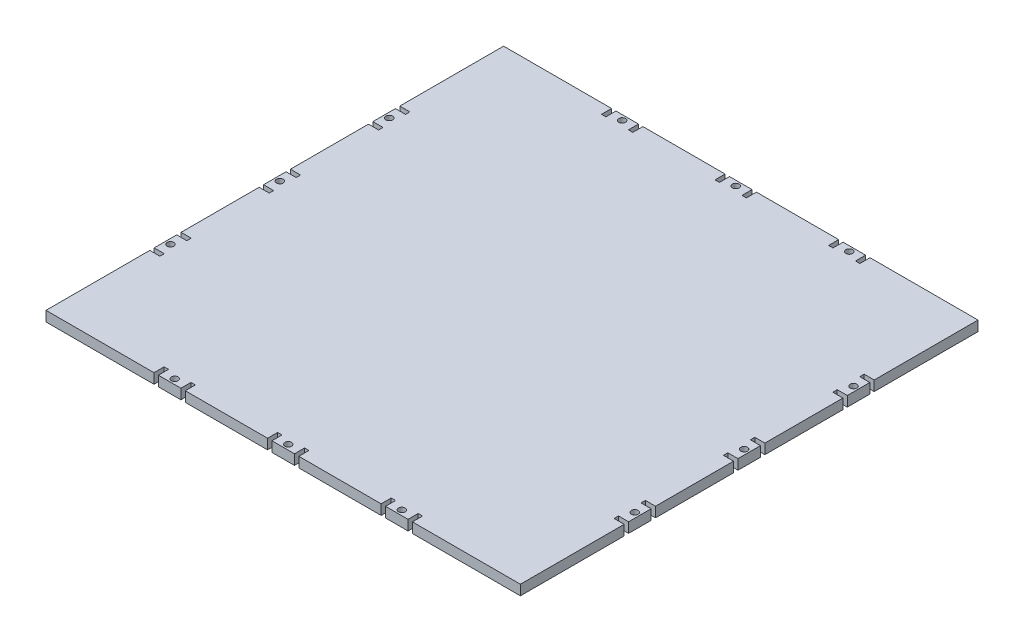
ISO-10303-21;
HEADER;
FILE_DESCRIPTION(('STEP AP214'),'2;1');
FILE_NAME('part.step','',(''),(''),'','','');
FILE_SCHEMA(('AUTOMOTIVE_DESIGN { 1 0 10303 214 1 1 1 1 }'));
ENDSEC;
DATA;
#1=APPLICATION_CONTEXT('core data for automotive mechanical design processes');
#2=APPLICATION_PROTOCOL_DEFINITION('international standard','automotive_design',2000,#1);
#3=PRODUCT_CONTEXT('',#1,'mechanical');
#4=PRODUCT('Part','Part','',(#3));
#5=PRODUCT_RELATED_PRODUCT_CATEGORY('part','',(#4));
#6=PRODUCT_DEFINITION_FORMATION('','',#4);
#7=PRODUCT_DEFINITION_CONTEXT('part definition',#1,'design');
#8=PRODUCT_DEFINITION('design','',#6,#7);
#9=PRODUCT_DEFINITION_SHAPE('','',#8);
#10=(LENGTH_UNIT() NAMED_UNIT(*) SI_UNIT(.MILLI.,.METRE.));
#11=(NAMED_UNIT(*) PLANE_ANGLE_UNIT() SI_UNIT($,.RADIAN.));
#12=(NAMED_UNIT(*) SI_UNIT($,.STERADIAN.) SOLID_ANGLE_UNIT());
#13=UNCERTAINTY_MEASURE_WITH_UNIT(LENGTH_MEASURE(1.E-05),#10,'distance_accuracy_value','');
#14=(GEOMETRIC_REPRESENTATION_CONTEXT(3) GLOBAL_UNCERTAINTY_ASSIGNED_CONTEXT((#13)) GLOBAL_UNIT_ASSIGNED_CONTEXT((#10,
#11,#12)) REPRESENTATION_CONTEXT('',''));
#15=CARTESIAN_POINT('',(0.,0.,0.));
#16=DIRECTION('',(0.,0.,1.));
#17=DIRECTION('',(1.,0.,0.));
#18=AXIS2_PLACEMENT_3D('',#15,#16,#17);
#19=CARTESIAN_POINT('',(-141.,6.,136.));
#20=DIRECTION('',(1.,0.,0.));
#21=DIRECTION('',(0.,0.,-1.));
#22=AXIS2_PLACEMENT_3D('',#19,#20,#21);
#23=PLANE('',#22);
#24=DIRECTION('',(0.,0.,1.));
#25=VECTOR('',#24,1.);
#26=CARTESIAN_POINT('',(-141.,6.,136.));
#27=LINE('',#26,#25);
#28=CARTESIAN_POINT('',(-140.999999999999,6.,9.29999999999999));
#29=VERTEX_POINT('',#28);
#30=CARTESIAN_POINT('',(-140.999999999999,6.,55.7));
#31=VERTEX_POINT('',#30);
#32=EDGE_CURVE('E1290',#29,#31,#27,.T.);
#33=ORIENTED_EDGE('',*,*,#32,.F.);
#34=DIRECTION('',(0.,1.,0.));
#35=VECTOR('',#34,1.);
#36=CARTESIAN_POINT('',(-140.999999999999,0.,9.29999999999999));
#37=LINE('',#36,#35);
#38=CARTESIAN_POINT('',(-140.999999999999,0.,9.29999999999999));
#39=VERTEX_POINT('',#38);
#40=EDGE_CURVE('E1076',#39,#29,#37,.T.);
#41=ORIENTED_EDGE('',*,*,#40,.F.);
#42=DIRECTION('',(0.,0.,1.));
#43=VECTOR('',#42,1.);
#44=CARTESIAN_POINT('',(-141.,0.,136.));
#45=LINE('',#44,#43);
#46=CARTESIAN_POINT('',(-140.999999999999,0.,55.7));
#47=VERTEX_POINT('',#46);
#48=EDGE_CURVE('E729',#39,#47,#45,.T.);
#49=ORIENTED_EDGE('',*,*,#48,.T.);
#50=DIRECTION('',(0.,1.,0.));
#51=VECTOR('',#50,1.);
#52=CARTESIAN_POINT('',(-140.999999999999,0.,55.7));
#53=LINE('',#52,#51);
#54=EDGE_CURVE('E1021',#47,#31,#53,.T.);
#55=ORIENTED_EDGE('',*,*,#54,.T.);
#56=EDGE_LOOP('',(#33,#41,#49,#55));
#57=FACE_BOUND('',#56,.T.);
#58=ADVANCED_FACE('F35',(#57),#23,.F.);
#59=CARTESIAN_POINT('',(-140.999999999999,0.,-6.7));
#60=VERTEX_POINT('',#59);
#61=CARTESIAN_POINT('',(-141.,0.,6.69999999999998));
#62=VERTEX_POINT('',#61);
#63=EDGE_CURVE('E2822',#60,#62,#45,.T.);
#64=ORIENTED_EDGE('',*,*,#63,.T.);
#65=DIRECTION('',(0.,1.,0.));
#66=VECTOR('',#65,1.);
#67=CARTESIAN_POINT('',(-140.999999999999,0.,6.7));
#68=LINE('',#67,#66);
#69=CARTESIAN_POINT('',(-140.999999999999,6.,6.7));
#70=VERTEX_POINT('',#69);
#71=EDGE_CURVE('E1078',#62,#70,#68,.T.);
#72=ORIENTED_EDGE('',*,*,#71,.T.);
#73=CARTESIAN_POINT('',(-140.999999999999,6.,-6.7));
#74=VERTEX_POINT('',#73);
#75=EDGE_CURVE('E1285',#74,#70,#27,.T.);
#76=ORIENTED_EDGE('',*,*,#75,.F.);
#77=DIRECTION('',(0.,1.,0.));
#78=VECTOR('',#77,1.);
#79=CARTESIAN_POINT('',(-140.999999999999,0.,-6.7));
#80=LINE('',#79,#78);
#81=EDGE_CURVE('E986',#60,#74,#80,.T.);
#82=ORIENTED_EDGE('',*,*,#81,.F.);
#83=EDGE_LOOP('',(#64,#72,#76,#82));
#84=FACE_BOUND('',#83,.T.);
#85=ADVANCED_FACE('F1696',(#84),#23,.F.);
#86=CARTESIAN_POINT('',(-140.999999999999,6.,74.3));
#87=VERTEX_POINT('',#86);
#88=CARTESIAN_POINT('',(-141.,6.,136.));
#89=VERTEX_POINT('',#88);
#90=EDGE_CURVE('E747',#87,#89,#27,.T.);
#91=ORIENTED_EDGE('',*,*,#90,.F.);
#92=DIRECTION('',(0.,1.,0.));
#93=VECTOR('',#92,1.);
#94=CARTESIAN_POINT('',(-140.999999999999,0.,74.3));
#95=LINE('',#94,#93);
#96=CARTESIAN_POINT('',(-140.999999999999,0.,74.3));
#97=VERTEX_POINT('',#96);
#98=EDGE_CURVE('E1050',#97,#87,#95,.T.);
#99=ORIENTED_EDGE('',*,*,#98,.F.);
#100=CARTESIAN_POINT('',(-141.,0.,136.));
#101=VERTEX_POINT('',#100);
#102=EDGE_CURVE('E714',#97,#101,#45,.T.);
#103=ORIENTED_EDGE('',*,*,#102,.T.);
#104=DIRECTION('',(0.,-1.,0.));
#105=VECTOR('',#104,1.);
#106=CARTESIAN_POINT('',(-141.,6.,136.));
#107=LINE('',#106,#105);
#108=EDGE_CURVE('E11',#89,#101,#107,.T.);
#109=ORIENTED_EDGE('',*,*,#108,.F.);
#110=EDGE_LOOP('',(#91,#99,#103,#109));
#111=FACE_BOUND('',#110,.T.);
#112=ADVANCED_FACE('F1701',(#111),#23,.F.);
#113=CARTESIAN_POINT('',(-141.,0.,-55.7));
#114=VERTEX_POINT('',#113);
#115=CARTESIAN_POINT('',(-140.999999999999,0.,-9.29999999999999));
#116=VERTEX_POINT('',#115);
#117=EDGE_CURVE('E720',#114,#116,#45,.T.);
#118=ORIENTED_EDGE('',*,*,#117,.T.);
#119=DIRECTION('',(0.,1.,0.));
#120=VECTOR('',#119,1.);
#121=CARTESIAN_POINT('',(-140.999999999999,0.,-9.29999999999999));
#122=LINE('',#121,#120);
#123=CARTESIAN_POINT('',(-140.999999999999,6.,-9.29999999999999));
#124=VERTEX_POINT('',#123);
#125=EDGE_CURVE('E975',#116,#124,#122,.T.);
#126=ORIENTED_EDGE('',*,*,#125,.T.);
#127=CARTESIAN_POINT('',(-141.,6.,-55.7));
#128=VERTEX_POINT('',#127);
#129=EDGE_CURVE('E1283',#128,#124,#27,.T.);
#130=ORIENTED_EDGE('',*,*,#129,.F.);
#131=DIRECTION('',(0.,1.,0.));
#132=VECTOR('',#131,1.);
#133=CARTESIAN_POINT('',(-141.,0.,-55.7));
#134=LINE('',#133,#132);
#135=EDGE_CURVE('E964',#114,#128,#134,.T.);
#136=ORIENTED_EDGE('',*,*,#135,.F.);
#137=EDGE_LOOP('',(#118,#126,#130,#136));
#138=FACE_BOUND('',#137,.T.);
#139=ADVANCED_FACE('F1721',(#138),#23,.F.);
#140=CARTESIAN_POINT('',(-140.999999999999,6.,58.3));
#141=VERTEX_POINT('',#140);
#142=CARTESIAN_POINT('',(-140.999999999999,6.,71.7));
#143=VERTEX_POINT('',#142);
#144=EDGE_CURVE('E1295',#141,#143,#27,.T.);
#145=ORIENTED_EDGE('',*,*,#144,.F.);
#146=DIRECTION('',(0.,1.,0.));
#147=VECTOR('',#146,1.);
#148=CARTESIAN_POINT('',(-140.999999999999,0.,58.3));
#149=LINE('',#148,#147);
#150=CARTESIAN_POINT('',(-140.999999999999,0.,58.3));
#151=VERTEX_POINT('',#150);
#152=EDGE_CURVE('E1012',#151,#141,#149,.T.);
#153=ORIENTED_EDGE('',*,*,#152,.F.);
#154=CARTESIAN_POINT('',(-141.,0.,71.7));
#155=VERTEX_POINT('',#154);
#156=EDGE_CURVE('E722',#151,#155,#45,.T.);
#157=ORIENTED_EDGE('',*,*,#156,.T.);
#158=DIRECTION('',(0.,1.,0.));
#159=VECTOR('',#158,1.);
#160=CARTESIAN_POINT('',(-140.999999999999,0.,71.7));
#161=LINE('',#160,#159);
#162=EDGE_CURVE('E1052',#155,#143,#161,.T.);
#163=ORIENTED_EDGE('',*,*,#162,.T.);
#164=EDGE_LOOP('',(#145,#153,#157,#163));
#165=FACE_BOUND('',#164,.T.);
#166=ADVANCED_FACE('F1714',(#165),#23,.F.);
#167=CARTESIAN_POINT('',(-141.,0.,-136.));
#168=VERTEX_POINT('',#167);
#169=CARTESIAN_POINT('',(-141.,0.,-74.3));
#170=VERTEX_POINT('',#169);
#171=EDGE_CURVE('E707',#168,#170,#45,.T.);
#172=ORIENTED_EDGE('',*,*,#171,.T.);
#173=DIRECTION('',(0.,1.,0.));
#174=VECTOR('',#173,1.);
#175=CARTESIAN_POINT('',(-141.,0.,-74.3));
#176=LINE('',#175,#174);
#177=CARTESIAN_POINT('',(-141.,6.,-74.3));
#178=VERTEX_POINT('',#177);
#179=EDGE_CURVE('E736',#170,#178,#176,.T.);
#180=ORIENTED_EDGE('',*,*,#179,.T.);
#181=CARTESIAN_POINT('',(-141.,6.,-136.));
#182=VERTEX_POINT('',#181);
#183=EDGE_CURVE('E742',#182,#178,#27,.T.);
#184=ORIENTED_EDGE('',*,*,#183,.F.);
#185=DIRECTION('',(0.,-1.,0.));
#186=VECTOR('',#185,1.);
#187=CARTESIAN_POINT('',(-141.,6.,-136.));
#188=LINE('',#187,#186);
#189=EDGE_CURVE('E758',#182,#168,#188,.T.);
#190=ORIENTED_EDGE('',*,*,#189,.T.);
#191=EDGE_LOOP('',(#172,#180,#184,#190));
#192=FACE_BOUND('',#191,.T.);
#193=ADVANCED_FACE('F1265',(#192),#23,.F.);
#194=CARTESIAN_POINT('',(141.,6.,136.));
#195=DIRECTION('',(0.,0.,-1.));
#196=DIRECTION('',(-1.,0.,0.));
#197=AXIS2_PLACEMENT_3D('',#194,#195,#196);
#198=PLANE('',#197);
#199=DIRECTION('',(1.,0.,0.));
#200=VECTOR('',#199,1.);
#201=CARTESIAN_POINT('',(141.,0.,136.));
#202=LINE('',#201,#200);
#203=CARTESIAN_POINT('',(9.29999999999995,0.,136.));
#204=VERTEX_POINT('',#203);
#205=CARTESIAN_POINT('',(58.2,0.,136.));
#206=VERTEX_POINT('',#205);
#207=EDGE_CURVE('E711',#204,#206,#202,.T.);
#208=ORIENTED_EDGE('',*,*,#207,.T.);
#209=DIRECTION('',(0.,1.,0.));
#210=VECTOR('',#209,1.);
#211=CARTESIAN_POINT('',(58.2,0.,136.));
#212=LINE('',#211,#210);
#213=CARTESIAN_POINT('',(58.2,6.,136.));
#214=VERTEX_POINT('',#213);
#215=EDGE_CURVE('E1355',#206,#214,#212,.T.);
#216=ORIENTED_EDGE('',*,*,#215,.T.);
#217=DIRECTION('',(1.,0.,0.));
#218=VECTOR('',#217,1.);
#219=CARTESIAN_POINT('',(141.,6.,136.));
#220=LINE('',#219,#218);
#221=CARTESIAN_POINT('',(9.29999999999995,6.,136.));
#222=VERTEX_POINT('',#221);
#223=EDGE_CURVE('E1759',#222,#214,#220,.T.);
#224=ORIENTED_EDGE('',*,*,#223,.F.);
#225=DIRECTION('',(0.,1.,0.));
#226=VECTOR('',#225,1.);
#227=CARTESIAN_POINT('',(9.29999999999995,0.,136.));
#228=LINE('',#227,#226);
#229=EDGE_CURVE('E880',#204,#222,#228,.T.);
#230=ORIENTED_EDGE('',*,*,#229,.F.);
#231=EDGE_LOOP('',(#208,#216,#224,#230));
#232=FACE_BOUND('',#231,.T.);
#233=ADVANCED_FACE('F1710',(#232),#198,.F.);
#234=CARTESIAN_POINT('',(-76.8,0.,136.));
#235=VERTEX_POINT('',#234);
#236=EDGE_CURVE('E689',#101,#235,#202,.T.);
#237=ORIENTED_EDGE('',*,*,#236,.T.);
#238=DIRECTION('',(0.,1.,0.));
#239=VECTOR('',#238,1.);
#240=CARTESIAN_POINT('',(-76.8,0.,136.));
#241=LINE('',#240,#239);
#242=CARTESIAN_POINT('',(-76.8,6.,136.));
#243=VERTEX_POINT('',#242);
#244=EDGE_CURVE('E904',#235,#243,#241,.T.);
#245=ORIENTED_EDGE('',*,*,#244,.T.);
#246=EDGE_CURVE('E748',#89,#243,#220,.T.);
#247=ORIENTED_EDGE('',*,*,#246,.F.);
#248=ORIENTED_EDGE('',*,*,#108,.T.);
#249=EDGE_LOOP('',(#237,#245,#247,#248));
#250=FACE_BOUND('',#249,.T.);
#251=ADVANCED_FACE('F1719',(#250),#198,.F.);
#252=CARTESIAN_POINT('',(-6.70000000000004,0.,136.));
#253=VERTEX_POINT('',#252);
#254=CARTESIAN_POINT('',(6.69999999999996,0.,136.));
#255=VERTEX_POINT('',#254);
#256=EDGE_CURVE('E2770',#253,#255,#202,.T.);
#257=ORIENTED_EDGE('',*,*,#256,.T.);
#258=DIRECTION('',(0.,1.,0.));
#259=VECTOR('',#258,1.);
#260=CARTESIAN_POINT('',(6.69999999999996,0.,136.));
#261=LINE('',#260,#259);
#262=CARTESIAN_POINT('',(6.69999999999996,6.,136.));
#263=VERTEX_POINT('',#262);
#264=EDGE_CURVE('E857',#255,#263,#261,.T.);
#265=ORIENTED_EDGE('',*,*,#264,.T.);
#266=CARTESIAN_POINT('',(-6.70000000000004,6.,136.));
#267=VERTEX_POINT('',#266);
#268=EDGE_CURVE('E1754',#267,#263,#220,.T.);
#269=ORIENTED_EDGE('',*,*,#268,.F.);
#270=DIRECTION('',(0.,1.,0.));
#271=VECTOR('',#270,1.);
#272=CARTESIAN_POINT('',(-6.70000000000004,0.,136.));
#273=LINE('',#272,#271);
#274=EDGE_CURVE('E1442',#253,#267,#273,.T.);
#275=ORIENTED_EDGE('',*,*,#274,.F.);
#276=EDGE_LOOP('',(#257,#265,#269,#275));
#277=FACE_BOUND('',#276,.T.);
#278=ADVANCED_FACE('F1781',(#277),#198,.F.);
#279=CARTESIAN_POINT('',(-58.2000000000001,0.,136.));
#280=VERTEX_POINT('',#279);
#281=CARTESIAN_POINT('',(-9.30000000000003,0.,136.));
#282=VERTEX_POINT('',#281);
#283=EDGE_CURVE('E704',#280,#282,#202,.T.);
#284=ORIENTED_EDGE('',*,*,#283,.T.);
#285=DIRECTION('',(0.,1.,0.));
#286=VECTOR('',#285,1.);
#287=CARTESIAN_POINT('',(-9.30000000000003,0.,136.));
#288=LINE('',#287,#286);
#289=CARTESIAN_POINT('',(-9.30000000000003,6.,136.));
#290=VERTEX_POINT('',#289);
#291=EDGE_CURVE('E1439',#282,#290,#288,.T.);
#292=ORIENTED_EDGE('',*,*,#291,.T.);
#293=CARTESIAN_POINT('',(-58.2000000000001,6.,136.));
#294=VERTEX_POINT('',#293);
#295=EDGE_CURVE('E1752',#294,#290,#220,.T.);
#296=ORIENTED_EDGE('',*,*,#295,.F.);
#297=DIRECTION('',(0.,1.,0.));
#298=VECTOR('',#297,1.);
#299=CARTESIAN_POINT('',(-58.2000000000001,0.,136.));
#300=LINE('',#299,#298);
#301=EDGE_CURVE('E1154',#280,#294,#300,.T.);
#302=ORIENTED_EDGE('',*,*,#301,.F.);
#303=EDGE_LOOP('',(#284,#292,#296,#302));
#304=FACE_BOUND('',#303,.T.);
#305=ADVANCED_FACE('F1776',(#304),#198,.F.);
#306=CARTESIAN_POINT('',(76.8,6.,136.));
#307=VERTEX_POINT('',#306);
#308=CARTESIAN_POINT('',(141.,6.,136.));
#309=VERTEX_POINT('',#308);
#310=EDGE_CURVE('E745',#307,#309,#220,.T.);
#311=ORIENTED_EDGE('',*,*,#310,.F.);
#312=DIRECTION('',(0.,1.,0.));
#313=VECTOR('',#312,1.);
#314=CARTESIAN_POINT('',(76.8,0.,136.));
#315=LINE('',#314,#313);
#316=CARTESIAN_POINT('',(76.8,0.,136.));
#317=VERTEX_POINT('',#316);
#318=EDGE_CURVE('E1471',#317,#307,#315,.T.);
#319=ORIENTED_EDGE('',*,*,#318,.F.);
#320=CARTESIAN_POINT('',(141.,0.,136.));
#321=VERTEX_POINT('',#320);
#322=EDGE_CURVE('E699',#317,#321,#202,.T.);
#323=ORIENTED_EDGE('',*,*,#322,.T.);
#324=DIRECTION('',(0.,-1.,0.));
#325=VECTOR('',#324,1.);
#326=CARTESIAN_POINT('',(141.,6.,136.));
#327=LINE('',#326,#325);
#328=EDGE_CURVE('E43',#309,#321,#327,.T.);
#329=ORIENTED_EDGE('',*,*,#328,.F.);
#330=EDGE_LOOP('',(#311,#319,#323,#329));
#331=FACE_BOUND('',#330,.T.);
#332=ADVANCED_FACE('F1774',(#331),#198,.F.);
#333=CARTESIAN_POINT('',(-74.2,6.,136.));
#334=VERTEX_POINT('',#333);
#335=CARTESIAN_POINT('',(-60.8,6.,136.));
#336=VERTEX_POINT('',#335);
#337=EDGE_CURVE('E752',#334,#336,#220,.T.);
#338=ORIENTED_EDGE('',*,*,#337,.F.);
#339=DIRECTION('',(0.,1.,0.));
#340=VECTOR('',#339,1.);
#341=CARTESIAN_POINT('',(-74.2,0.,136.));
#342=LINE('',#341,#340);
#343=CARTESIAN_POINT('',(-74.2,0.,136.));
#344=VERTEX_POINT('',#343);
#345=EDGE_CURVE('E916',#344,#334,#342,.T.);
#346=ORIENTED_EDGE('',*,*,#345,.F.);
#347=CARTESIAN_POINT('',(-60.8,0.,136.));
#348=VERTEX_POINT('',#347);
#349=EDGE_CURVE('E698',#344,#348,#202,.T.);
#350=ORIENTED_EDGE('',*,*,#349,.T.);
#351=DIRECTION('',(0.,1.,0.));
#352=VECTOR('',#351,1.);
#353=CARTESIAN_POINT('',(-60.8,0.,136.));
#354=LINE('',#353,#352);
#355=EDGE_CURVE('E1132',#348,#336,#354,.T.);
#356=ORIENTED_EDGE('',*,*,#355,.T.);
#357=EDGE_LOOP('',(#338,#346,#350,#356));
#358=FACE_BOUND('',#357,.T.);
#359=ADVANCED_FACE('F1711',(#358),#198,.F.);
#360=CARTESIAN_POINT('',(141.,6.,136.));
#361=DIRECTION('',(-1.,0.,0.));
#362=DIRECTION('',(0.,0.,1.));
#363=AXIS2_PLACEMENT_3D('',#360,#361,#362);
#364=PLANE('',#363);
#365=DIRECTION('',(0.,0.,-1.));
#366=VECTOR('',#365,1.);
#367=CARTESIAN_POINT('',(141.,6.,136.));
#368=LINE('',#367,#366);
#369=CARTESIAN_POINT('',(141.,6.,-74.3));
#370=VERTEX_POINT('',#369);
#371=CARTESIAN_POINT('',(141.,6.,-136.));
#372=VERTEX_POINT('',#371);
#373=EDGE_CURVE('E751',#370,#372,#368,.T.);
#374=ORIENTED_EDGE('',*,*,#373,.F.);
#375=DIRECTION('',(0.,1.,0.));
#376=VECTOR('',#375,1.);
#377=CARTESIAN_POINT('',(141.,0.,-74.3));
#378=LINE('',#377,#376);
#379=CARTESIAN_POINT('',(141.,0.,-74.3));
#380=VERTEX_POINT('',#379);
#381=EDGE_CURVE('E1503',#380,#370,#378,.T.);
#382=ORIENTED_EDGE('',*,*,#381,.F.);
#383=DIRECTION('',(0.,0.,-1.));
#384=VECTOR('',#383,1.);
#385=CARTESIAN_POINT('',(141.,0.,136.));
#386=LINE('',#385,#384);
#387=CARTESIAN_POINT('',(141.,0.,-136.));
#388=VERTEX_POINT('',#387);
#389=EDGE_CURVE('E681',#380,#388,#386,.T.);
#390=ORIENTED_EDGE('',*,*,#389,.T.);
#391=DIRECTION('',(0.,-1.,0.));
#392=VECTOR('',#391,1.);
#393=CARTESIAN_POINT('',(141.,6.,-136.));
#394=LINE('',#393,#392);
#395=EDGE_CURVE('E763',#372,#388,#394,.T.);
#396=ORIENTED_EDGE('',*,*,#395,.F.);
#397=EDGE_LOOP('',(#374,#382,#390,#396));
#398=FACE_BOUND('',#397,.T.);
#399=ADVANCED_FACE('F1628',(#398),#364,.F.);
#400=CARTESIAN_POINT('',(140.999999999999,6.,-9.29999999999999));
#401=VERTEX_POINT('',#400);
#402=CARTESIAN_POINT('',(141.,6.,-55.7));
#403=VERTEX_POINT('',#402);
#404=EDGE_CURVE('E1613',#401,#403,#368,.T.);
#405=ORIENTED_EDGE('',*,*,#404,.F.);
#406=DIRECTION('',(0.,1.,0.));
#407=VECTOR('',#406,1.);
#408=CARTESIAN_POINT('',(140.999999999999,0.,-9.29999999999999));
#409=LINE('',#408,#407);
#410=CARTESIAN_POINT('',(140.999999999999,0.,-9.29999999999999));
#411=VERTEX_POINT('',#410);
#412=EDGE_CURVE('E1391',#411,#401,#409,.T.);
#413=ORIENTED_EDGE('',*,*,#412,.F.);
#414=CARTESIAN_POINT('',(141.,0.,-55.7));
#415=VERTEX_POINT('',#414);
#416=EDGE_CURVE('E696',#411,#415,#386,.T.);
#417=ORIENTED_EDGE('',*,*,#416,.T.);
#418=DIRECTION('',(0.,1.,0.));
#419=VECTOR('',#418,1.);
#420=CARTESIAN_POINT('',(141.,0.,-55.7));
#421=LINE('',#420,#419);
#422=EDGE_CURVE('E1532',#415,#403,#421,.T.);
#423=ORIENTED_EDGE('',*,*,#422,.T.);
#424=EDGE_LOOP('',(#405,#413,#417,#423));
#425=FACE_BOUND('',#424,.T.);
#426=ADVANCED_FACE('F1654',(#425),#364,.F.);
#427=CARTESIAN_POINT('',(140.999999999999,6.,55.7));
#428=VERTEX_POINT('',#427);
#429=CARTESIAN_POINT('',(140.999999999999,6.,9.29999999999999));
#430=VERTEX_POINT('',#429);
#431=EDGE_CURVE('E1606',#428,#430,#368,.T.);
#432=ORIENTED_EDGE('',*,*,#431,.F.);
#433=DIRECTION('',(0.,1.,0.));
#434=VECTOR('',#433,1.);
#435=CARTESIAN_POINT('',(140.999999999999,0.,55.7));
#436=LINE('',#435,#434);
#437=CARTESIAN_POINT('',(140.999999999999,0.,55.7));
#438=VERTEX_POINT('',#437);
#439=EDGE_CURVE('E1419',#438,#428,#436,.T.);
#440=ORIENTED_EDGE('',*,*,#439,.F.);
#441=CARTESIAN_POINT('',(140.999999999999,0.,9.29999999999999));
#442=VERTEX_POINT('',#441);
#443=EDGE_CURVE('E686',#438,#442,#386,.T.);
#444=ORIENTED_EDGE('',*,*,#443,.T.);
#445=DIRECTION('',(0.,1.,0.));
#446=VECTOR('',#445,1.);
#447=CARTESIAN_POINT('',(140.999999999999,0.,9.29999999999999));
#448=LINE('',#447,#446);
#449=EDGE_CURVE('E1559',#442,#430,#448,.T.);
#450=ORIENTED_EDGE('',*,*,#449,.T.);
#451=EDGE_LOOP('',(#432,#440,#444,#450));
#452=FACE_BOUND('',#451,.T.);
#453=ADVANCED_FACE('F1664',(#452),#364,.F.);
#454=CARTESIAN_POINT('',(140.999999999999,0.,74.3));
#455=VERTEX_POINT('',#454);
#456=EDGE_CURVE('E670',#321,#455,#386,.T.);
#457=ORIENTED_EDGE('',*,*,#456,.T.);
#458=DIRECTION('',(0.,1.,0.));
#459=VECTOR('',#458,1.);
#460=CARTESIAN_POINT('',(140.999999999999,0.,74.3));
#461=LINE('',#460,#459);
#462=CARTESIAN_POINT('',(140.999999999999,6.,74.3));
#463=VERTEX_POINT('',#462);
#464=EDGE_CURVE('E652',#455,#463,#461,.T.);
#465=ORIENTED_EDGE('',*,*,#464,.T.);
#466=EDGE_CURVE('E753',#309,#463,#368,.T.);
#467=ORIENTED_EDGE('',*,*,#466,.F.);
#468=ORIENTED_EDGE('',*,*,#328,.T.);
#469=EDGE_LOOP('',(#457,#465,#467,#468));
#470=FACE_BOUND('',#469,.T.);
#471=ADVANCED_FACE('F676',(#470),#364,.F.);
#472=CARTESIAN_POINT('',(140.999999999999,0.,71.7));
#473=VERTEX_POINT('',#472);
#474=CARTESIAN_POINT('',(141.,0.,58.3));
#475=VERTEX_POINT('',#474);
#476=EDGE_CURVE('E679',#473,#475,#386,.T.);
#477=ORIENTED_EDGE('',*,*,#476,.T.);
#478=DIRECTION('',(0.,1.,0.));
#479=VECTOR('',#478,1.);
#480=CARTESIAN_POINT('',(140.999999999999,0.,58.3));
#481=LINE('',#480,#479);
#482=CARTESIAN_POINT('',(140.999999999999,6.,58.3));
#483=VERTEX_POINT('',#482);
#484=EDGE_CURVE('E1415',#475,#483,#481,.T.);
#485=ORIENTED_EDGE('',*,*,#484,.T.);
#486=CARTESIAN_POINT('',(140.999999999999,6.,71.7));
#487=VERTEX_POINT('',#486);
#488=EDGE_CURVE('E755',#487,#483,#368,.T.);
#489=ORIENTED_EDGE('',*,*,#488,.F.);
#490=DIRECTION('',(0.,1.,0.));
#491=VECTOR('',#490,1.);
#492=CARTESIAN_POINT('',(140.999999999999,0.,71.7));
#493=LINE('',#492,#491);
#494=EDGE_CURVE('E663',#473,#487,#493,.T.);
#495=ORIENTED_EDGE('',*,*,#494,.F.);
#496=EDGE_LOOP('',(#477,#485,#489,#495));
#497=FACE_BOUND('',#496,.T.);
#498=ADVANCED_FACE('F1603',(#497),#364,.F.);
#499=CARTESIAN_POINT('',(140.999999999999,0.,6.7));
#500=VERTEX_POINT('',#499);
#501=CARTESIAN_POINT('',(141.,0.,-6.69999999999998));
#502=VERTEX_POINT('',#501);
#503=EDGE_CURVE('E1655',#500,#502,#386,.T.);
#504=ORIENTED_EDGE('',*,*,#503,.T.);
#505=DIRECTION('',(0.,1.,0.));
#506=VECTOR('',#505,1.);
#507=CARTESIAN_POINT('',(140.999999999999,0.,-6.7));
#508=LINE('',#507,#506);
#509=CARTESIAN_POINT('',(140.999999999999,6.,-6.7));
#510=VERTEX_POINT('',#509);
#511=EDGE_CURVE('E1387',#502,#510,#508,.T.);
#512=ORIENTED_EDGE('',*,*,#511,.T.);
#513=CARTESIAN_POINT('',(140.999999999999,6.,6.7));
#514=VERTEX_POINT('',#513);
#515=EDGE_CURVE('E1608',#514,#510,#368,.T.);
#516=ORIENTED_EDGE('',*,*,#515,.F.);
#517=DIRECTION('',(0.,1.,0.));
#518=VECTOR('',#517,1.);
#519=CARTESIAN_POINT('',(140.999999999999,0.,6.7));
#520=LINE('',#519,#518);
#521=EDGE_CURVE('E1562',#500,#514,#520,.T.);
#522=ORIENTED_EDGE('',*,*,#521,.F.);
#523=EDGE_LOOP('',(#504,#512,#516,#522));
#524=FACE_BOUND('',#523,.T.);
#525=ADVANCED_FACE('F1674',(#524),#364,.F.);
#526=CARTESIAN_POINT('',(141.,6.,-136.));
#527=DIRECTION('',(0.,0.,1.));
#528=DIRECTION('',(1.,0.,0.));
#529=AXIS2_PLACEMENT_3D('',#526,#527,#528);
#530=PLANE('',#529);
#531=DIRECTION('',(-1.,0.,0.));
#532=VECTOR('',#531,1.);
#533=CARTESIAN_POINT('',(141.,0.,-136.));
#534=LINE('',#533,#532);
#535=CARTESIAN_POINT('',(76.8,0.,-136.));
#536=VERTEX_POINT('',#535);
#537=EDGE_CURVE('E684',#388,#536,#534,.T.);
#538=ORIENTED_EDGE('',*,*,#537,.T.);
#539=DIRECTION('',(0.,1.,0.));
#540=VECTOR('',#539,1.);
#541=CARTESIAN_POINT('',(76.8,0.,-136.));
#542=LINE('',#541,#540);
#543=CARTESIAN_POINT('',(76.8,6.,-136.));
#544=VERTEX_POINT('',#543);
#545=EDGE_CURVE('E853',#536,#544,#542,.T.);
#546=ORIENTED_EDGE('',*,*,#545,.T.);
#547=DIRECTION('',(-1.,0.,0.));
#548=VECTOR('',#547,1.);
#549=CARTESIAN_POINT('',(141.,6.,-136.));
#550=LINE('',#549,#548);
#551=EDGE_CURVE('E756',#372,#544,#550,.T.);
#552=ORIENTED_EDGE('',*,*,#551,.F.);
#553=ORIENTED_EDGE('',*,*,#395,.T.);
#554=EDGE_LOOP('',(#538,#546,#552,#553));
#555=FACE_BOUND('',#554,.T.);
#556=ADVANCED_FACE('F1311',(#555),#530,.F.);
#557=CARTESIAN_POINT('',(74.2,6.,-136.));
#558=VERTEX_POINT('',#557);
#559=CARTESIAN_POINT('',(60.8,6.,-136.));
#560=VERTEX_POINT('',#559);
#561=EDGE_CURVE('E759',#558,#560,#550,.T.);
#562=ORIENTED_EDGE('',*,*,#561,.F.);
#563=DIRECTION('',(0.,1.,0.));
#564=VECTOR('',#563,1.);
#565=CARTESIAN_POINT('',(74.2,0.,-136.));
#566=LINE('',#565,#564);
#567=CARTESIAN_POINT('',(74.2,0.,-136.));
#568=VERTEX_POINT('',#567);
#569=EDGE_CURVE('E866',#568,#558,#566,.T.);
#570=ORIENTED_EDGE('',*,*,#569,.F.);
#571=CARTESIAN_POINT('',(60.8,0.,-136.));
#572=VERTEX_POINT('',#571);
#573=EDGE_CURVE('E1307',#568,#572,#534,.T.);
#574=ORIENTED_EDGE('',*,*,#573,.T.);
#575=DIRECTION('',(0.,1.,0.));
#576=VECTOR('',#575,1.);
#577=CARTESIAN_POINT('',(60.8,0.,-136.));
#578=LINE('',#577,#576);
#579=EDGE_CURVE('E825',#572,#560,#578,.T.);
#580=ORIENTED_EDGE('',*,*,#579,.T.);
#581=EDGE_LOOP('',(#562,#570,#574,#580));
#582=FACE_BOUND('',#581,.T.);
#583=ADVANCED_FACE('F1326',(#582),#530,.F.);
#584=CARTESIAN_POINT('',(58.2,6.,-136.));
#585=VERTEX_POINT('',#584);
#586=CARTESIAN_POINT('',(9.29999999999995,6.,-136.));
#587=VERTEX_POINT('',#586);
#588=EDGE_CURVE('E766',#585,#587,#550,.T.);
#589=ORIENTED_EDGE('',*,*,#588,.F.);
#590=DIRECTION('',(0.,1.,0.));
#591=VECTOR('',#590,1.);
#592=CARTESIAN_POINT('',(58.2,0.,-136.));
#593=LINE('',#592,#591);
#594=CARTESIAN_POINT('',(58.2,0.,-136.));
#595=VERTEX_POINT('',#594);
#596=EDGE_CURVE('E802',#595,#585,#593,.T.);
#597=ORIENTED_EDGE('',*,*,#596,.F.);
#598=CARTESIAN_POINT('',(9.29999999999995,0.,-136.));
#599=VERTEX_POINT('',#598);
#600=EDGE_CURVE('E805',#595,#599,#534,.T.);
#601=ORIENTED_EDGE('',*,*,#600,.T.);
#602=DIRECTION('',(0.,1.,0.));
#603=VECTOR('',#602,1.);
#604=CARTESIAN_POINT('',(9.29999999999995,0.,-136.));
#605=LINE('',#604,#603);
#606=EDGE_CURVE('E804',#599,#587,#605,.T.);
#607=ORIENTED_EDGE('',*,*,#606,.T.);
#608=EDGE_LOOP('',(#589,#597,#601,#607));
#609=FACE_BOUND('',#608,.T.);
#610=ADVANCED_FACE('F800',(#609),#530,.F.);
#611=CARTESIAN_POINT('',(6.69999999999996,6.,-136.));
#612=VERTEX_POINT('',#611);
#613=CARTESIAN_POINT('',(-6.70000000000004,6.,-136.));
#614=VERTEX_POINT('',#613);
#615=EDGE_CURVE('E777',#612,#614,#550,.T.);
#616=ORIENTED_EDGE('',*,*,#615,.F.);
#617=DIRECTION('',(0.,1.,0.));
#618=VECTOR('',#617,1.);
#619=CARTESIAN_POINT('',(6.69999999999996,0.,-136.));
#620=LINE('',#619,#618);
#621=CARTESIAN_POINT('',(6.69999999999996,0.,-136.));
#622=VERTEX_POINT('',#621);
#623=EDGE_CURVE('E809',#622,#612,#620,.T.);
#624=ORIENTED_EDGE('',*,*,#623,.F.);
#625=CARTESIAN_POINT('',(-6.70000000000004,0.,-136.));
#626=VERTEX_POINT('',#625);
#627=EDGE_CURVE('E1221',#622,#626,#534,.T.);
#628=ORIENTED_EDGE('',*,*,#627,.T.);
#629=DIRECTION('',(0.,1.,0.));
#630=VECTOR('',#629,1.);
#631=CARTESIAN_POINT('',(-6.70000000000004,0.,-136.));
#632=LINE('',#631,#630);
#633=EDGE_CURVE('E1175',#626,#614,#632,.T.);
#634=ORIENTED_EDGE('',*,*,#633,.T.);
#635=EDGE_LOOP('',(#616,#624,#628,#634));
#636=FACE_BOUND('',#635,.T.);
#637=ADVANCED_FACE('F1218',(#636),#530,.F.);
#638=CARTESIAN_POINT('',(-9.30000000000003,6.,-136.));
#639=VERTEX_POINT('',#638);
#640=CARTESIAN_POINT('',(-58.2000000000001,6.,-136.));
#641=VERTEX_POINT('',#640);
#642=EDGE_CURVE('E772',#639,#641,#550,.T.);
#643=ORIENTED_EDGE('',*,*,#642,.F.);
#644=DIRECTION('',(0.,1.,0.));
#645=VECTOR('',#644,1.);
#646=CARTESIAN_POINT('',(-9.30000000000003,0.,-136.));
#647=LINE('',#646,#645);
#648=CARTESIAN_POINT('',(-9.30000000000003,0.,-136.));
#649=VERTEX_POINT('',#648);
#650=EDGE_CURVE('E1186',#649,#639,#647,.T.);
#651=ORIENTED_EDGE('',*,*,#650,.F.);
#652=CARTESIAN_POINT('',(-58.2000000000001,0.,-136.));
#653=VERTEX_POINT('',#652);
#654=EDGE_CURVE('E1236',#649,#653,#534,.T.);
#655=ORIENTED_EDGE('',*,*,#654,.T.);
#656=DIRECTION('',(0.,1.,0.));
#657=VECTOR('',#656,1.);
#658=CARTESIAN_POINT('',(-58.2000000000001,0.,-136.));
#659=LINE('',#658,#657);
#660=EDGE_CURVE('E1128',#653,#641,#659,.T.);
#661=ORIENTED_EDGE('',*,*,#660,.T.);
#662=EDGE_LOOP('',(#643,#651,#655,#661));
#663=FACE_BOUND('',#662,.T.);
#664=ADVANCED_FACE('F1234',(#663),#530,.F.);
#665=CARTESIAN_POINT('',(-60.8,6.,-136.));
#666=VERTEX_POINT('',#665);
#667=CARTESIAN_POINT('',(-74.2,6.,-136.));
#668=VERTEX_POINT('',#667);
#669=EDGE_CURVE('E767',#666,#668,#550,.T.);
#670=ORIENTED_EDGE('',*,*,#669,.F.);
#671=DIRECTION('',(0.,1.,0.));
#672=VECTOR('',#671,1.);
#673=CARTESIAN_POINT('',(-60.8,0.,-136.));
#674=LINE('',#673,#672);
#675=CARTESIAN_POINT('',(-60.8,0.,-136.));
#676=VERTEX_POINT('',#675);
#677=EDGE_CURVE('E1140',#676,#666,#674,.T.);
#678=ORIENTED_EDGE('',*,*,#677,.F.);
#679=CARTESIAN_POINT('',(-74.2,0.,-136.));
#680=VERTEX_POINT('',#679);
#681=EDGE_CURVE('E682',#676,#680,#534,.T.);
#682=ORIENTED_EDGE('',*,*,#681,.T.);
#683=DIRECTION('',(0.,1.,0.));
#684=VECTOR('',#683,1.);
#685=CARTESIAN_POINT('',(-74.2,0.,-136.));
#686=LINE('',#685,#684);
#687=EDGE_CURVE('E1102',#680,#668,#686,.T.);
#688=ORIENTED_EDGE('',*,*,#687,.T.);
#689=EDGE_LOOP('',(#670,#678,#682,#688));
#690=FACE_BOUND('',#689,.T.);
#691=ADVANCED_FACE('F1249',(#690),#530,.F.);
#692=CARTESIAN_POINT('',(-141.,0.,-71.7));
#693=VERTEX_POINT('',#692);
#694=CARTESIAN_POINT('',(-141.,0.,-58.3));
#695=VERTEX_POINT('',#694);
#696=EDGE_CURVE('E713',#693,#695,#45,.T.);
#697=ORIENTED_EDGE('',*,*,#696,.T.);
#698=DIRECTION('',(0.,1.,0.));
#699=VECTOR('',#698,1.);
#700=CARTESIAN_POINT('',(-141.,0.,-58.3));
#701=LINE('',#700,#699);
#702=CARTESIAN_POINT('',(-141.,6.,-58.3));
#703=VERTEX_POINT('',#702);
#704=EDGE_CURVE('E966',#695,#703,#701,.T.);
#705=ORIENTED_EDGE('',*,*,#704,.T.);
#706=CARTESIAN_POINT('',(-141.,6.,-71.7));
#707=VERTEX_POINT('',#706);
#708=EDGE_CURVE('E746',#707,#703,#27,.T.);
#709=ORIENTED_EDGE('',*,*,#708,.F.);
#710=DIRECTION('',(0.,1.,0.));
#711=VECTOR('',#710,1.);
#712=CARTESIAN_POINT('',(-141.,0.,-71.7));
#713=LINE('',#712,#711);
#714=EDGE_CURVE('E929',#693,#707,#713,.T.);
#715=ORIENTED_EDGE('',*,*,#714,.F.);
#716=EDGE_LOOP('',(#697,#705,#709,#715));
#717=FACE_BOUND('',#716,.T.);
#718=ADVANCED_FACE('F37',(#717),#23,.F.);
#719=CARTESIAN_POINT('',(60.8,6.,136.));
#720=VERTEX_POINT('',#719);
#721=CARTESIAN_POINT('',(74.2,6.,136.));
#722=VERTEX_POINT('',#721);
#723=EDGE_CURVE('E1764',#720,#722,#220,.T.);
#724=ORIENTED_EDGE('',*,*,#723,.F.);
#725=DIRECTION('',(0.,1.,0.));
#726=VECTOR('',#725,1.);
#727=CARTESIAN_POINT('',(60.8,0.,136.));
#728=LINE('',#727,#726);
#729=CARTESIAN_POINT('',(60.8,0.,136.));
#730=VERTEX_POINT('',#729);
#731=EDGE_CURVE('E1358',#730,#720,#728,.T.);
#732=ORIENTED_EDGE('',*,*,#731,.F.);
#733=CARTESIAN_POINT('',(74.2,0.,136.));
#734=VERTEX_POINT('',#733);
#735=EDGE_CURVE('E706',#730,#734,#202,.T.);
#736=ORIENTED_EDGE('',*,*,#735,.T.);
#737=DIRECTION('',(0.,1.,0.));
#738=VECTOR('',#737,1.);
#739=CARTESIAN_POINT('',(74.2,0.,136.));
#740=LINE('',#739,#738);
#741=EDGE_CURVE('E1467',#734,#722,#740,.T.);
#742=ORIENTED_EDGE('',*,*,#741,.T.);
#743=EDGE_LOOP('',(#724,#732,#736,#742));
#744=FACE_BOUND('',#743,.T.);
#745=ADVANCED_FACE('F1704',(#744),#198,.F.);
#746=CARTESIAN_POINT('',(141.,0.,-58.3));
#747=VERTEX_POINT('',#746);
#748=CARTESIAN_POINT('',(141.,0.,-71.7));
#749=VERTEX_POINT('',#748);
#750=EDGE_CURVE('E688',#747,#749,#386,.T.);
#751=ORIENTED_EDGE('',*,*,#750,.T.);
#752=DIRECTION('',(0.,1.,0.));
#753=VECTOR('',#752,1.);
#754=CARTESIAN_POINT('',(141.,0.,-71.7));
#755=LINE('',#754,#753);
#756=CARTESIAN_POINT('',(141.,6.,-71.7));
#757=VERTEX_POINT('',#756);
#758=EDGE_CURVE('E1499',#749,#757,#755,.T.);
#759=ORIENTED_EDGE('',*,*,#758,.T.);
#760=CARTESIAN_POINT('',(141.,6.,-58.3));
#761=VERTEX_POINT('',#760);
#762=EDGE_CURVE('E1618',#761,#757,#368,.T.);
#763=ORIENTED_EDGE('',*,*,#762,.F.);
#764=DIRECTION('',(0.,1.,0.));
#765=VECTOR('',#764,1.);
#766=CARTESIAN_POINT('',(141.,0.,-58.3));
#767=LINE('',#766,#765);
#768=EDGE_CURVE('E1535',#747,#761,#767,.T.);
#769=ORIENTED_EDGE('',*,*,#768,.F.);
#770=EDGE_LOOP('',(#751,#759,#763,#769));
#771=FACE_BOUND('',#770,.T.);
#772=ADVANCED_FACE('F1639',(#771),#364,.F.);
#773=CARTESIAN_POINT('',(-76.8,6.,-136.));
#774=VERTEX_POINT('',#773);
#775=EDGE_CURVE('E754',#774,#182,#550,.T.);
#776=ORIENTED_EDGE('',*,*,#775,.F.);
#777=DIRECTION('',(0.,1.,0.));
#778=VECTOR('',#777,1.);
#779=CARTESIAN_POINT('',(-76.8,0.,-136.));
#780=LINE('',#779,#778);
#781=CARTESIAN_POINT('',(-76.8,0.,-136.));
#782=VERTEX_POINT('',#781);
#783=EDGE_CURVE('E1114',#782,#774,#780,.T.);
#784=ORIENTED_EDGE('',*,*,#783,.F.);
#785=EDGE_CURVE('E678',#782,#168,#534,.T.);
#786=ORIENTED_EDGE('',*,*,#785,.T.);
#787=ORIENTED_EDGE('',*,*,#189,.F.);
#788=EDGE_LOOP('',(#776,#784,#786,#787));
#789=FACE_BOUND('',#788,.T.);
#790=ADVANCED_FACE('F1263',(#789),#530,.F.);
#791=CARTESIAN_POINT('',(0.,6.,0.));
#792=DIRECTION('',(0.,1.,0.));
#793=DIRECTION('',(0.,0.,1.));
#794=AXIS2_PLACEMENT_3D('',#791,#792,#793);
#795=PLANE('',#794);
#796=CARTESIAN_POINT('',(67.4999999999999,6.,133.));
#797=DIRECTION('',(0.,1.,0.));
#798=DIRECTION('',(0.,0.,-1.));
#799=AXIS2_PLACEMENT_3D('',#796,#797,#798);
#800=CIRCLE('',#799,2.);
#801=CARTESIAN_POINT('',(67.4999999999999,6.,131.));
#802=VERTEX_POINT('',#801);
#803=EDGE_CURVE('E1350',#802,#802,#800,.T.);
#804=ORIENTED_EDGE('',*,*,#803,.F.);
#805=EDGE_LOOP('',(#804));
#806=FACE_BOUND('',#805,.T.);
#807=CARTESIAN_POINT('',(0.,6.,133.));
#808=DIRECTION('',(0.,1.,0.));
#809=DIRECTION('',(0.,0.,-1.));
#810=AXIS2_PLACEMENT_3D('',#807,#808,#809);
#811=CIRCLE('',#810,2.);
#812=CARTESIAN_POINT('',(0.,6.,131.));
#813=VERTEX_POINT('',#812);
#814=EDGE_CURVE('E1343',#813,#813,#811,.T.);
#815=ORIENTED_EDGE('',*,*,#814,.F.);
#816=EDGE_LOOP('',(#815));
#817=FACE_BOUND('',#816,.T.);
#818=CARTESIAN_POINT('',(-67.5000000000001,6.,133.));
#819=DIRECTION('',(0.,1.,0.));
#820=DIRECTION('',(0.,0.,-1.));
#821=AXIS2_PLACEMENT_3D('',#818,#819,#820);
#822=CIRCLE('',#821,2.);
#823=CARTESIAN_POINT('',(-67.5000000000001,6.,131.));
#824=VERTEX_POINT('',#823);
#825=EDGE_CURVE('E1364',#824,#824,#822,.T.);
#826=ORIENTED_EDGE('',*,*,#825,.F.);
#827=EDGE_LOOP('',(#826));
#828=FACE_BOUND('',#827,.T.);
#829=DIRECTION('',(0.,0.,1.));
#830=VECTOR('',#829,1.);
#831=CARTESIAN_POINT('',(58.2,6.,130.));
#832=LINE('',#831,#830);
#833=CARTESIAN_POINT('',(58.2,6.,130.));
#834=VERTEX_POINT('',#833);
#835=EDGE_CURVE('E1372',#834,#214,#832,.T.);
#836=ORIENTED_EDGE('',*,*,#835,.F.);
#837=DIRECTION('',(-1.,0.,0.));
#838=VECTOR('',#837,1.);
#839=CARTESIAN_POINT('',(58.2,6.,130.));
#840=LINE('',#839,#838);
#841=CARTESIAN_POINT('',(60.8,6.,130.));
#842=VERTEX_POINT('',#841);
#843=EDGE_CURVE('E1365',#842,#834,#840,.T.);
#844=ORIENTED_EDGE('',*,*,#843,.F.);
#845=DIRECTION('',(0.,0.,-1.));
#846=VECTOR('',#845,1.);
#847=CARTESIAN_POINT('',(60.8,6.,130.));
#848=LINE('',#847,#846);
#849=EDGE_CURVE('E1369',#720,#842,#848,.T.);
#850=ORIENTED_EDGE('',*,*,#849,.F.);
#851=ORIENTED_EDGE('',*,*,#723,.T.);
#852=DIRECTION('',(0.,0.,1.));
#853=VECTOR('',#852,1.);
#854=CARTESIAN_POINT('',(74.2,6.,130.));
#855=LINE('',#854,#853);
#856=CARTESIAN_POINT('',(74.2,6.,130.));
#857=VERTEX_POINT('',#856);
#858=EDGE_CURVE('E1478',#857,#722,#855,.T.);
#859=ORIENTED_EDGE('',*,*,#858,.F.);
#860=DIRECTION('',(-1.,0.,0.));
#861=VECTOR('',#860,1.);
#862=CARTESIAN_POINT('',(76.8,6.,130.));
#863=LINE('',#862,#861);
#864=CARTESIAN_POINT('',(76.8,6.,130.));
#865=VERTEX_POINT('',#864);
#866=EDGE_CURVE('E1449',#865,#857,#863,.T.);
#867=ORIENTED_EDGE('',*,*,#866,.F.);
#868=DIRECTION('',(0.,0.,-1.));
#869=VECTOR('',#868,1.);
#870=CARTESIAN_POINT('',(76.8,6.,130.));
#871=LINE('',#870,#869);
#872=EDGE_CURVE('E1474',#307,#865,#871,.T.);
#873=ORIENTED_EDGE('',*,*,#872,.F.);
#874=ORIENTED_EDGE('',*,*,#310,.T.);
#875=ORIENTED_EDGE('',*,*,#466,.T.);
#876=DIRECTION('',(1.,0.,0.));
#877=VECTOR('',#876,1.);
#878=CARTESIAN_POINT('',(134.999999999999,6.,74.3));
#879=LINE('',#878,#877);
#880=CARTESIAN_POINT('',(134.999999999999,6.,74.3));
#881=VERTEX_POINT('',#880);
#882=EDGE_CURVE('E658',#881,#463,#879,.T.);
#883=ORIENTED_EDGE('',*,*,#882,.F.);
#884=DIRECTION('',(0.,0.,1.));
#885=VECTOR('',#884,1.);
#886=CARTESIAN_POINT('',(134.999999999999,6.,74.3));
#887=LINE('',#886,#885);
#888=CARTESIAN_POINT('',(134.999999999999,6.,71.7));
#889=VERTEX_POINT('',#888);
#890=EDGE_CURVE('E673',#889,#881,#887,.T.);
#891=ORIENTED_EDGE('',*,*,#890,.F.);
#892=DIRECTION('',(-1.,0.,0.));
#893=VECTOR('',#892,1.);
#894=CARTESIAN_POINT('',(134.999999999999,6.,71.7));
#895=LINE('',#894,#893);
#896=EDGE_CURVE('E1590',#487,#889,#895,.T.);
#897=ORIENTED_EDGE('',*,*,#896,.F.);
#898=ORIENTED_EDGE('',*,*,#488,.T.);
#899=DIRECTION('',(1.,0.,0.));
#900=VECTOR('',#899,1.);
#901=CARTESIAN_POINT('',(134.999999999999,6.,58.3));
#902=LINE('',#901,#900);
#903=CARTESIAN_POINT('',(134.999999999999,6.,58.3));
#904=VERTEX_POINT('',#903);
#905=EDGE_CURVE('E1428',#904,#483,#902,.T.);
#906=ORIENTED_EDGE('',*,*,#905,.F.);
#907=DIRECTION('',(0.,0.,1.));
#908=VECTOR('',#907,1.);
#909=CARTESIAN_POINT('',(134.999999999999,6.,55.7));
#910=LINE('',#909,#908);
#911=CARTESIAN_POINT('',(134.999999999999,6.,55.7));
#912=VERTEX_POINT('',#911);
#913=EDGE_CURVE('E1395',#912,#904,#910,.T.);
#914=ORIENTED_EDGE('',*,*,#913,.F.);
#915=DIRECTION('',(-1.,0.,0.));
#916=VECTOR('',#915,1.);
#917=CARTESIAN_POINT('',(134.999999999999,6.,55.7));
#918=LINE('',#917,#916);
#919=EDGE_CURVE('E1424',#428,#912,#918,.T.);
#920=ORIENTED_EDGE('',*,*,#919,.F.);
#921=ORIENTED_EDGE('',*,*,#431,.T.);
#922=DIRECTION('',(1.,0.,0.));
#923=VECTOR('',#922,1.);
#924=CARTESIAN_POINT('',(134.999999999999,6.,9.29999999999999));
#925=LINE('',#924,#923);
#926=CARTESIAN_POINT('',(134.999999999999,6.,9.29999999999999));
#927=VERTEX_POINT('',#926);
#928=EDGE_CURVE('E1542',#927,#430,#925,.T.);
#929=ORIENTED_EDGE('',*,*,#928,.F.);
#930=DIRECTION('',(0.,0.,1.));
#931=VECTOR('',#930,1.);
#932=CARTESIAN_POINT('',(134.999999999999,6.,9.29999999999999));
#933=LINE('',#932,#931);
#934=CARTESIAN_POINT('',(134.999999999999,6.,6.69999999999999));
#935=VERTEX_POINT('',#934);
#936=EDGE_CURVE('E1569',#935,#927,#933,.T.);
#937=ORIENTED_EDGE('',*,*,#936,.F.);
#938=DIRECTION('',(-1.,0.,0.));
#939=VECTOR('',#938,1.);
#940=CARTESIAN_POINT('',(134.999999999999,6.,6.69999999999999));
#941=LINE('',#940,#939);
#942=EDGE_CURVE('E1573',#514,#935,#941,.T.);
#943=ORIENTED_EDGE('',*,*,#942,.F.);
#944=ORIENTED_EDGE('',*,*,#515,.T.);
#945=DIRECTION('',(1.,0.,0.));
#946=VECTOR('',#945,1.);
#947=CARTESIAN_POINT('',(134.999999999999,6.,-6.7));
#948=LINE('',#947,#946);
#949=CARTESIAN_POINT('',(134.999999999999,6.,-6.7));
#950=VERTEX_POINT('',#949);
#951=EDGE_CURVE('E1400',#950,#510,#948,.T.);
#952=ORIENTED_EDGE('',*,*,#951,.F.);
#953=DIRECTION('',(0.,0.,1.));
#954=VECTOR('',#953,1.);
#955=CARTESIAN_POINT('',(134.999999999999,6.,-9.29999999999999));
#956=LINE('',#955,#954);
#957=CARTESIAN_POINT('',(134.999999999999,6.,-9.29999999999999));
#958=VERTEX_POINT('',#957);
#959=EDGE_CURVE('E1402',#958,#950,#956,.T.);
#960=ORIENTED_EDGE('',*,*,#959,.F.);
#961=DIRECTION('',(-1.,0.,0.));
#962=VECTOR('',#961,1.);
#963=CARTESIAN_POINT('',(134.999999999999,6.,-9.29999999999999));
#964=LINE('',#963,#962);
#965=EDGE_CURVE('E1396',#401,#958,#964,.T.);
#966=ORIENTED_EDGE('',*,*,#965,.F.);
#967=ORIENTED_EDGE('',*,*,#404,.T.);
#968=DIRECTION('',(1.,0.,0.));
#969=VECTOR('',#968,1.);
#970=CARTESIAN_POINT('',(135.,6.,-55.7));
#971=LINE('',#970,#969);
#972=CARTESIAN_POINT('',(135.,6.,-55.7));
#973=VERTEX_POINT('',#972);
#974=EDGE_CURVE('E1550',#973,#403,#971,.T.);
#975=ORIENTED_EDGE('',*,*,#974,.F.);
#976=DIRECTION('',(0.,0.,1.));
#977=VECTOR('',#976,1.);
#978=CARTESIAN_POINT('',(135.,6.,-55.7));
#979=LINE('',#978,#977);
#980=CARTESIAN_POINT('',(135.,6.,-58.3));
#981=VERTEX_POINT('',#980);
#982=EDGE_CURVE('E1543',#981,#973,#979,.T.);
#983=ORIENTED_EDGE('',*,*,#982,.F.);
#984=DIRECTION('',(-1.,0.,0.));
#985=VECTOR('',#984,1.);
#986=CARTESIAN_POINT('',(135.,6.,-58.3));
#987=LINE('',#986,#985);
#988=EDGE_CURVE('E1547',#761,#981,#987,.T.);
#989=ORIENTED_EDGE('',*,*,#988,.F.);
#990=ORIENTED_EDGE('',*,*,#762,.T.);
#991=DIRECTION('',(1.,0.,0.));
#992=VECTOR('',#991,1.);
#993=CARTESIAN_POINT('',(135.,6.,-71.7));
#994=LINE('',#993,#992);
#995=CARTESIAN_POINT('',(135.,6.,-71.7));
#996=VERTEX_POINT('',#995);
#997=EDGE_CURVE('E1510',#996,#757,#994,.T.);
#998=ORIENTED_EDGE('',*,*,#997,.F.);
#999=DIRECTION('',(0.,0.,1.));
#1000=VECTOR('',#999,1.);
#1001=CARTESIAN_POINT('',(135.,6.,-74.3));
#1002=LINE('',#1001,#1000);
#1003=CARTESIAN_POINT('',(135.,6.,-74.3));
#1004=VERTEX_POINT('',#1003);
#1005=EDGE_CURVE('E1496',#1004,#996,#1002,.T.);
#1006=ORIENTED_EDGE('',*,*,#1005,.F.);
#1007=DIRECTION('',(-1.,0.,0.));
#1008=VECTOR('',#1007,1.);
#1009=CARTESIAN_POINT('',(135.,6.,-74.3));
#1010=LINE('',#1009,#1008);
#1011=EDGE_CURVE('E1506',#370,#1004,#1010,.T.);
#1012=ORIENTED_EDGE('',*,*,#1011,.F.);
#1013=ORIENTED_EDGE('',*,*,#373,.T.);
#1014=ORIENTED_EDGE('',*,*,#551,.T.);
#1015=DIRECTION('',(0.,0.,-1.));
#1016=VECTOR('',#1015,1.);
#1017=CARTESIAN_POINT('',(76.8,6.,-130.));
#1018=LINE('',#1017,#1016);
#1019=CARTESIAN_POINT('',(76.8,6.,-130.));
#1020=VERTEX_POINT('',#1019);
#1021=EDGE_CURVE('E854',#1020,#544,#1018,.T.);
#1022=ORIENTED_EDGE('',*,*,#1021,.F.);
#1023=DIRECTION('',(1.,0.,0.));
#1024=VECTOR('',#1023,1.);
#1025=CARTESIAN_POINT('',(76.8,6.,-130.));
#1026=LINE('',#1025,#1024);
#1027=CARTESIAN_POINT('',(74.2,6.,-130.));
#1028=VERTEX_POINT('',#1027);
#1029=EDGE_CURVE('E847',#1028,#1020,#1026,.T.);
#1030=ORIENTED_EDGE('',*,*,#1029,.F.);
#1031=DIRECTION('',(0.,0.,1.));
#1032=VECTOR('',#1031,1.);
#1033=CARTESIAN_POINT('',(74.2,6.,-130.));
#1034=LINE('',#1033,#1032);
#1035=EDGE_CURVE('E856',#558,#1028,#1034,.T.);
#1036=ORIENTED_EDGE('',*,*,#1035,.F.);
#1037=ORIENTED_EDGE('',*,*,#561,.T.);
#1038=DIRECTION('',(0.,0.,-1.));
#1039=VECTOR('',#1038,1.);
#1040=CARTESIAN_POINT('',(60.8,6.,-130.));
#1041=LINE('',#1040,#1039);
#1042=CARTESIAN_POINT('',(60.8,6.,-130.));
#1043=VERTEX_POINT('',#1042);
#1044=EDGE_CURVE('E837',#1043,#560,#1041,.T.);
#1045=ORIENTED_EDGE('',*,*,#1044,.F.);
#1046=DIRECTION('',(1.,0.,0.));
#1047=VECTOR('',#1046,1.);
#1048=CARTESIAN_POINT('',(58.2,6.,-130.));
#1049=LINE('',#1048,#1047);
#1050=CARTESIAN_POINT('',(58.2,6.,-130.));
#1051=VERTEX_POINT('',#1050);
#1052=EDGE_CURVE('E1338',#1051,#1043,#1049,.T.);
#1053=ORIENTED_EDGE('',*,*,#1052,.F.);
#1054=DIRECTION('',(0.,0.,1.));
#1055=VECTOR('',#1054,1.);
#1056=CARTESIAN_POINT('',(58.2,6.,-130.));
#1057=LINE('',#1056,#1055);
#1058=EDGE_CURVE('E796',#585,#1051,#1057,.T.);
#1059=ORIENTED_EDGE('',*,*,#1058,.F.);
#1060=ORIENTED_EDGE('',*,*,#588,.T.);
#1061=DIRECTION('',(0.,0.,-1.));
#1062=VECTOR('',#1061,1.);
#1063=CARTESIAN_POINT('',(9.29999999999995,6.,-130.));
#1064=LINE('',#1063,#1062);
#1065=CARTESIAN_POINT('',(9.29999999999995,6.,-130.));
#1066=VERTEX_POINT('',#1065);
#1067=EDGE_CURVE('E793',#1066,#587,#1064,.T.);
#1068=ORIENTED_EDGE('',*,*,#1067,.F.);
#1069=DIRECTION('',(1.,0.,0.));
#1070=VECTOR('',#1069,1.);
#1071=CARTESIAN_POINT('',(9.29999999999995,6.,-130.));
#1072=LINE('',#1071,#1070);
#1073=CARTESIAN_POINT('',(6.69999999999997,6.,-130.));
#1074=VERTEX_POINT('',#1073);
#1075=EDGE_CURVE('E1204',#1074,#1066,#1072,.T.);
#1076=ORIENTED_EDGE('',*,*,#1075,.F.);
#1077=DIRECTION('',(0.,0.,1.));
#1078=VECTOR('',#1077,1.);
#1079=CARTESIAN_POINT('',(6.69999999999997,6.,-130.));
#1080=LINE('',#1079,#1078);
#1081=EDGE_CURVE('E822',#612,#1074,#1080,.T.);
#1082=ORIENTED_EDGE('',*,*,#1081,.F.);
#1083=ORIENTED_EDGE('',*,*,#615,.T.);
#1084=DIRECTION('',(0.,0.,-1.));
#1085=VECTOR('',#1084,1.);
#1086=CARTESIAN_POINT('',(-6.70000000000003,6.,-130.));
#1087=LINE('',#1086,#1085);
#1088=CARTESIAN_POINT('',(-6.70000000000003,6.,-130.));
#1089=VERTEX_POINT('',#1088);
#1090=EDGE_CURVE('E1180',#1089,#614,#1087,.T.);
#1091=ORIENTED_EDGE('',*,*,#1090,.F.);
#1092=DIRECTION('',(1.,0.,0.));
#1093=VECTOR('',#1092,1.);
#1094=CARTESIAN_POINT('',(-9.30000000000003,6.,-130.));
#1095=LINE('',#1094,#1093);
#1096=CARTESIAN_POINT('',(-9.30000000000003,6.,-130.));
#1097=VERTEX_POINT('',#1096);
#1098=EDGE_CURVE('E1190',#1097,#1089,#1095,.T.);
#1099=ORIENTED_EDGE('',*,*,#1098,.F.);
#1100=DIRECTION('',(0.,0.,1.));
#1101=VECTOR('',#1100,1.);
#1102=CARTESIAN_POINT('',(-9.30000000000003,6.,-130.));
#1103=LINE('',#1102,#1101);
#1104=EDGE_CURVE('E1187',#639,#1097,#1103,.T.);
#1105=ORIENTED_EDGE('',*,*,#1104,.F.);
#1106=ORIENTED_EDGE('',*,*,#642,.T.);
#1107=DIRECTION('',(0.,0.,-1.));
#1108=VECTOR('',#1107,1.);
#1109=CARTESIAN_POINT('',(-58.2000000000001,6.,-130.));
#1110=LINE('',#1109,#1108);
#1111=CARTESIAN_POINT('',(-58.2000000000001,6.,-130.));
#1112=VERTEX_POINT('',#1111);
#1113=EDGE_CURVE('E1129',#1112,#641,#1110,.T.);
#1114=ORIENTED_EDGE('',*,*,#1113,.F.);
#1115=DIRECTION('',(1.,0.,0.));
#1116=VECTOR('',#1115,1.);
#1117=CARTESIAN_POINT('',(-58.2000000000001,6.,-130.));
#1118=LINE('',#1117,#1116);
#1119=CARTESIAN_POINT('',(-60.8,6.,-130.));
#1120=VERTEX_POINT('',#1119);
#1121=EDGE_CURVE('E1122',#1120,#1112,#1118,.T.);
#1122=ORIENTED_EDGE('',*,*,#1121,.F.);
#1123=DIRECTION('',(0.,0.,1.));
#1124=VECTOR('',#1123,1.);
#1125=CARTESIAN_POINT('',(-60.8,6.,-130.));
#1126=LINE('',#1125,#1124);
#1127=EDGE_CURVE('E1131',#666,#1120,#1126,.T.);
#1128=ORIENTED_EDGE('',*,*,#1127,.F.);
#1129=ORIENTED_EDGE('',*,*,#669,.T.);
#1130=DIRECTION('',(0.,0.,-1.));
#1131=VECTOR('',#1130,1.);
#1132=CARTESIAN_POINT('',(-74.2,6.,-130.));
#1133=LINE('',#1132,#1131);
#1134=CARTESIAN_POINT('',(-74.2,6.,-130.));
#1135=VERTEX_POINT('',#1134);
#1136=EDGE_CURVE('E1103',#1135,#668,#1133,.T.);
#1137=ORIENTED_EDGE('',*,*,#1136,.F.);
#1138=DIRECTION('',(1.,0.,0.));
#1139=VECTOR('',#1138,1.);
#1140=CARTESIAN_POINT('',(-76.8,6.,-130.));
#1141=LINE('',#1140,#1139);
#1142=CARTESIAN_POINT('',(-76.8,6.,-130.));
#1143=VERTEX_POINT('',#1142);
#1144=EDGE_CURVE('E1096',#1143,#1135,#1141,.T.);
#1145=ORIENTED_EDGE('',*,*,#1144,.F.);
#1146=DIRECTION('',(0.,0.,1.));
#1147=VECTOR('',#1146,1.);
#1148=CARTESIAN_POINT('',(-76.8,6.,-130.));
#1149=LINE('',#1148,#1147);
#1150=EDGE_CURVE('E1105',#774,#1143,#1149,.T.);
#1151=ORIENTED_EDGE('',*,*,#1150,.F.);
#1152=ORIENTED_EDGE('',*,*,#775,.T.);
#1153=ORIENTED_EDGE('',*,*,#183,.T.);
#1154=DIRECTION('',(-1.,0.,0.));
#1155=VECTOR('',#1154,1.);
#1156=CARTESIAN_POINT('',(-135.,6.,-74.3));
#1157=LINE('',#1156,#1155);
#1158=CARTESIAN_POINT('',(-135.,6.,-74.3));
#1159=VERTEX_POINT('',#1158);
#1160=EDGE_CURVE('E923',#1159,#178,#1157,.T.);
#1161=ORIENTED_EDGE('',*,*,#1160,.F.);
#1162=DIRECTION('',(0.,0.,-1.));
#1163=VECTOR('',#1162,1.);
#1164=CARTESIAN_POINT('',(-135.,6.,-74.3));
#1165=LINE('',#1164,#1163);
#1166=CARTESIAN_POINT('',(-135.,6.,-71.7));
#1167=VERTEX_POINT('',#1166);
#1168=EDGE_CURVE('E933',#1167,#1159,#1165,.T.);
#1169=ORIENTED_EDGE('',*,*,#1168,.F.);
#1170=DIRECTION('',(1.,0.,0.));
#1171=VECTOR('',#1170,1.);
#1172=CARTESIAN_POINT('',(-135.,6.,-71.7));
#1173=LINE('',#1172,#1171);
#1174=EDGE_CURVE('E930',#707,#1167,#1173,.T.);
#1175=ORIENTED_EDGE('',*,*,#1174,.F.);
#1176=ORIENTED_EDGE('',*,*,#708,.T.);
#1177=DIRECTION('',(-1.,0.,0.));
#1178=VECTOR('',#1177,1.);
#1179=CARTESIAN_POINT('',(-135.,6.,-58.3));
#1180=LINE('',#1179,#1178);
#1181=CARTESIAN_POINT('',(-135.,6.,-58.3));
#1182=VERTEX_POINT('',#1181);
#1183=EDGE_CURVE('E958',#1182,#703,#1180,.T.);
#1184=ORIENTED_EDGE('',*,*,#1183,.F.);
#1185=DIRECTION('',(0.,0.,-1.));
#1186=VECTOR('',#1185,1.);
#1187=CARTESIAN_POINT('',(-135.,6.,-55.7));
#1188=LINE('',#1187,#1186);
#1189=CARTESIAN_POINT('',(-135.,6.,-55.7));
#1190=VERTEX_POINT('',#1189);
#1191=EDGE_CURVE('E955',#1190,#1182,#1188,.T.);
#1192=ORIENTED_EDGE('',*,*,#1191,.F.);
#1193=DIRECTION('',(1.,0.,0.));
#1194=VECTOR('',#1193,1.);
#1195=CARTESIAN_POINT('',(-135.,6.,-55.7));
#1196=LINE('',#1195,#1194);
#1197=EDGE_CURVE('E948',#128,#1190,#1196,.T.);
#1198=ORIENTED_EDGE('',*,*,#1197,.F.);
#1199=ORIENTED_EDGE('',*,*,#129,.T.);
#1200=DIRECTION('',(-1.,0.,0.));
#1201=VECTOR('',#1200,1.);
#1202=CARTESIAN_POINT('',(-134.999999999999,6.,-9.29999999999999));
#1203=LINE('',#1202,#1201);
#1204=CARTESIAN_POINT('',(-134.999999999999,6.,-9.29999999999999));
#1205=VERTEX_POINT('',#1204);
#1206=EDGE_CURVE('E980',#1205,#124,#1203,.T.);
#1207=ORIENTED_EDGE('',*,*,#1206,.F.);
#1208=DIRECTION('',(0.,0.,-1.));
#1209=VECTOR('',#1208,1.);
#1210=CARTESIAN_POINT('',(-134.999999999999,6.,-9.29999999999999));
#1211=LINE('',#1210,#1209);
#1212=CARTESIAN_POINT('',(-134.999999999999,6.,-6.7));
#1213=VERTEX_POINT('',#1212);
#1214=EDGE_CURVE('E990',#1213,#1205,#1211,.T.);
#1215=ORIENTED_EDGE('',*,*,#1214,.F.);
#1216=DIRECTION('',(1.,0.,0.));
#1217=VECTOR('',#1216,1.);
#1218=CARTESIAN_POINT('',(-134.999999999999,6.,-6.7));
#1219=LINE('',#1218,#1217);
#1220=EDGE_CURVE('E987',#74,#1213,#1219,.T.);
#1221=ORIENTED_EDGE('',*,*,#1220,.F.);
#1222=ORIENTED_EDGE('',*,*,#75,.T.);
#1223=DIRECTION('',(-1.,0.,0.));
#1224=VECTOR('',#1223,1.);
#1225=CARTESIAN_POINT('',(-134.999999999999,6.,6.69999999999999));
#1226=LINE('',#1225,#1224);
#1227=CARTESIAN_POINT('',(-134.999999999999,6.,6.69999999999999));
#1228=VERTEX_POINT('',#1227);
#1229=EDGE_CURVE('E1070',#1228,#70,#1226,.T.);
#1230=ORIENTED_EDGE('',*,*,#1229,.F.);
#1231=DIRECTION('',(0.,0.,-1.));
#1232=VECTOR('',#1231,1.);
#1233=CARTESIAN_POINT('',(-134.999999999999,6.,9.29999999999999));
#1234=LINE('',#1233,#1232);
#1235=CARTESIAN_POINT('',(-134.999999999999,6.,9.29999999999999));
#1236=VERTEX_POINT('',#1235);
#1237=EDGE_CURVE('E1067',#1236,#1228,#1234,.T.);
#1238=ORIENTED_EDGE('',*,*,#1237,.F.);
#1239=DIRECTION('',(1.,0.,0.));
#1240=VECTOR('',#1239,1.);
#1241=CARTESIAN_POINT('',(-134.999999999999,6.,9.29999999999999));
#1242=LINE('',#1241,#1240);
#1243=EDGE_CURVE('E1060',#29,#1236,#1242,.T.);
#1244=ORIENTED_EDGE('',*,*,#1243,.F.);
#1245=ORIENTED_EDGE('',*,*,#32,.T.);
#1246=DIRECTION('',(-1.,0.,0.));
#1247=VECTOR('',#1246,1.);
#1248=CARTESIAN_POINT('',(-134.999999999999,6.,55.7));
#1249=LINE('',#1248,#1247);
#1250=CARTESIAN_POINT('',(-134.999999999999,6.,55.7));
#1251=VERTEX_POINT('',#1250);
#1252=EDGE_CURVE('E1006',#1251,#31,#1249,.T.);
#1253=ORIENTED_EDGE('',*,*,#1252,.F.);
#1254=DIRECTION('',(0.,0.,-1.));
#1255=VECTOR('',#1254,1.);
#1256=CARTESIAN_POINT('',(-134.999999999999,6.,55.7));
#1257=LINE('',#1256,#1255);
#1258=CARTESIAN_POINT('',(-134.999999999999,6.,58.3));
#1259=VERTEX_POINT('',#1258);
#1260=EDGE_CURVE('E1016',#1259,#1251,#1257,.T.);
#1261=ORIENTED_EDGE('',*,*,#1260,.F.);
#1262=DIRECTION('',(1.,0.,0.));
#1263=VECTOR('',#1262,1.);
#1264=CARTESIAN_POINT('',(-134.999999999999,6.,58.3));
#1265=LINE('',#1264,#1263);
#1266=EDGE_CURVE('E1013',#141,#1259,#1265,.T.);
#1267=ORIENTED_EDGE('',*,*,#1266,.F.);
#1268=ORIENTED_EDGE('',*,*,#144,.T.);
#1269=DIRECTION('',(-1.,0.,0.));
#1270=VECTOR('',#1269,1.);
#1271=CARTESIAN_POINT('',(-134.999999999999,6.,71.7));
#1272=LINE('',#1271,#1270);
#1273=CARTESIAN_POINT('',(-134.999999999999,6.,71.7));
#1274=VERTEX_POINT('',#1273);
#1275=EDGE_CURVE('E1044',#1274,#143,#1272,.T.);
#1276=ORIENTED_EDGE('',*,*,#1275,.F.);
#1277=DIRECTION('',(0.,0.,-1.));
#1278=VECTOR('',#1277,1.);
#1279=CARTESIAN_POINT('',(-134.999999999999,6.,74.3));
#1280=LINE('',#1279,#1278);
#1281=CARTESIAN_POINT('',(-134.999999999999,6.,74.3));
#1282=VERTEX_POINT('',#1281);
#1283=EDGE_CURVE('E1041',#1282,#1274,#1280,.T.);
#1284=ORIENTED_EDGE('',*,*,#1283,.F.);
#1285=DIRECTION('',(1.,0.,0.));
#1286=VECTOR('',#1285,1.);
#1287=CARTESIAN_POINT('',(-134.999999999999,6.,74.3));
#1288=LINE('',#1287,#1286);
#1289=EDGE_CURVE('E1034',#87,#1282,#1288,.T.);
#1290=ORIENTED_EDGE('',*,*,#1289,.F.);
#1291=ORIENTED_EDGE('',*,*,#90,.T.);
#1292=ORIENTED_EDGE('',*,*,#246,.T.);
#1293=DIRECTION('',(0.,0.,1.));
#1294=VECTOR('',#1293,1.);
#1295=CARTESIAN_POINT('',(-76.8,6.,130.));
#1296=LINE('',#1295,#1294);
#1297=CARTESIAN_POINT('',(-76.8,6.,130.));
#1298=VERTEX_POINT('',#1297);
#1299=EDGE_CURVE('E905',#1298,#243,#1296,.T.);
#1300=ORIENTED_EDGE('',*,*,#1299,.F.);
#1301=DIRECTION('',(-1.,0.,0.));
#1302=VECTOR('',#1301,1.);
#1303=CARTESIAN_POINT('',(-76.8,6.,130.));
#1304=LINE('',#1303,#1302);
#1305=CARTESIAN_POINT('',(-74.2,6.,130.));
#1306=VERTEX_POINT('',#1305);
#1307=EDGE_CURVE('E900',#1306,#1298,#1304,.T.);
#1308=ORIENTED_EDGE('',*,*,#1307,.F.);
#1309=DIRECTION('',(0.,0.,-1.));
#1310=VECTOR('',#1309,1.);
#1311=CARTESIAN_POINT('',(-74.2,6.,130.));
#1312=LINE('',#1311,#1310);
#1313=EDGE_CURVE('E907',#334,#1306,#1312,.T.);
#1314=ORIENTED_EDGE('',*,*,#1313,.F.);
#1315=ORIENTED_EDGE('',*,*,#337,.T.);
#1316=DIRECTION('',(0.,0.,1.));
#1317=VECTOR('',#1316,1.);
#1318=CARTESIAN_POINT('',(-60.8,6.,130.));
#1319=LINE('',#1318,#1317);
#1320=CARTESIAN_POINT('',(-60.8,6.,130.));
#1321=VERTEX_POINT('',#1320);
#1322=EDGE_CURVE('E1148',#1321,#336,#1319,.T.);
#1323=ORIENTED_EDGE('',*,*,#1322,.F.);
#1324=DIRECTION('',(-1.,0.,0.));
#1325=VECTOR('',#1324,1.);
#1326=CARTESIAN_POINT('',(-58.2000000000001,6.,130.));
#1327=LINE('',#1326,#1325);
#1328=CARTESIAN_POINT('',(-58.2000000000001,6.,130.));
#1329=VERTEX_POINT('',#1328);
#1330=EDGE_CURVE('E1158',#1329,#1321,#1327,.T.);
#1331=ORIENTED_EDGE('',*,*,#1330,.F.);
#1332=DIRECTION('',(0.,0.,-1.));
#1333=VECTOR('',#1332,1.);
#1334=CARTESIAN_POINT('',(-58.2000000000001,6.,130.));
#1335=LINE('',#1334,#1333);
#1336=EDGE_CURVE('E1155',#294,#1329,#1335,.T.);
#1337=ORIENTED_EDGE('',*,*,#1336,.F.);
#1338=ORIENTED_EDGE('',*,*,#295,.T.);
#1339=DIRECTION('',(0.,0.,1.));
#1340=VECTOR('',#1339,1.);
#1341=CARTESIAN_POINT('',(-9.30000000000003,6.,130.));
#1342=LINE('',#1341,#1340);
#1343=CARTESIAN_POINT('',(-9.30000000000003,6.,130.));
#1344=VERTEX_POINT('',#1343);
#1345=EDGE_CURVE('E1423',#1344,#290,#1342,.T.);
#1346=ORIENTED_EDGE('',*,*,#1345,.F.);
#1347=DIRECTION('',(-1.,0.,0.));
#1348=VECTOR('',#1347,1.);
#1349=CARTESIAN_POINT('',(-9.30000000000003,6.,130.));
#1350=LINE('',#1349,#1348);
#1351=CARTESIAN_POINT('',(-6.70000000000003,6.,130.));
#1352=VERTEX_POINT('',#1351);
#1353=EDGE_CURVE('E1450',#1352,#1344,#1350,.T.);
#1354=ORIENTED_EDGE('',*,*,#1353,.F.);
#1355=DIRECTION('',(0.,0.,-1.));
#1356=VECTOR('',#1355,1.);
#1357=CARTESIAN_POINT('',(-6.70000000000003,6.,130.));
#1358=LINE('',#1357,#1356);
#1359=EDGE_CURVE('E1454',#267,#1352,#1358,.T.);
#1360=ORIENTED_EDGE('',*,*,#1359,.F.);
#1361=ORIENTED_EDGE('',*,*,#268,.T.);
#1362=DIRECTION('',(0.,0.,1.));
#1363=VECTOR('',#1362,1.);
#1364=CARTESIAN_POINT('',(6.69999999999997,6.,130.));
#1365=LINE('',#1364,#1363);
#1366=CARTESIAN_POINT('',(6.69999999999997,6.,130.));
#1367=VERTEX_POINT('',#1366);
#1368=EDGE_CURVE('E874',#1367,#263,#1365,.T.);
#1369=ORIENTED_EDGE('',*,*,#1368,.F.);
#1370=DIRECTION('',(-1.,0.,0.));
#1371=VECTOR('',#1370,1.);
#1372=CARTESIAN_POINT('',(9.29999999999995,6.,130.));
#1373=LINE('',#1372,#1371);
#1374=CARTESIAN_POINT('',(9.29999999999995,6.,130.));
#1375=VERTEX_POINT('',#1374);
#1376=EDGE_CURVE('E884',#1375,#1367,#1373,.T.);
#1377=ORIENTED_EDGE('',*,*,#1376,.F.);
#1378=DIRECTION('',(0.,0.,-1.));
#1379=VECTOR('',#1378,1.);
#1380=CARTESIAN_POINT('',(9.29999999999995,6.,130.));
#1381=LINE('',#1380,#1379);
#1382=EDGE_CURVE('E881',#222,#1375,#1381,.T.);
#1383=ORIENTED_EDGE('',*,*,#1382,.F.);
#1384=ORIENTED_EDGE('',*,*,#223,.T.);
#1385=EDGE_LOOP('',(#836,#844,#850,#851,#859,#867,#873,#874,#875,#883,#891,#897,#898,#906,#914,
#920,#921,#929,#937,#943,#944,#952,#960,#966,#967,#975,#983,#989,#990,#998,#1006,#1012,#1013,
#1014,#1022,#1030,#1036,#1037,#1045,#1053,#1059,#1060,#1068,#1076,#1082,#1083,#1091,#1099,#1105,
#1106,#1114,#1122,#1128,#1129,#1137,#1145,#1151,#1152,#1153,#1161,#1169,#1175,#1176,#1184,#1192,
#1198,#1199,#1207,#1215,#1221,#1222,#1230,#1238,#1244,#1245,#1253,#1261,#1267,#1268,#1276,#1284,
#1290,#1291,#1292,#1300,#1308,#1314,#1315,#1323,#1331,#1337,#1338,#1346,#1354,#1360,#1361,#1369,
#1377,#1383,#1384));
#1386=FACE_BOUND('',#1385,.T.);
#1387=CARTESIAN_POINT('',(137.999999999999,6.,65.));
#1388=DIRECTION('',(0.,1.,0.));
#1389=DIRECTION('',(0.,0.,-1.));
#1390=AXIS2_PLACEMENT_3D('',#1387,#1388,#1389);
#1391=CIRCLE('',#1390,2.);
#1392=CARTESIAN_POINT('',(137.999999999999,6.,63.));
#1393=VERTEX_POINT('',#1392);
#1394=EDGE_CURVE('E1489',#1393,#1393,#1391,.T.);
#1395=ORIENTED_EDGE('',*,*,#1394,.F.);
#1396=EDGE_LOOP('',(#1395));
#1397=FACE_BOUND('',#1396,.T.);
#1398=CARTESIAN_POINT('',(137.999999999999,6.,0.));
#1399=DIRECTION('',(0.,1.,0.));
#1400=DIRECTION('',(0.,0.,-1.));
#1401=AXIS2_PLACEMENT_3D('',#1398,#1399,#1400);
#1402=CIRCLE('',#1401,2.);
#1403=CARTESIAN_POINT('',(137.999999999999,6.,-2.));
#1404=VERTEX_POINT('',#1403);
#1405=EDGE_CURVE('E1527',#1404,#1404,#1402,.T.);
#1406=ORIENTED_EDGE('',*,*,#1405,.F.);
#1407=EDGE_LOOP('',(#1406));
#1408=FACE_BOUND('',#1407,.T.);
#1409=CARTESIAN_POINT('',(138.,6.,-65.));
#1410=DIRECTION('',(0.,1.,0.));
#1411=DIRECTION('',(0.,0.,-1.));
#1412=AXIS2_PLACEMENT_3D('',#1409,#1410,#1411);
#1413=CIRCLE('',#1412,2.);
#1414=CARTESIAN_POINT('',(138.,6.,-67.));
#1415=VERTEX_POINT('',#1414);
#1416=EDGE_CURVE('E1520',#1415,#1415,#1413,.T.);
#1417=ORIENTED_EDGE('',*,*,#1416,.F.);
#1418=EDGE_LOOP('',(#1417));
#1419=FACE_BOUND('',#1418,.T.);
#1420=CARTESIAN_POINT('',(67.4999999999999,6.,-133.));
#1421=DIRECTION('',(0.,1.,0.));
#1422=DIRECTION('',(0.,0.,1.));
#1423=AXIS2_PLACEMENT_3D('',#1420,#1421,#1422);
#1424=CIRCLE('',#1423,2.);
#1425=CARTESIAN_POINT('',(67.4999999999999,6.,-131.));
#1426=VERTEX_POINT('',#1425);
#1427=EDGE_CURVE('E739',#1426,#1426,#1424,.T.);
#1428=ORIENTED_EDGE('',*,*,#1427,.F.);
#1429=EDGE_LOOP('',(#1428));
#1430=FACE_BOUND('',#1429,.T.);
#1431=CARTESIAN_POINT('',(0.,6.,-133.));
#1432=DIRECTION('',(0.,1.,0.));
#1433=DIRECTION('',(0.,0.,1.));
#1434=AXIS2_PLACEMENT_3D('',#1431,#1432,#1433);
#1435=CIRCLE('',#1434,2.);
#1436=CARTESIAN_POINT('',(0.,6.,-131.));
#1437=VERTEX_POINT('',#1436);
#1438=EDGE_CURVE('E1172',#1437,#1437,#1435,.T.);
#1439=ORIENTED_EDGE('',*,*,#1438,.F.);
#1440=EDGE_LOOP('',(#1439));
#1441=FACE_BOUND('',#1440,.T.);
#1442=CARTESIAN_POINT('',(-67.5000000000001,6.,-133.));
#1443=DIRECTION('',(0.,1.,0.));
#1444=DIRECTION('',(0.,0.,1.));
#1445=AXIS2_PLACEMENT_3D('',#1442,#1443,#1444);
#1446=CIRCLE('',#1445,2.);
#1447=CARTESIAN_POINT('',(-67.5000000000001,6.,-131.));
#1448=VERTEX_POINT('',#1447);
#1449=EDGE_CURVE('E1088',#1448,#1448,#1446,.T.);
#1450=ORIENTED_EDGE('',*,*,#1449,.F.);
#1451=EDGE_LOOP('',(#1450));
#1452=FACE_BOUND('',#1451,.T.);
#1453=CARTESIAN_POINT('',(-137.999999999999,6.,65.));
#1454=DIRECTION('',(0.,1.,0.));
#1455=DIRECTION('',(0.,0.,1.));
#1456=AXIS2_PLACEMENT_3D('',#1453,#1454,#1455);
#1457=CIRCLE('',#1456,2.);
#1458=CARTESIAN_POINT('',(-137.999999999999,6.,67.));
#1459=VERTEX_POINT('',#1458);
#1460=EDGE_CURVE('E1024',#1459,#1459,#1457,.T.);
#1461=ORIENTED_EDGE('',*,*,#1460,.F.);
#1462=EDGE_LOOP('',(#1461));
#1463=FACE_BOUND('',#1462,.T.);
#1464=CARTESIAN_POINT('',(-137.999999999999,6.,0.));
#1465=DIRECTION('',(0.,1.,0.));
#1466=DIRECTION('',(0.,0.,1.));
#1467=AXIS2_PLACEMENT_3D('',#1464,#1465,#1466);
#1468=CIRCLE('',#1467,2.);
#1469=CARTESIAN_POINT('',(-137.999999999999,6.,2.));
#1470=VERTEX_POINT('',#1469);
#1471=EDGE_CURVE('E972',#1470,#1470,#1468,.T.);
#1472=ORIENTED_EDGE('',*,*,#1471,.F.);
#1473=EDGE_LOOP('',(#1472));
#1474=FACE_BOUND('',#1473,.T.);
#1475=CARTESIAN_POINT('',(-138.,6.,-65.));
#1476=DIRECTION('',(0.,1.,0.));
#1477=DIRECTION('',(0.,0.,1.));
#1478=AXIS2_PLACEMENT_3D('',#1475,#1476,#1477);
#1479=CIRCLE('',#1478,2.);
#1480=CARTESIAN_POINT('',(-138.,6.,-63.));
#1481=VERTEX_POINT('',#1480);
#1482=EDGE_CURVE('E731',#1481,#1481,#1479,.T.);
#1483=ORIENTED_EDGE('',*,*,#1482,.F.);
#1484=EDGE_LOOP('',(#1483));
#1485=FACE_BOUND('',#1484,.T.);
#1486=ADVANCED_FACE('F790',(#806,#817,#828,#1386,#1397,#1408,#1419,#1430,#1441,#1452,#1463,
#1474,#1485),#795,.T.);
#1487=CARTESIAN_POINT('',(0.,0.,0.));
#1488=DIRECTION('',(0.,1.,0.));
#1489=DIRECTION('',(0.,0.,1.));
#1490=AXIS2_PLACEMENT_3D('',#1487,#1488,#1489);
#1491=PLANE('',#1490);
#1492=CARTESIAN_POINT('',(67.4999999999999,0.,133.));
#1493=DIRECTION('',(0.,1.,0.));
#1494=DIRECTION('',(0.,0.,-1.));
#1495=AXIS2_PLACEMENT_3D('',#1492,#1493,#1494);
#1496=CIRCLE('',#1495,2.);
#1497=CARTESIAN_POINT('',(67.4999999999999,0.,131.));
#1498=VERTEX_POINT('',#1497);
#1499=EDGE_CURVE('E908',#1498,#1498,#1496,.T.);
#1500=ORIENTED_EDGE('',*,*,#1499,.T.);
#1501=EDGE_LOOP('',(#1500));
#1502=FACE_BOUND('',#1501,.T.);
#1503=CARTESIAN_POINT('',(0.,0.,133.));
#1504=DIRECTION('',(0.,1.,0.));
#1505=DIRECTION('',(0.,0.,-1.));
#1506=AXIS2_PLACEMENT_3D('',#1503,#1504,#1505);
#1507=CIRCLE('',#1506,2.);
#1508=CARTESIAN_POINT('',(0.,0.,131.));
#1509=VERTEX_POINT('',#1508);
#1510=EDGE_CURVE('E1346',#1509,#1509,#1507,.T.);
#1511=ORIENTED_EDGE('',*,*,#1510,.T.);
#1512=EDGE_LOOP('',(#1511));
#1513=FACE_BOUND('',#1512,.T.);
#1514=CARTESIAN_POINT('',(-67.5000000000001,0.,133.));
#1515=DIRECTION('',(0.,1.,0.));
#1516=DIRECTION('',(0.,0.,-1.));
#1517=AXIS2_PLACEMENT_3D('',#1514,#1515,#1516);
#1518=CIRCLE('',#1517,2.);
#1519=CARTESIAN_POINT('',(-67.5000000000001,0.,131.));
#1520=VERTEX_POINT('',#1519);
#1521=EDGE_CURVE('E1347',#1520,#1520,#1518,.T.);
#1522=ORIENTED_EDGE('',*,*,#1521,.T.);
#1523=EDGE_LOOP('',(#1522));
#1524=FACE_BOUND('',#1523,.T.);
#1525=CARTESIAN_POINT('',(137.999999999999,0.,65.));
#1526=DIRECTION('',(0.,1.,0.));
#1527=DIRECTION('',(0.,0.,-1.));
#1528=AXIS2_PLACEMENT_3D('',#1525,#1526,#1527);
#1529=CIRCLE('',#1528,2.);
#1530=CARTESIAN_POINT('',(137.999999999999,0.,63.));
#1531=VERTEX_POINT('',#1530);
#1532=EDGE_CURVE('E1492',#1531,#1531,#1529,.T.);
#1533=ORIENTED_EDGE('',*,*,#1532,.T.);
#1534=EDGE_LOOP('',(#1533));
#1535=FACE_BOUND('',#1534,.T.);
#1536=CARTESIAN_POINT('',(137.999999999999,0.,0.));
#1537=DIRECTION('',(0.,1.,0.));
#1538=DIRECTION('',(0.,0.,-1.));
#1539=AXIS2_PLACEMENT_3D('',#1536,#1537,#1538);
#1540=CIRCLE('',#1539,2.);
#1541=CARTESIAN_POINT('',(137.999999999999,0.,-2.));
#1542=VERTEX_POINT('',#1541);
#1543=EDGE_CURVE('E1493',#1542,#1542,#1540,.T.);
#1544=ORIENTED_EDGE('',*,*,#1543,.T.);
#1545=EDGE_LOOP('',(#1544));
#1546=FACE_BOUND('',#1545,.T.);
#1547=CARTESIAN_POINT('',(138.,0.,-65.));
#1548=DIRECTION('',(0.,1.,0.));
#1549=DIRECTION('',(0.,0.,-1.));
#1550=AXIS2_PLACEMENT_3D('',#1547,#1548,#1549);
#1551=CIRCLE('',#1550,2.);
#1552=CARTESIAN_POINT('',(138.,0.,-67.));
#1553=VERTEX_POINT('',#1552);
#1554=EDGE_CURVE('E1523',#1553,#1553,#1551,.T.);
#1555=ORIENTED_EDGE('',*,*,#1554,.T.);
#1556=EDGE_LOOP('',(#1555));
#1557=FACE_BOUND('',#1556,.T.);
#1558=CARTESIAN_POINT('',(67.4999999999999,0.,-133.));
#1559=DIRECTION('',(0.,1.,0.));
#1560=DIRECTION('',(0.,0.,1.));
#1561=AXIS2_PLACEMENT_3D('',#1558,#1559,#1560);
#1562=CIRCLE('',#1561,2.);
#1563=CARTESIAN_POINT('',(67.4999999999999,0.,-131.));
#1564=VERTEX_POINT('',#1563);
#1565=EDGE_CURVE('E818',#1564,#1564,#1562,.T.);
#1566=ORIENTED_EDGE('',*,*,#1565,.T.);
#1567=EDGE_LOOP('',(#1566));
#1568=FACE_BOUND('',#1567,.T.);
#1569=CARTESIAN_POINT('',(0.,0.,-133.));
#1570=DIRECTION('',(0.,1.,0.));
#1571=DIRECTION('',(0.,0.,1.));
#1572=AXIS2_PLACEMENT_3D('',#1569,#1570,#1571);
#1573=CIRCLE('',#1572,2.);
#1574=CARTESIAN_POINT('',(0.,0.,-131.));
#1575=VERTEX_POINT('',#1574);
#1576=EDGE_CURVE('E1159',#1575,#1575,#1573,.T.);
#1577=ORIENTED_EDGE('',*,*,#1576,.T.);
#1578=EDGE_LOOP('',(#1577));
#1579=FACE_BOUND('',#1578,.T.);
#1580=CARTESIAN_POINT('',(-67.5000000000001,0.,-133.));
#1581=DIRECTION('',(0.,1.,0.));
#1582=DIRECTION('',(0.,0.,1.));
#1583=AXIS2_PLACEMENT_3D('',#1580,#1581,#1582);
#1584=CIRCLE('',#1583,2.);
#1585=CARTESIAN_POINT('',(-67.5000000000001,0.,-131.));
#1586=VERTEX_POINT('',#1585);
#1587=EDGE_CURVE('E1045',#1586,#1586,#1584,.T.);
#1588=ORIENTED_EDGE('',*,*,#1587,.T.);
#1589=EDGE_LOOP('',(#1588));
#1590=FACE_BOUND('',#1589,.T.);
#1591=CARTESIAN_POINT('',(-137.999999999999,0.,65.));
#1592=DIRECTION('',(0.,1.,0.));
#1593=DIRECTION('',(0.,0.,1.));
#1594=AXIS2_PLACEMENT_3D('',#1591,#1592,#1593);
#1595=CIRCLE('',#1594,2.);
#1596=CARTESIAN_POINT('',(-137.999999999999,0.,67.));
#1597=VERTEX_POINT('',#1596);
#1598=EDGE_CURVE('E1071',#1597,#1597,#1595,.T.);
#1599=ORIENTED_EDGE('',*,*,#1598,.T.);
#1600=EDGE_LOOP('',(#1599));
#1601=FACE_BOUND('',#1600,.T.);
#1602=CARTESIAN_POINT('',(-137.999999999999,0.,0.));
#1603=DIRECTION('',(0.,1.,0.));
#1604=DIRECTION('',(0.,0.,1.));
#1605=AXIS2_PLACEMENT_3D('',#1602,#1603,#1604);
#1606=CIRCLE('',#1605,2.);
#1607=CARTESIAN_POINT('',(-137.999999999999,0.,2.));
#1608=VERTEX_POINT('',#1607);
#1609=EDGE_CURVE('E959',#1608,#1608,#1606,.T.);
#1610=ORIENTED_EDGE('',*,*,#1609,.T.);
#1611=EDGE_LOOP('',(#1610));
#1612=FACE_BOUND('',#1611,.T.);
#1613=CARTESIAN_POINT('',(-138.,0.,-65.));
#1614=DIRECTION('',(0.,1.,0.));
#1615=DIRECTION('',(0.,0.,1.));
#1616=AXIS2_PLACEMENT_3D('',#1613,#1614,#1615);
#1617=CIRCLE('',#1616,2.);
#1618=CARTESIAN_POINT('',(-138.,0.,-63.));
#1619=VERTEX_POINT('',#1618);
#1620=EDGE_CURVE('E723',#1619,#1619,#1617,.T.);
#1621=ORIENTED_EDGE('',*,*,#1620,.T.);
#1622=EDGE_LOOP('',(#1621));
#1623=FACE_BOUND('',#1622,.T.);
#1624=DIRECTION('',(-1.,0.,0.));
#1625=VECTOR('',#1624,1.);
#1626=CARTESIAN_POINT('',(58.2,0.,130.));
#1627=LINE('',#1626,#1625);
#1628=CARTESIAN_POINT('',(60.8,0.,130.));
#1629=VERTEX_POINT('',#1628);
#1630=CARTESIAN_POINT('',(58.2,0.,130.));
#1631=VERTEX_POINT('',#1630);
#1632=EDGE_CURVE('E50',#1629,#1631,#1627,.T.);
#1633=ORIENTED_EDGE('',*,*,#1632,.T.);
#1634=DIRECTION('',(0.,0.,1.));
#1635=VECTOR('',#1634,1.);
#1636=CARTESIAN_POINT('',(58.2,0.,130.));
#1637=LINE('',#1636,#1635);
#1638=EDGE_CURVE('E1368',#1631,#206,#1637,.T.);
#1639=ORIENTED_EDGE('',*,*,#1638,.T.);
#1640=ORIENTED_EDGE('',*,*,#207,.F.);
#1641=DIRECTION('',(0.,0.,-1.));
#1642=VECTOR('',#1641,1.);
#1643=CARTESIAN_POINT('',(9.29999999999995,0.,130.));
#1644=LINE('',#1643,#1642);
#1645=CARTESIAN_POINT('',(9.29999999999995,0.,130.));
#1646=VERTEX_POINT('',#1645);
#1647=EDGE_CURVE('E870',#204,#1646,#1644,.T.);
#1648=ORIENTED_EDGE('',*,*,#1647,.T.);
#1649=DIRECTION('',(-1.,0.,0.));
#1650=VECTOR('',#1649,1.);
#1651=CARTESIAN_POINT('',(9.29999999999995,0.,130.));
#1652=LINE('',#1651,#1650);
#1653=CARTESIAN_POINT('',(6.69999999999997,0.,130.));
#1654=VERTEX_POINT('',#1653);
#1655=EDGE_CURVE('E873',#1646,#1654,#1652,.T.);
#1656=ORIENTED_EDGE('',*,*,#1655,.T.);
#1657=DIRECTION('',(0.,0.,1.));
#1658=VECTOR('',#1657,1.);
#1659=CARTESIAN_POINT('',(6.69999999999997,0.,130.));
#1660=LINE('',#1659,#1658);
#1661=EDGE_CURVE('E877',#1654,#255,#1660,.T.);
#1662=ORIENTED_EDGE('',*,*,#1661,.T.);
#1663=ORIENTED_EDGE('',*,*,#256,.F.);
#1664=DIRECTION('',(0.,0.,-1.));
#1665=VECTOR('',#1664,1.);
#1666=CARTESIAN_POINT('',(-6.70000000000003,0.,130.));
#1667=LINE('',#1666,#1665);
#1668=CARTESIAN_POINT('',(-6.70000000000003,0.,130.));
#1669=VERTEX_POINT('',#1668);
#1670=EDGE_CURVE('E1460',#253,#1669,#1667,.T.);
#1671=ORIENTED_EDGE('',*,*,#1670,.T.);
#1672=DIRECTION('',(-1.,0.,0.));
#1673=VECTOR('',#1672,1.);
#1674=CARTESIAN_POINT('',(-9.30000000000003,0.,130.));
#1675=LINE('',#1674,#1673);
#1676=CARTESIAN_POINT('',(-9.30000000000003,0.,130.));
#1677=VERTEX_POINT('',#1676);
#1678=EDGE_CURVE('E1443',#1669,#1677,#1675,.T.);
#1679=ORIENTED_EDGE('',*,*,#1678,.T.);
#1680=DIRECTION('',(0.,0.,1.));
#1681=VECTOR('',#1680,1.);
#1682=CARTESIAN_POINT('',(-9.30000000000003,0.,130.));
#1683=LINE('',#1682,#1681);
#1684=EDGE_CURVE('E1453',#1677,#282,#1683,.T.);
#1685=ORIENTED_EDGE('',*,*,#1684,.T.);
#1686=ORIENTED_EDGE('',*,*,#283,.F.);
#1687=DIRECTION('',(0.,0.,-1.));
#1688=VECTOR('',#1687,1.);
#1689=CARTESIAN_POINT('',(-58.2000000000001,0.,130.));
#1690=LINE('',#1689,#1688);
#1691=CARTESIAN_POINT('',(-58.2000000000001,0.,130.));
#1692=VERTEX_POINT('',#1691);
#1693=EDGE_CURVE('E1144',#280,#1692,#1690,.T.);
#1694=ORIENTED_EDGE('',*,*,#1693,.T.);
#1695=DIRECTION('',(-1.,0.,0.));
#1696=VECTOR('',#1695,1.);
#1697=CARTESIAN_POINT('',(-58.2000000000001,0.,130.));
#1698=LINE('',#1697,#1696);
#1699=CARTESIAN_POINT('',(-60.8,0.,130.));
#1700=VERTEX_POINT('',#1699);
#1701=EDGE_CURVE('E1147',#1692,#1700,#1698,.T.);
#1702=ORIENTED_EDGE('',*,*,#1701,.T.);
#1703=DIRECTION('',(0.,0.,1.));
#1704=VECTOR('',#1703,1.);
#1705=CARTESIAN_POINT('',(-60.8,0.,130.));
#1706=LINE('',#1705,#1704);
#1707=EDGE_CURVE('E1151',#1700,#348,#1706,.T.);
#1708=ORIENTED_EDGE('',*,*,#1707,.T.);
#1709=ORIENTED_EDGE('',*,*,#349,.F.);
#1710=DIRECTION('',(0.,0.,-1.));
#1711=VECTOR('',#1710,1.);
#1712=CARTESIAN_POINT('',(-74.2,0.,130.));
#1713=LINE('',#1712,#1711);
#1714=CARTESIAN_POINT('',(-74.2,0.,130.));
#1715=VERTEX_POINT('',#1714);
#1716=EDGE_CURVE('E899',#344,#1715,#1713,.T.);
#1717=ORIENTED_EDGE('',*,*,#1716,.T.);
#1718=DIRECTION('',(-1.,0.,0.));
#1719=VECTOR('',#1718,1.);
#1720=CARTESIAN_POINT('',(-76.8,0.,130.));
#1721=LINE('',#1720,#1719);
#1722=CARTESIAN_POINT('',(-76.8,0.,130.));
#1723=VERTEX_POINT('',#1722);
#1724=EDGE_CURVE('E58',#1715,#1723,#1721,.T.);
#1725=ORIENTED_EDGE('',*,*,#1724,.T.);
#1726=DIRECTION('',(0.,0.,1.));
#1727=VECTOR('',#1726,1.);
#1728=CARTESIAN_POINT('',(-76.8,0.,130.));
#1729=LINE('',#1728,#1727);
#1730=EDGE_CURVE('E896',#1723,#235,#1729,.T.);
#1731=ORIENTED_EDGE('',*,*,#1730,.T.);
#1732=ORIENTED_EDGE('',*,*,#236,.F.);
#1733=ORIENTED_EDGE('',*,*,#102,.F.);
#1734=DIRECTION('',(1.,0.,0.));
#1735=VECTOR('',#1734,1.);
#1736=CARTESIAN_POINT('',(-134.999999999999,0.,74.3));
#1737=LINE('',#1736,#1735);
#1738=CARTESIAN_POINT('',(-134.999999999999,0.,74.3));
#1739=VERTEX_POINT('',#1738);
#1740=EDGE_CURVE('E1037',#97,#1739,#1737,.T.);
#1741=ORIENTED_EDGE('',*,*,#1740,.T.);
#1742=DIRECTION('',(0.,0.,-1.));
#1743=VECTOR('',#1742,1.);
#1744=CARTESIAN_POINT('',(-134.999999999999,0.,74.3));
#1745=LINE('',#1744,#1743);
#1746=CARTESIAN_POINT('',(-134.999999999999,0.,71.7));
#1747=VERTEX_POINT('',#1746);
#1748=EDGE_CURVE('E1030',#1739,#1747,#1745,.T.);
#1749=ORIENTED_EDGE('',*,*,#1748,.T.);
#1750=DIRECTION('',(-1.,0.,0.));
#1751=VECTOR('',#1750,1.);
#1752=CARTESIAN_POINT('',(-134.999999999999,0.,71.7));
#1753=LINE('',#1752,#1751);
#1754=EDGE_CURVE('E1033',#1747,#155,#1753,.T.);
#1755=ORIENTED_EDGE('',*,*,#1754,.T.);
#1756=ORIENTED_EDGE('',*,*,#156,.F.);
#1757=DIRECTION('',(1.,0.,0.));
#1758=VECTOR('',#1757,1.);
#1759=CARTESIAN_POINT('',(-134.999999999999,0.,58.3));
#1760=LINE('',#1759,#1758);
#1761=CARTESIAN_POINT('',(-134.999999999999,0.,58.3));
#1762=VERTEX_POINT('',#1761);
#1763=EDGE_CURVE('E1002',#151,#1762,#1760,.T.);
#1764=ORIENTED_EDGE('',*,*,#1763,.T.);
#1765=DIRECTION('',(0.,0.,-1.));
#1766=VECTOR('',#1765,1.);
#1767=CARTESIAN_POINT('',(-134.999999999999,0.,55.7));
#1768=LINE('',#1767,#1766);
#1769=CARTESIAN_POINT('',(-134.999999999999,0.,55.7));
#1770=VERTEX_POINT('',#1769);
#1771=EDGE_CURVE('E1005',#1762,#1770,#1768,.T.);
#1772=ORIENTED_EDGE('',*,*,#1771,.T.);
#1773=DIRECTION('',(-1.,0.,0.));
#1774=VECTOR('',#1773,1.);
#1775=CARTESIAN_POINT('',(-134.999999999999,0.,55.7));
#1776=LINE('',#1775,#1774);
#1777=EDGE_CURVE('E1009',#1770,#47,#1776,.T.);
#1778=ORIENTED_EDGE('',*,*,#1777,.T.);
#1779=ORIENTED_EDGE('',*,*,#48,.F.);
#1780=DIRECTION('',(1.,0.,0.));
#1781=VECTOR('',#1780,1.);
#1782=CARTESIAN_POINT('',(-134.999999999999,0.,9.29999999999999));
#1783=LINE('',#1782,#1781);
#1784=CARTESIAN_POINT('',(-134.999999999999,0.,9.29999999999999));
#1785=VERTEX_POINT('',#1784);
#1786=EDGE_CURVE('E1063',#39,#1785,#1783,.T.);
#1787=ORIENTED_EDGE('',*,*,#1786,.T.);
#1788=DIRECTION('',(0.,0.,-1.));
#1789=VECTOR('',#1788,1.);
#1790=CARTESIAN_POINT('',(-134.999999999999,0.,9.29999999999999));
#1791=LINE('',#1790,#1789);
#1792=CARTESIAN_POINT('',(-134.999999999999,0.,6.69999999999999));
#1793=VERTEX_POINT('',#1792);
#1794=EDGE_CURVE('E1056',#1785,#1793,#1791,.T.);
#1795=ORIENTED_EDGE('',*,*,#1794,.T.);
#1796=DIRECTION('',(-1.,0.,0.));
#1797=VECTOR('',#1796,1.);
#1798=CARTESIAN_POINT('',(-134.999999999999,0.,6.69999999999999));
#1799=LINE('',#1798,#1797);
#1800=EDGE_CURVE('E1059',#1793,#62,#1799,.T.);
#1801=ORIENTED_EDGE('',*,*,#1800,.T.);
#1802=ORIENTED_EDGE('',*,*,#63,.F.);
#1803=DIRECTION('',(1.,0.,0.));
#1804=VECTOR('',#1803,1.);
#1805=CARTESIAN_POINT('',(-134.999999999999,0.,-6.7));
#1806=LINE('',#1805,#1804);
#1807=CARTESIAN_POINT('',(-134.999999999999,0.,-6.7));
#1808=VERTEX_POINT('',#1807);
#1809=EDGE_CURVE('E976',#60,#1808,#1806,.T.);
#1810=ORIENTED_EDGE('',*,*,#1809,.T.);
#1811=DIRECTION('',(0.,0.,-1.));
#1812=VECTOR('',#1811,1.);
#1813=CARTESIAN_POINT('',(-134.999999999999,0.,-9.29999999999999));
#1814=LINE('',#1813,#1812);
#1815=CARTESIAN_POINT('',(-134.999999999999,0.,-9.29999999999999));
#1816=VERTEX_POINT('',#1815);
#1817=EDGE_CURVE('E979',#1808,#1816,#1814,.T.);
#1818=ORIENTED_EDGE('',*,*,#1817,.T.);
#1819=DIRECTION('',(-1.,0.,0.));
#1820=VECTOR('',#1819,1.);
#1821=CARTESIAN_POINT('',(-134.999999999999,0.,-9.29999999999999));
#1822=LINE('',#1821,#1820);
#1823=EDGE_CURVE('E983',#1816,#116,#1822,.T.);
#1824=ORIENTED_EDGE('',*,*,#1823,.T.);
#1825=ORIENTED_EDGE('',*,*,#117,.F.);
#1826=DIRECTION('',(1.,0.,0.));
#1827=VECTOR('',#1826,1.);
#1828=CARTESIAN_POINT('',(-135.,0.,-55.7));
#1829=LINE('',#1828,#1827);
#1830=CARTESIAN_POINT('',(-135.,0.,-55.7));
#1831=VERTEX_POINT('',#1830);
#1832=EDGE_CURVE('E951',#114,#1831,#1829,.T.);
#1833=ORIENTED_EDGE('',*,*,#1832,.T.);
#1834=DIRECTION('',(0.,0.,-1.));
#1835=VECTOR('',#1834,1.);
#1836=CARTESIAN_POINT('',(-135.,0.,-55.7));
#1837=LINE('',#1836,#1835);
#1838=CARTESIAN_POINT('',(-135.,0.,-58.3));
#1839=VERTEX_POINT('',#1838);
#1840=EDGE_CURVE('E944',#1831,#1839,#1837,.T.);
#1841=ORIENTED_EDGE('',*,*,#1840,.T.);
#1842=DIRECTION('',(-1.,0.,0.));
#1843=VECTOR('',#1842,1.);
#1844=CARTESIAN_POINT('',(-135.,0.,-58.3));
#1845=LINE('',#1844,#1843);
#1846=EDGE_CURVE('E947',#1839,#695,#1845,.T.);
#1847=ORIENTED_EDGE('',*,*,#1846,.T.);
#1848=ORIENTED_EDGE('',*,*,#696,.F.);
#1849=DIRECTION('',(1.,0.,0.));
#1850=VECTOR('',#1849,1.);
#1851=CARTESIAN_POINT('',(-135.,0.,-71.7));
#1852=LINE('',#1851,#1850);
#1853=CARTESIAN_POINT('',(-135.,0.,-71.7));
#1854=VERTEX_POINT('',#1853);
#1855=EDGE_CURVE('E919',#693,#1854,#1852,.T.);
#1856=ORIENTED_EDGE('',*,*,#1855,.T.);
#1857=DIRECTION('',(0.,0.,-1.));
#1858=VECTOR('',#1857,1.);
#1859=CARTESIAN_POINT('',(-135.,0.,-74.3));
#1860=LINE('',#1859,#1858);
#1861=CARTESIAN_POINT('',(-135.,0.,-74.3));
#1862=VERTEX_POINT('',#1861);
#1863=EDGE_CURVE('E922',#1854,#1862,#1860,.T.);
#1864=ORIENTED_EDGE('',*,*,#1863,.T.);
#1865=DIRECTION('',(-1.,0.,0.));
#1866=VECTOR('',#1865,1.);
#1867=CARTESIAN_POINT('',(-135.,0.,-74.3));
#1868=LINE('',#1867,#1866);
#1869=EDGE_CURVE('E926',#1862,#170,#1868,.T.);
#1870=ORIENTED_EDGE('',*,*,#1869,.T.);
#1871=ORIENTED_EDGE('',*,*,#171,.F.);
#1872=ORIENTED_EDGE('',*,*,#785,.F.);
#1873=DIRECTION('',(0.,0.,1.));
#1874=VECTOR('',#1873,1.);
#1875=CARTESIAN_POINT('',(-76.8,0.,-130.));
#1876=LINE('',#1875,#1874);
#1877=CARTESIAN_POINT('',(-76.8,0.,-130.));
#1878=VERTEX_POINT('',#1877);
#1879=EDGE_CURVE('E1095',#782,#1878,#1876,.T.);
#1880=ORIENTED_EDGE('',*,*,#1879,.T.);
#1881=DIRECTION('',(1.,0.,0.));
#1882=VECTOR('',#1881,1.);
#1883=CARTESIAN_POINT('',(-76.8,0.,-130.));
#1884=LINE('',#1883,#1882);
#1885=CARTESIAN_POINT('',(-74.2,0.,-130.));
#1886=VERTEX_POINT('',#1885);
#1887=EDGE_CURVE('E1099',#1878,#1886,#1884,.T.);
#1888=ORIENTED_EDGE('',*,*,#1887,.T.);
#1889=DIRECTION('',(0.,0.,-1.));
#1890=VECTOR('',#1889,1.);
#1891=CARTESIAN_POINT('',(-74.2,0.,-130.));
#1892=LINE('',#1891,#1890);
#1893=EDGE_CURVE('E1092',#1886,#680,#1892,.T.);
#1894=ORIENTED_EDGE('',*,*,#1893,.T.);
#1895=ORIENTED_EDGE('',*,*,#681,.F.);
#1896=DIRECTION('',(0.,0.,1.));
#1897=VECTOR('',#1896,1.);
#1898=CARTESIAN_POINT('',(-60.8,0.,-130.));
#1899=LINE('',#1898,#1897);
#1900=CARTESIAN_POINT('',(-60.8,0.,-130.));
#1901=VERTEX_POINT('',#1900);
#1902=EDGE_CURVE('E1121',#676,#1901,#1899,.T.);
#1903=ORIENTED_EDGE('',*,*,#1902,.T.);
#1904=DIRECTION('',(1.,0.,0.));
#1905=VECTOR('',#1904,1.);
#1906=CARTESIAN_POINT('',(-58.2000000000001,0.,-130.));
#1907=LINE('',#1906,#1905);
#1908=CARTESIAN_POINT('',(-58.2000000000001,0.,-130.));
#1909=VERTEX_POINT('',#1908);
#1910=EDGE_CURVE('E1125',#1901,#1909,#1907,.T.);
#1911=ORIENTED_EDGE('',*,*,#1910,.T.);
#1912=DIRECTION('',(0.,0.,-1.));
#1913=VECTOR('',#1912,1.);
#1914=CARTESIAN_POINT('',(-58.2000000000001,0.,-130.));
#1915=LINE('',#1914,#1913);
#1916=EDGE_CURVE('E1118',#1909,#653,#1915,.T.);
#1917=ORIENTED_EDGE('',*,*,#1916,.T.);
#1918=ORIENTED_EDGE('',*,*,#654,.F.);
#1919=DIRECTION('',(0.,0.,1.));
#1920=VECTOR('',#1919,1.);
#1921=CARTESIAN_POINT('',(-9.30000000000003,0.,-130.));
#1922=LINE('',#1921,#1920);
#1923=CARTESIAN_POINT('',(-9.30000000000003,0.,-130.));
#1924=VERTEX_POINT('',#1923);
#1925=EDGE_CURVE('E1176',#649,#1924,#1922,.T.);
#1926=ORIENTED_EDGE('',*,*,#1925,.T.);
#1927=DIRECTION('',(1.,0.,0.));
#1928=VECTOR('',#1927,1.);
#1929=CARTESIAN_POINT('',(-9.30000000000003,0.,-130.));
#1930=LINE('',#1929,#1928);
#1931=CARTESIAN_POINT('',(-6.70000000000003,0.,-130.));
#1932=VERTEX_POINT('',#1931);
#1933=EDGE_CURVE('E1179',#1924,#1932,#1930,.T.);
#1934=ORIENTED_EDGE('',*,*,#1933,.T.);
#1935=DIRECTION('',(0.,0.,-1.));
#1936=VECTOR('',#1935,1.);
#1937=CARTESIAN_POINT('',(-6.70000000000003,0.,-130.));
#1938=LINE('',#1937,#1936);
#1939=EDGE_CURVE('E1183',#1932,#626,#1938,.T.);
#1940=ORIENTED_EDGE('',*,*,#1939,.T.);
#1941=ORIENTED_EDGE('',*,*,#627,.F.);
#1942=DIRECTION('',(0.,0.,1.));
#1943=VECTOR('',#1942,1.);
#1944=CARTESIAN_POINT('',(6.69999999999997,0.,-130.));
#1945=LINE('',#1944,#1943);
#1946=CARTESIAN_POINT('',(6.69999999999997,0.,-130.));
#1947=VERTEX_POINT('',#1946);
#1948=EDGE_CURVE('E815',#622,#1947,#1945,.T.);
#1949=ORIENTED_EDGE('',*,*,#1948,.T.);
#1950=DIRECTION('',(1.,0.,0.));
#1951=VECTOR('',#1950,1.);
#1952=CARTESIAN_POINT('',(9.29999999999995,0.,-130.));
#1953=LINE('',#1952,#1951);
#1954=CARTESIAN_POINT('',(9.29999999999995,0.,-130.));
#1955=VERTEX_POINT('',#1954);
#1956=EDGE_CURVE('E810',#1947,#1955,#1953,.T.);
#1957=ORIENTED_EDGE('',*,*,#1956,.T.);
#1958=DIRECTION('',(0.,0.,-1.));
#1959=VECTOR('',#1958,1.);
#1960=CARTESIAN_POINT('',(9.29999999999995,0.,-130.));
#1961=LINE('',#1960,#1959);
#1962=EDGE_CURVE('E1202',#1955,#599,#1961,.T.);
#1963=ORIENTED_EDGE('',*,*,#1962,.T.);
#1964=ORIENTED_EDGE('',*,*,#600,.F.);
#1965=DIRECTION('',(0.,0.,1.));
#1966=VECTOR('',#1965,1.);
#1967=CARTESIAN_POINT('',(58.2,0.,-130.));
#1968=LINE('',#1967,#1966);
#1969=CARTESIAN_POINT('',(58.2,0.,-130.));
#1970=VERTEX_POINT('',#1969);
#1971=EDGE_CURVE('E1334',#595,#1970,#1968,.T.);
#1972=ORIENTED_EDGE('',*,*,#1971,.T.);
#1973=DIRECTION('',(1.,0.,0.));
#1974=VECTOR('',#1973,1.);
#1975=CARTESIAN_POINT('',(58.2,0.,-130.));
#1976=LINE('',#1975,#1974);
#1977=CARTESIAN_POINT('',(60.8,0.,-130.));
#1978=VERTEX_POINT('',#1977);
#1979=EDGE_CURVE('E1331',#1970,#1978,#1976,.T.);
#1980=ORIENTED_EDGE('',*,*,#1979,.T.);
#1981=DIRECTION('',(0.,0.,-1.));
#1982=VECTOR('',#1981,1.);
#1983=CARTESIAN_POINT('',(60.8,0.,-130.));
#1984=LINE('',#1983,#1982);
#1985=EDGE_CURVE('E842',#1978,#572,#1984,.T.);
#1986=ORIENTED_EDGE('',*,*,#1985,.T.);
#1987=ORIENTED_EDGE('',*,*,#573,.F.);
#1988=DIRECTION('',(0.,0.,1.));
#1989=VECTOR('',#1988,1.);
#1990=CARTESIAN_POINT('',(74.2,0.,-130.));
#1991=LINE('',#1990,#1989);
#1992=CARTESIAN_POINT('',(74.2,0.,-130.));
#1993=VERTEX_POINT('',#1992);
#1994=EDGE_CURVE('E846',#568,#1993,#1991,.T.);
#1995=ORIENTED_EDGE('',*,*,#1994,.T.);
#1996=DIRECTION('',(1.,0.,0.));
#1997=VECTOR('',#1996,1.);
#1998=CARTESIAN_POINT('',(76.8,0.,-130.));
#1999=LINE('',#1998,#1997);
#2000=CARTESIAN_POINT('',(76.8,0.,-130.));
#2001=VERTEX_POINT('',#2000);
#2002=EDGE_CURVE('E850',#1993,#2001,#1999,.T.);
#2003=ORIENTED_EDGE('',*,*,#2002,.T.);
#2004=DIRECTION('',(0.,0.,-1.));
#2005=VECTOR('',#2004,1.);
#2006=CARTESIAN_POINT('',(76.8,0.,-130.));
#2007=LINE('',#2006,#2005);
#2008=EDGE_CURVE('E843',#2001,#536,#2007,.T.);
#2009=ORIENTED_EDGE('',*,*,#2008,.T.);
#2010=ORIENTED_EDGE('',*,*,#537,.F.);
#2011=ORIENTED_EDGE('',*,*,#389,.F.);
#2012=DIRECTION('',(-1.,0.,0.));
#2013=VECTOR('',#2012,1.);
#2014=CARTESIAN_POINT('',(135.,0.,-74.3));
#2015=LINE('',#2014,#2013);
#2016=CARTESIAN_POINT('',(135.,0.,-74.3));
#2017=VERTEX_POINT('',#2016);
#2018=EDGE_CURVE('E1500',#380,#2017,#2015,.T.);
#2019=ORIENTED_EDGE('',*,*,#2018,.T.);
#2020=DIRECTION('',(0.,0.,1.));
#2021=VECTOR('',#2020,1.);
#2022=CARTESIAN_POINT('',(135.,0.,-74.3));
#2023=LINE('',#2022,#2021);
#2024=CARTESIAN_POINT('',(135.,0.,-71.7));
#2025=VERTEX_POINT('',#2024);
#2026=EDGE_CURVE('E1509',#2017,#2025,#2023,.T.);
#2027=ORIENTED_EDGE('',*,*,#2026,.T.);
#2028=DIRECTION('',(1.,0.,0.));
#2029=VECTOR('',#2028,1.);
#2030=CARTESIAN_POINT('',(135.,0.,-71.7));
#2031=LINE('',#2030,#2029);
#2032=EDGE_CURVE('E1515',#2025,#749,#2031,.T.);
#2033=ORIENTED_EDGE('',*,*,#2032,.T.);
#2034=ORIENTED_EDGE('',*,*,#750,.F.);
#2035=DIRECTION('',(-1.,0.,0.));
#2036=VECTOR('',#2035,1.);
#2037=CARTESIAN_POINT('',(135.,0.,-58.3));
#2038=LINE('',#2037,#2036);
#2039=CARTESIAN_POINT('',(135.,0.,-58.3));
#2040=VERTEX_POINT('',#2039);
#2041=EDGE_CURVE('E1554',#747,#2040,#2038,.T.);
#2042=ORIENTED_EDGE('',*,*,#2041,.T.);
#2043=DIRECTION('',(0.,0.,1.));
#2044=VECTOR('',#2043,1.);
#2045=CARTESIAN_POINT('',(135.,0.,-55.7));
#2046=LINE('',#2045,#2044);
#2047=CARTESIAN_POINT('',(135.,0.,-55.7));
#2048=VERTEX_POINT('',#2047);
#2049=EDGE_CURVE('E1536',#2040,#2048,#2046,.T.);
#2050=ORIENTED_EDGE('',*,*,#2049,.T.);
#2051=DIRECTION('',(1.,0.,0.));
#2052=VECTOR('',#2051,1.);
#2053=CARTESIAN_POINT('',(135.,0.,-55.7));
#2054=LINE('',#2053,#2052);
#2055=EDGE_CURVE('E1546',#2048,#415,#2054,.T.);
#2056=ORIENTED_EDGE('',*,*,#2055,.T.);
#2057=ORIENTED_EDGE('',*,*,#416,.F.);
#2058=DIRECTION('',(-1.,0.,0.));
#2059=VECTOR('',#2058,1.);
#2060=CARTESIAN_POINT('',(134.999999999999,0.,-9.29999999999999));
#2061=LINE('',#2060,#2059);
#2062=CARTESIAN_POINT('',(134.999999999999,0.,-9.29999999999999));
#2063=VERTEX_POINT('',#2062);
#2064=EDGE_CURVE('E1388',#411,#2063,#2061,.T.);
#2065=ORIENTED_EDGE('',*,*,#2064,.T.);
#2066=DIRECTION('',(0.,0.,1.));
#2067=VECTOR('',#2066,1.);
#2068=CARTESIAN_POINT('',(134.999999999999,0.,-9.29999999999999));
#2069=LINE('',#2068,#2067);
#2070=CARTESIAN_POINT('',(134.999999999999,0.,-6.7));
#2071=VERTEX_POINT('',#2070);
#2072=EDGE_CURVE('E1399',#2063,#2071,#2069,.T.);
#2073=ORIENTED_EDGE('',*,*,#2072,.T.);
#2074=DIRECTION('',(1.,0.,0.));
#2075=VECTOR('',#2074,1.);
#2076=CARTESIAN_POINT('',(134.999999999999,0.,-6.7));
#2077=LINE('',#2076,#2075);
#2078=EDGE_CURVE('E1408',#2071,#502,#2077,.T.);
#2079=ORIENTED_EDGE('',*,*,#2078,.T.);
#2080=ORIENTED_EDGE('',*,*,#503,.F.);
#2081=DIRECTION('',(-1.,0.,0.));
#2082=VECTOR('',#2081,1.);
#2083=CARTESIAN_POINT('',(134.999999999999,0.,6.69999999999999));
#2084=LINE('',#2083,#2082);
#2085=CARTESIAN_POINT('',(134.999999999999,0.,6.69999999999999));
#2086=VERTEX_POINT('',#2085);
#2087=EDGE_CURVE('E1579',#500,#2086,#2084,.T.);
#2088=ORIENTED_EDGE('',*,*,#2087,.T.);
#2089=DIRECTION('',(0.,0.,1.));
#2090=VECTOR('',#2089,1.);
#2091=CARTESIAN_POINT('',(134.999999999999,0.,9.29999999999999));
#2092=LINE('',#2091,#2090);
#2093=CARTESIAN_POINT('',(134.999999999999,0.,9.29999999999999));
#2094=VERTEX_POINT('',#2093);
#2095=EDGE_CURVE('E1563',#2086,#2094,#2092,.T.);
#2096=ORIENTED_EDGE('',*,*,#2095,.T.);
#2097=DIRECTION('',(1.,0.,0.));
#2098=VECTOR('',#2097,1.);
#2099=CARTESIAN_POINT('',(134.999999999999,0.,9.29999999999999));
#2100=LINE('',#2099,#2098);
#2101=EDGE_CURVE('E1572',#2094,#442,#2100,.T.);
#2102=ORIENTED_EDGE('',*,*,#2101,.T.);
#2103=ORIENTED_EDGE('',*,*,#443,.F.);
#2104=DIRECTION('',(-1.,0.,0.));
#2105=VECTOR('',#2104,1.);
#2106=CARTESIAN_POINT('',(134.999999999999,0.,55.7));
#2107=LINE('',#2106,#2105);
#2108=CARTESIAN_POINT('',(134.999999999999,0.,55.7));
#2109=VERTEX_POINT('',#2108);
#2110=EDGE_CURVE('E1416',#438,#2109,#2107,.T.);
#2111=ORIENTED_EDGE('',*,*,#2110,.T.);
#2112=DIRECTION('',(0.,0.,1.));
#2113=VECTOR('',#2112,1.);
#2114=CARTESIAN_POINT('',(134.999999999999,0.,55.7));
#2115=LINE('',#2114,#2113);
#2116=CARTESIAN_POINT('',(134.999999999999,0.,58.3));
#2117=VERTEX_POINT('',#2116);
#2118=EDGE_CURVE('E1427',#2109,#2117,#2115,.T.);
#2119=ORIENTED_EDGE('',*,*,#2118,.T.);
#2120=DIRECTION('',(1.,0.,0.));
#2121=VECTOR('',#2120,1.);
#2122=CARTESIAN_POINT('',(134.999999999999,0.,58.3));
#2123=LINE('',#2122,#2121);
#2124=EDGE_CURVE('E1434',#2117,#475,#2123,.T.);
#2125=ORIENTED_EDGE('',*,*,#2124,.T.);
#2126=ORIENTED_EDGE('',*,*,#476,.F.);
#2127=DIRECTION('',(-1.,0.,0.));
#2128=VECTOR('',#2127,1.);
#2129=CARTESIAN_POINT('',(134.999999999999,0.,71.7));
#2130=LINE('',#2129,#2128);
#2131=CARTESIAN_POINT('',(134.999999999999,0.,71.7));
#2132=VERTEX_POINT('',#2131);
#2133=EDGE_CURVE('E672',#473,#2132,#2130,.T.);
#2134=ORIENTED_EDGE('',*,*,#2133,.T.);
#2135=DIRECTION('',(0.,0.,1.));
#2136=VECTOR('',#2135,1.);
#2137=CARTESIAN_POINT('',(134.999999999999,0.,74.3));
#2138=LINE('',#2137,#2136);
#2139=CARTESIAN_POINT('',(134.999999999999,0.,74.3));
#2140=VERTEX_POINT('',#2139);
#2141=EDGE_CURVE('E664',#2132,#2140,#2138,.T.);
#2142=ORIENTED_EDGE('',*,*,#2141,.T.);
#2143=DIRECTION('',(1.,0.,0.));
#2144=VECTOR('',#2143,1.);
#2145=CARTESIAN_POINT('',(134.999999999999,0.,74.3));
#2146=LINE('',#2145,#2144);
#2147=EDGE_CURVE('E655',#2140,#455,#2146,.T.);
#2148=ORIENTED_EDGE('',*,*,#2147,.T.);
#2149=ORIENTED_EDGE('',*,*,#456,.F.);
#2150=ORIENTED_EDGE('',*,*,#322,.F.);
#2151=DIRECTION('',(0.,0.,-1.));
#2152=VECTOR('',#2151,1.);
#2153=CARTESIAN_POINT('',(76.8,0.,130.));
#2154=LINE('',#2153,#2152);
#2155=CARTESIAN_POINT('',(76.8,0.,130.));
#2156=VERTEX_POINT('',#2155);
#2157=EDGE_CURVE('E1468',#317,#2156,#2154,.T.);
#2158=ORIENTED_EDGE('',*,*,#2157,.T.);
#2159=DIRECTION('',(-1.,0.,0.));
#2160=VECTOR('',#2159,1.);
#2161=CARTESIAN_POINT('',(76.8,0.,130.));
#2162=LINE('',#2161,#2160);
#2163=CARTESIAN_POINT('',(74.2,0.,130.));
#2164=VERTEX_POINT('',#2163);
#2165=EDGE_CURVE('E1477',#2156,#2164,#2162,.T.);
#2166=ORIENTED_EDGE('',*,*,#2165,.T.);
#2167=DIRECTION('',(0.,0.,1.));
#2168=VECTOR('',#2167,1.);
#2169=CARTESIAN_POINT('',(74.2,0.,130.));
#2170=LINE('',#2169,#2168);
#2171=EDGE_CURVE('E1484',#2164,#734,#2170,.T.);
#2172=ORIENTED_EDGE('',*,*,#2171,.T.);
#2173=ORIENTED_EDGE('',*,*,#735,.F.);
#2174=DIRECTION('',(0.,0.,-1.));
#2175=VECTOR('',#2174,1.);
#2176=CARTESIAN_POINT('',(60.8,0.,130.));
#2177=LINE('',#2176,#2175);
#2178=EDGE_CURVE('E1376',#730,#1629,#2177,.T.);
#2179=ORIENTED_EDGE('',*,*,#2178,.T.);
#2180=EDGE_LOOP('',(#1633,#1639,#1640,#1648,#1656,#1662,#1663,#1671,#1679,#1685,#1686,#1694,
#1702,#1708,#1709,#1717,#1725,#1731,#1732,#1733,#1741,#1749,#1755,#1756,#1764,#1772,#1778,#1779,
#1787,#1795,#1801,#1802,#1810,#1818,#1824,#1825,#1833,#1841,#1847,#1848,#1856,#1864,#1870,#1871,
#1872,#1880,#1888,#1894,#1895,#1903,#1911,#1917,#1918,#1926,#1934,#1940,#1941,#1949,#1957,#1963,
#1964,#1972,#1980,#1986,#1987,#1995,#2003,#2009,#2010,#2011,#2019,#2027,#2033,#2034,#2042,#2050,
#2056,#2057,#2065,#2073,#2079,#2080,#2088,#2096,#2102,#2103,#2111,#2119,#2125,#2126,#2134,#2142,
#2148,#2149,#2150,#2158,#2166,#2172,#2173,#2179));
#2181=FACE_BOUND('',#2180,.T.);
#2182=ADVANCED_FACE('F668',(#1502,#1513,#1524,#1535,#1546,#1557,#1568,#1579,#1590,#1601,#1612,
#1623,#2181),#1491,.F.);
#2183=CARTESIAN_POINT('',(-138.,0.,-65.));
#2184=DIRECTION('',(0.,1.,0.));
#2185=DIRECTION('',(0.,0.,1.));
#2186=AXIS2_PLACEMENT_3D('',#2183,#2184,#2185);
#2187=CYLINDRICAL_SURFACE('',#2186,2.);
#2188=ORIENTED_EDGE('',*,*,#1620,.F.);
#2189=EDGE_LOOP('',(#2188));
#2190=FACE_BOUND('',#2189,.T.);
#2191=ORIENTED_EDGE('',*,*,#1482,.T.);
#2192=EDGE_LOOP('',(#2191));
#2193=FACE_BOUND('',#2192,.T.);
#2194=ADVANCED_FACE('F1789',(#2190,#2193),#2187,.F.);
#2195=CARTESIAN_POINT('',(135.,0.,-55.7));
#2196=DIRECTION('',(0.,0.,1.));
#2197=DIRECTION('',(1.,0.,0.));
#2198=AXIS2_PLACEMENT_3D('',#2195,#2196,#2197);
#2199=PLANE('',#2198);
#2200=ORIENTED_EDGE('',*,*,#974,.T.);
#2201=ORIENTED_EDGE('',*,*,#422,.F.);
#2202=ORIENTED_EDGE('',*,*,#2055,.F.);
#2203=DIRECTION('',(0.,1.,0.));
#2204=VECTOR('',#2203,1.);
#2205=CARTESIAN_POINT('',(135.,0.,-55.7));
#2206=LINE('',#2205,#2204);
#2207=EDGE_CURVE('E1540',#2048,#973,#2206,.T.);
#2208=ORIENTED_EDGE('',*,*,#2207,.T.);
#2209=EDGE_LOOP('',(#2200,#2201,#2202,#2208));
#2210=FACE_BOUND('',#2209,.T.);
#2211=ADVANCED_FACE('F1649',(#2210),#2199,.F.);
#2212=CARTESIAN_POINT('',(135.,0.,-55.7));
#2213=DIRECTION('',(-1.,0.,0.));
#2214=DIRECTION('',(0.,0.,1.));
#2215=AXIS2_PLACEMENT_3D('',#2212,#2213,#2214);
#2216=PLANE('',#2215);
#2217=ORIENTED_EDGE('',*,*,#982,.T.);
#2218=ORIENTED_EDGE('',*,*,#2207,.F.);
#2219=ORIENTED_EDGE('',*,*,#2049,.F.);
#2220=DIRECTION('',(0.,1.,0.));
#2221=VECTOR('',#2220,1.);
#2222=CARTESIAN_POINT('',(135.,0.,-58.3));
#2223=LINE('',#2222,#2221);
#2224=EDGE_CURVE('E1538',#2040,#981,#2223,.T.);
#2225=ORIENTED_EDGE('',*,*,#2224,.T.);
#2226=EDGE_LOOP('',(#2217,#2218,#2219,#2225));
#2227=FACE_BOUND('',#2226,.T.);
#2228=ADVANCED_FACE('F1646',(#2227),#2216,.F.);
#2229=CARTESIAN_POINT('',(135.,0.,-58.3));
#2230=DIRECTION('',(0.,0.,-1.));
#2231=DIRECTION('',(-1.,0.,0.));
#2232=AXIS2_PLACEMENT_3D('',#2229,#2230,#2231);
#2233=PLANE('',#2232);
#2234=ORIENTED_EDGE('',*,*,#988,.T.);
#2235=ORIENTED_EDGE('',*,*,#2224,.F.);
#2236=ORIENTED_EDGE('',*,*,#2041,.F.);
#2237=ORIENTED_EDGE('',*,*,#768,.T.);
#2238=EDGE_LOOP('',(#2234,#2235,#2236,#2237));
#2239=FACE_BOUND('',#2238,.T.);
#2240=ADVANCED_FACE('F1643',(#2239),#2233,.F.);
#2241=CARTESIAN_POINT('',(134.999999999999,0.,9.29999999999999));
#2242=DIRECTION('',(0.,0.,1.));
#2243=DIRECTION('',(1.,0.,0.));
#2244=AXIS2_PLACEMENT_3D('',#2241,#2242,#2243);
#2245=PLANE('',#2244);
#2246=ORIENTED_EDGE('',*,*,#928,.T.);
#2247=ORIENTED_EDGE('',*,*,#449,.F.);
#2248=ORIENTED_EDGE('',*,*,#2101,.F.);
#2249=DIRECTION('',(0.,1.,0.));
#2250=VECTOR('',#2249,1.);
#2251=CARTESIAN_POINT('',(134.999999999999,0.,9.29999999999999));
#2252=LINE('',#2251,#2250);
#2253=EDGE_CURVE('E1567',#2094,#927,#2252,.T.);
#2254=ORIENTED_EDGE('',*,*,#2253,.T.);
#2255=EDGE_LOOP('',(#2246,#2247,#2248,#2254));
#2256=FACE_BOUND('',#2255,.T.);
#2257=ADVANCED_FACE('F1667',(#2256),#2245,.F.);
#2258=CARTESIAN_POINT('',(134.999999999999,0.,9.29999999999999));
#2259=DIRECTION('',(-1.,0.,0.));
#2260=DIRECTION('',(0.,0.,1.));
#2261=AXIS2_PLACEMENT_3D('',#2258,#2259,#2260);
#2262=PLANE('',#2261);
#2263=ORIENTED_EDGE('',*,*,#936,.T.);
#2264=ORIENTED_EDGE('',*,*,#2253,.F.);
#2265=ORIENTED_EDGE('',*,*,#2095,.F.);
#2266=DIRECTION('',(0.,1.,0.));
#2267=VECTOR('',#2266,1.);
#2268=CARTESIAN_POINT('',(134.999999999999,0.,6.69999999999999));
#2269=LINE('',#2268,#2267);
#2270=EDGE_CURVE('E1565',#2086,#935,#2269,.T.);
#2271=ORIENTED_EDGE('',*,*,#2270,.T.);
#2272=EDGE_LOOP('',(#2263,#2264,#2265,#2271));
#2273=FACE_BOUND('',#2272,.T.);
#2274=ADVANCED_FACE('F1670',(#2273),#2262,.F.);
#2275=CARTESIAN_POINT('',(134.999999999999,0.,6.69999999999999));
#2276=DIRECTION('',(0.,0.,-1.));
#2277=DIRECTION('',(-1.,0.,0.));
#2278=AXIS2_PLACEMENT_3D('',#2275,#2276,#2277);
#2279=PLANE('',#2278);
#2280=ORIENTED_EDGE('',*,*,#942,.T.);
#2281=ORIENTED_EDGE('',*,*,#2270,.F.);
#2282=ORIENTED_EDGE('',*,*,#2087,.F.);
#2283=ORIENTED_EDGE('',*,*,#521,.T.);
#2284=EDGE_LOOP('',(#2280,#2281,#2282,#2283));
#2285=FACE_BOUND('',#2284,.T.);
#2286=ADVANCED_FACE('F1673',(#2285),#2279,.F.);
#2287=CARTESIAN_POINT('',(134.999999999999,0.,74.3));
#2288=DIRECTION('',(0.,0.,1.));
#2289=DIRECTION('',(1.,0.,0.));
#2290=AXIS2_PLACEMENT_3D('',#2287,#2288,#2289);
#2291=PLANE('',#2290);
#2292=ORIENTED_EDGE('',*,*,#882,.T.);
#2293=ORIENTED_EDGE('',*,*,#464,.F.);
#2294=ORIENTED_EDGE('',*,*,#2147,.F.);
#2295=DIRECTION('',(0.,1.,0.));
#2296=VECTOR('',#2295,1.);
#2297=CARTESIAN_POINT('',(134.999999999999,0.,74.3));
#2298=LINE('',#2297,#2296);
#2299=EDGE_CURVE('E1524',#2140,#881,#2298,.T.);
#2300=ORIENTED_EDGE('',*,*,#2299,.T.);
#2301=EDGE_LOOP('',(#2292,#2293,#2294,#2300));
#2302=FACE_BOUND('',#2301,.T.);
#2303=ADVANCED_FACE('F654',(#2302),#2291,.F.);
#2304=CARTESIAN_POINT('',(134.999999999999,0.,74.3));
#2305=DIRECTION('',(-1.,0.,0.));
#2306=DIRECTION('',(0.,0.,1.));
#2307=AXIS2_PLACEMENT_3D('',#2304,#2305,#2306);
#2308=PLANE('',#2307);
#2309=ORIENTED_EDGE('',*,*,#890,.T.);
#2310=ORIENTED_EDGE('',*,*,#2299,.F.);
#2311=ORIENTED_EDGE('',*,*,#2141,.F.);
#2312=DIRECTION('',(0.,1.,0.));
#2313=VECTOR('',#2312,1.);
#2314=CARTESIAN_POINT('',(134.999999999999,0.,71.7));
#2315=LINE('',#2314,#2313);
#2316=EDGE_CURVE('E1585',#2132,#889,#2315,.T.);
#2317=ORIENTED_EDGE('',*,*,#2316,.T.);
#2318=EDGE_LOOP('',(#2309,#2310,#2311,#2317));
#2319=FACE_BOUND('',#2318,.T.);
#2320=ADVANCED_FACE('F2469',(#2319),#2308,.F.);
#2321=CARTESIAN_POINT('',(134.999999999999,0.,71.7));
#2322=DIRECTION('',(0.,0.,-1.));
#2323=DIRECTION('',(-1.,0.,0.));
#2324=AXIS2_PLACEMENT_3D('',#2321,#2322,#2323);
#2325=PLANE('',#2324);
#2326=ORIENTED_EDGE('',*,*,#896,.T.);
#2327=ORIENTED_EDGE('',*,*,#2316,.F.);
#2328=ORIENTED_EDGE('',*,*,#2133,.F.);
#2329=ORIENTED_EDGE('',*,*,#494,.T.);
#2330=EDGE_LOOP('',(#2326,#2327,#2328,#2329));
#2331=FACE_BOUND('',#2330,.T.);
#2332=ADVANCED_FACE('F1599',(#2331),#2325,.F.);
#2333=CARTESIAN_POINT('',(-135.,0.,-74.3));
#2334=DIRECTION('',(0.,0.,-1.));
#2335=DIRECTION('',(-1.,0.,0.));
#2336=AXIS2_PLACEMENT_3D('',#2333,#2334,#2335);
#2337=PLANE('',#2336);
#2338=ORIENTED_EDGE('',*,*,#1160,.T.);
#2339=ORIENTED_EDGE('',*,*,#179,.F.);
#2340=ORIENTED_EDGE('',*,*,#1869,.F.);
#2341=DIRECTION('',(0.,1.,0.));
#2342=VECTOR('',#2341,1.);
#2343=CARTESIAN_POINT('',(-135.,0.,-74.3));
#2344=LINE('',#2343,#2342);
#2345=EDGE_CURVE('E939',#1862,#1159,#2344,.T.);
#2346=ORIENTED_EDGE('',*,*,#2345,.T.);
#2347=EDGE_LOOP('',(#2338,#2339,#2340,#2346));
#2348=FACE_BOUND('',#2347,.T.);
#2349=ADVANCED_FACE('F1270',(#2348),#2337,.F.);
#2350=CARTESIAN_POINT('',(-135.,0.,-74.3));
#2351=DIRECTION('',(1.,0.,0.));
#2352=DIRECTION('',(0.,0.,-1.));
#2353=AXIS2_PLACEMENT_3D('',#2350,#2351,#2352);
#2354=PLANE('',#2353);
#2355=ORIENTED_EDGE('',*,*,#1168,.T.);
#2356=ORIENTED_EDGE('',*,*,#2345,.F.);
#2357=ORIENTED_EDGE('',*,*,#1863,.F.);
#2358=DIRECTION('',(0.,1.,0.));
#2359=VECTOR('',#2358,1.);
#2360=CARTESIAN_POINT('',(-135.,0.,-71.7));
#2361=LINE('',#2360,#2359);
#2362=EDGE_CURVE('E941',#1854,#1167,#2361,.T.);
#2363=ORIENTED_EDGE('',*,*,#2362,.T.);
#2364=EDGE_LOOP('',(#2355,#2356,#2357,#2363));
#2365=FACE_BOUND('',#2364,.T.);
#2366=ADVANCED_FACE('F1273',(#2365),#2354,.F.);
#2367=CARTESIAN_POINT('',(-135.,0.,-71.7));
#2368=DIRECTION('',(0.,0.,1.));
#2369=DIRECTION('',(1.,0.,0.));
#2370=AXIS2_PLACEMENT_3D('',#2367,#2368,#2369);
#2371=PLANE('',#2370);
#2372=ORIENTED_EDGE('',*,*,#1174,.T.);
#2373=ORIENTED_EDGE('',*,*,#2362,.F.);
#2374=ORIENTED_EDGE('',*,*,#1855,.F.);
#2375=ORIENTED_EDGE('',*,*,#714,.T.);
#2376=EDGE_LOOP('',(#2372,#2373,#2374,#2375));
#2377=FACE_BOUND('',#2376,.T.);
#2378=ADVANCED_FACE('F1276',(#2377),#2371,.F.);
#2379=CARTESIAN_POINT('',(-135.,0.,-55.7));
#2380=DIRECTION('',(1.,0.,0.));
#2381=DIRECTION('',(0.,0.,-1.));
#2382=AXIS2_PLACEMENT_3D('',#2379,#2380,#2381);
#2383=PLANE('',#2382);
#2384=ORIENTED_EDGE('',*,*,#1191,.T.);
#2385=DIRECTION('',(0.,1.,0.));
#2386=VECTOR('',#2385,1.);
#2387=CARTESIAN_POINT('',(-135.,0.,-58.3));
#2388=LINE('',#2387,#2386);
#2389=EDGE_CURVE('E954',#1839,#1182,#2388,.T.);
#2390=ORIENTED_EDGE('',*,*,#2389,.F.);
#2391=ORIENTED_EDGE('',*,*,#1840,.F.);
#2392=DIRECTION('',(0.,1.,0.));
#2393=VECTOR('',#2392,1.);
#2394=CARTESIAN_POINT('',(-135.,0.,-55.7));
#2395=LINE('',#2394,#2393);
#2396=EDGE_CURVE('E934',#1831,#1190,#2395,.T.);
#2397=ORIENTED_EDGE('',*,*,#2396,.T.);
#2398=EDGE_LOOP('',(#2384,#2390,#2391,#2397));
#2399=FACE_BOUND('',#2398,.T.);
#2400=ADVANCED_FACE('F1899',(#2399),#2383,.F.);
#2401=CARTESIAN_POINT('',(-135.,0.,-55.7));
#2402=DIRECTION('',(0.,0.,1.));
#2403=DIRECTION('',(1.,0.,0.));
#2404=AXIS2_PLACEMENT_3D('',#2401,#2402,#2403);
#2405=PLANE('',#2404);
#2406=ORIENTED_EDGE('',*,*,#1197,.T.);
#2407=ORIENTED_EDGE('',*,*,#2396,.F.);
#2408=ORIENTED_EDGE('',*,*,#1832,.F.);
#2409=ORIENTED_EDGE('',*,*,#135,.T.);
#2410=EDGE_LOOP('',(#2406,#2407,#2408,#2409));
#2411=FACE_BOUND('',#2410,.T.);
#2412=ADVANCED_FACE('F1902',(#2411),#2405,.F.);
#2413=CARTESIAN_POINT('',(-135.,0.,-58.3));
#2414=DIRECTION('',(0.,0.,-1.));
#2415=DIRECTION('',(-1.,0.,0.));
#2416=AXIS2_PLACEMENT_3D('',#2413,#2414,#2415);
#2417=PLANE('',#2416);
#2418=ORIENTED_EDGE('',*,*,#1183,.T.);
#2419=ORIENTED_EDGE('',*,*,#704,.F.);
#2420=ORIENTED_EDGE('',*,*,#1846,.F.);
#2421=ORIENTED_EDGE('',*,*,#2389,.T.);
#2422=EDGE_LOOP('',(#2418,#2419,#2420,#2421));
#2423=FACE_BOUND('',#2422,.T.);
#2424=ADVANCED_FACE('F1897',(#2423),#2417,.F.);
#2425=CARTESIAN_POINT('',(-137.999999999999,0.,0.));
#2426=DIRECTION('',(0.,1.,0.));
#2427=DIRECTION('',(0.,0.,1.));
#2428=AXIS2_PLACEMENT_3D('',#2425,#2426,#2427);
#2429=CYLINDRICAL_SURFACE('',#2428,2.);
#2430=ORIENTED_EDGE('',*,*,#1609,.F.);
#2431=EDGE_LOOP('',(#2430));
#2432=FACE_BOUND('',#2431,.T.);
#2433=ORIENTED_EDGE('',*,*,#1471,.T.);
#2434=EDGE_LOOP('',(#2433));
#2435=FACE_BOUND('',#2434,.T.);
#2436=ADVANCED_FACE('F1893',(#2432,#2435),#2429,.F.);
#2437=CARTESIAN_POINT('',(-134.999999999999,0.,-9.29999999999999));
#2438=DIRECTION('',(0.,0.,-1.));
#2439=DIRECTION('',(-1.,0.,0.));
#2440=AXIS2_PLACEMENT_3D('',#2437,#2438,#2439);
#2441=PLANE('',#2440);
#2442=ORIENTED_EDGE('',*,*,#1206,.T.);
#2443=ORIENTED_EDGE('',*,*,#125,.F.);
#2444=ORIENTED_EDGE('',*,*,#1823,.F.);
#2445=DIRECTION('',(0.,1.,0.));
#2446=VECTOR('',#2445,1.);
#2447=CARTESIAN_POINT('',(-134.999999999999,0.,-9.29999999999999));
#2448=LINE('',#2447,#2446);
#2449=EDGE_CURVE('E997',#1816,#1205,#2448,.T.);
#2450=ORIENTED_EDGE('',*,*,#2449,.T.);
#2451=EDGE_LOOP('',(#2442,#2443,#2444,#2450));
#2452=FACE_BOUND('',#2451,.T.);
#2453=ADVANCED_FACE('F1889',(#2452),#2441,.F.);
#2454=CARTESIAN_POINT('',(-134.999999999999,0.,-9.29999999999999));
#2455=DIRECTION('',(1.,0.,0.));
#2456=DIRECTION('',(0.,0.,-1.));
#2457=AXIS2_PLACEMENT_3D('',#2454,#2455,#2456);
#2458=PLANE('',#2457);
#2459=ORIENTED_EDGE('',*,*,#1214,.T.);
#2460=ORIENTED_EDGE('',*,*,#2449,.F.);
#2461=ORIENTED_EDGE('',*,*,#1817,.F.);
#2462=DIRECTION('',(0.,1.,0.));
#2463=VECTOR('',#2462,1.);
#2464=CARTESIAN_POINT('',(-134.999999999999,0.,-6.7));
#2465=LINE('',#2464,#2463);
#2466=EDGE_CURVE('E999',#1808,#1213,#2465,.T.);
#2467=ORIENTED_EDGE('',*,*,#2466,.T.);
#2468=EDGE_LOOP('',(#2459,#2460,#2461,#2467));
#2469=FACE_BOUND('',#2468,.T.);
#2470=ADVANCED_FACE('F1885',(#2469),#2458,.F.);
#2471=CARTESIAN_POINT('',(-134.999999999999,0.,-6.7));
#2472=DIRECTION('',(0.,0.,1.));
#2473=DIRECTION('',(1.,0.,0.));
#2474=AXIS2_PLACEMENT_3D('',#2471,#2472,#2473);
#2475=PLANE('',#2474);
#2476=ORIENTED_EDGE('',*,*,#1220,.T.);
#2477=ORIENTED_EDGE('',*,*,#2466,.F.);
#2478=ORIENTED_EDGE('',*,*,#1809,.F.);
#2479=ORIENTED_EDGE('',*,*,#81,.T.);
#2480=EDGE_LOOP('',(#2476,#2477,#2478,#2479));
#2481=FACE_BOUND('',#2480,.T.);
#2482=ADVANCED_FACE('F1867',(#2481),#2475,.F.);
#2483=CARTESIAN_POINT('',(-134.999999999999,0.,74.3));
#2484=DIRECTION('',(1.,0.,0.));
#2485=DIRECTION('',(0.,0.,-1.));
#2486=AXIS2_PLACEMENT_3D('',#2483,#2484,#2485);
#2487=PLANE('',#2486);
#2488=ORIENTED_EDGE('',*,*,#1283,.T.);
#2489=DIRECTION('',(0.,1.,0.));
#2490=VECTOR('',#2489,1.);
#2491=CARTESIAN_POINT('',(-134.999999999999,0.,71.7));
#2492=LINE('',#2491,#2490);
#2493=EDGE_CURVE('E1040',#1747,#1274,#2492,.T.);
#2494=ORIENTED_EDGE('',*,*,#2493,.F.);
#2495=ORIENTED_EDGE('',*,*,#1748,.F.);
#2496=DIRECTION('',(0.,1.,0.));
#2497=VECTOR('',#2496,1.);
#2498=CARTESIAN_POINT('',(-134.999999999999,0.,74.3));
#2499=LINE('',#2498,#2497);
#2500=EDGE_CURVE('E1017',#1739,#1282,#2499,.T.);
#2501=ORIENTED_EDGE('',*,*,#2500,.T.);
#2502=EDGE_LOOP('',(#2488,#2494,#2495,#2501));
#2503=FACE_BOUND('',#2502,.T.);
#2504=ADVANCED_FACE('F1734',(#2503),#2487,.F.);
#2505=CARTESIAN_POINT('',(-134.999999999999,0.,74.3));
#2506=DIRECTION('',(0.,0.,1.));
#2507=DIRECTION('',(1.,0.,0.));
#2508=AXIS2_PLACEMENT_3D('',#2505,#2506,#2507);
#2509=PLANE('',#2508);
#2510=ORIENTED_EDGE('',*,*,#1289,.T.);
#2511=ORIENTED_EDGE('',*,*,#2500,.F.);
#2512=ORIENTED_EDGE('',*,*,#1740,.F.);
#2513=ORIENTED_EDGE('',*,*,#98,.T.);
#2514=EDGE_LOOP('',(#2510,#2511,#2512,#2513));
#2515=FACE_BOUND('',#2514,.T.);
#2516=ADVANCED_FACE('F1866',(#2515),#2509,.F.);
#2517=CARTESIAN_POINT('',(-134.999999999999,0.,71.7));
#2518=DIRECTION('',(0.,0.,-1.));
#2519=DIRECTION('',(-1.,0.,0.));
#2520=AXIS2_PLACEMENT_3D('',#2517,#2518,#2519);
#2521=PLANE('',#2520);
#2522=ORIENTED_EDGE('',*,*,#1275,.T.);
#2523=ORIENTED_EDGE('',*,*,#162,.F.);
#2524=ORIENTED_EDGE('',*,*,#1754,.F.);
#2525=ORIENTED_EDGE('',*,*,#2493,.T.);
#2526=EDGE_LOOP('',(#2522,#2523,#2524,#2525));
#2527=FACE_BOUND('',#2526,.T.);
#2528=ADVANCED_FACE('F1731',(#2527),#2521,.F.);
#2529=CARTESIAN_POINT('',(-134.999999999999,0.,55.7));
#2530=DIRECTION('',(0.,0.,-1.));
#2531=DIRECTION('',(-1.,0.,0.));
#2532=AXIS2_PLACEMENT_3D('',#2529,#2530,#2531);
#2533=PLANE('',#2532);
#2534=ORIENTED_EDGE('',*,*,#1252,.T.);
#2535=ORIENTED_EDGE('',*,*,#54,.F.);
#2536=ORIENTED_EDGE('',*,*,#1777,.F.);
#2537=DIRECTION('',(0.,1.,0.));
#2538=VECTOR('',#2537,1.);
#2539=CARTESIAN_POINT('',(-134.999999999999,0.,55.7));
#2540=LINE('',#2539,#2538);
#2541=EDGE_CURVE('E1025',#1770,#1251,#2540,.T.);
#2542=ORIENTED_EDGE('',*,*,#2541,.T.);
#2543=EDGE_LOOP('',(#2534,#2535,#2536,#2542));
#2544=FACE_BOUND('',#2543,.T.);
#2545=ADVANCED_FACE('F1870',(#2544),#2533,.F.);
#2546=CARTESIAN_POINT('',(-134.999999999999,0.,55.7));
#2547=DIRECTION('',(1.,0.,0.));
#2548=DIRECTION('',(0.,0.,-1.));
#2549=AXIS2_PLACEMENT_3D('',#2546,#2547,#2548);
#2550=PLANE('',#2549);
#2551=ORIENTED_EDGE('',*,*,#1260,.T.);
#2552=ORIENTED_EDGE('',*,*,#2541,.F.);
#2553=ORIENTED_EDGE('',*,*,#1771,.F.);
#2554=DIRECTION('',(0.,1.,0.));
#2555=VECTOR('',#2554,1.);
#2556=CARTESIAN_POINT('',(-134.999999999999,0.,58.3));
#2557=LINE('',#2556,#2555);
#2558=EDGE_CURVE('E1027',#1762,#1259,#2557,.T.);
#2559=ORIENTED_EDGE('',*,*,#2558,.T.);
#2560=EDGE_LOOP('',(#2551,#2552,#2553,#2559));
#2561=FACE_BOUND('',#2560,.T.);
#2562=ADVANCED_FACE('F1875',(#2561),#2550,.F.);
#2563=CARTESIAN_POINT('',(-134.999999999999,0.,58.3));
#2564=DIRECTION('',(0.,0.,1.));
#2565=DIRECTION('',(1.,0.,0.));
#2566=AXIS2_PLACEMENT_3D('',#2563,#2564,#2565);
#2567=PLANE('',#2566);
#2568=ORIENTED_EDGE('',*,*,#1266,.T.);
#2569=ORIENTED_EDGE('',*,*,#2558,.F.);
#2570=ORIENTED_EDGE('',*,*,#1763,.F.);
#2571=ORIENTED_EDGE('',*,*,#152,.T.);
#2572=EDGE_LOOP('',(#2568,#2569,#2570,#2571));
#2573=FACE_BOUND('',#2572,.T.);
#2574=ADVANCED_FACE('F1852',(#2573),#2567,.F.);
#2575=CARTESIAN_POINT('',(-137.999999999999,0.,65.));
#2576=DIRECTION('',(0.,1.,0.));
#2577=DIRECTION('',(0.,0.,1.));
#2578=AXIS2_PLACEMENT_3D('',#2575,#2576,#2577);
#2579=CYLINDRICAL_SURFACE('',#2578,2.);
#2580=ORIENTED_EDGE('',*,*,#1598,.F.);
#2581=EDGE_LOOP('',(#2580));
#2582=FACE_BOUND('',#2581,.T.);
#2583=ORIENTED_EDGE('',*,*,#1460,.T.);
#2584=EDGE_LOOP('',(#2583));
#2585=FACE_BOUND('',#2584,.T.);
#2586=ADVANCED_FACE('F1848',(#2582,#2585),#2579,.F.);
#2587=CARTESIAN_POINT('',(-134.999999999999,0.,9.29999999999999));
#2588=DIRECTION('',(1.,0.,0.));
#2589=DIRECTION('',(0.,0.,-1.));
#2590=AXIS2_PLACEMENT_3D('',#2587,#2588,#2589);
#2591=PLANE('',#2590);
#2592=ORIENTED_EDGE('',*,*,#1237,.T.);
#2593=DIRECTION('',(0.,1.,0.));
#2594=VECTOR('',#2593,1.);
#2595=CARTESIAN_POINT('',(-134.999999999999,0.,6.69999999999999));
#2596=LINE('',#2595,#2594);
#2597=EDGE_CURVE('E1066',#1793,#1228,#2596,.T.);
#2598=ORIENTED_EDGE('',*,*,#2597,.F.);
#2599=ORIENTED_EDGE('',*,*,#1794,.F.);
#2600=DIRECTION('',(0.,1.,0.));
#2601=VECTOR('',#2600,1.);
#2602=CARTESIAN_POINT('',(-134.999999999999,0.,9.29999999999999));
#2603=LINE('',#2602,#2601);
#2604=EDGE_CURVE('E991',#1785,#1236,#2603,.T.);
#2605=ORIENTED_EDGE('',*,*,#2604,.T.);
#2606=EDGE_LOOP('',(#2592,#2598,#2599,#2605));
#2607=FACE_BOUND('',#2606,.T.);
#2608=ADVANCED_FACE('F1851',(#2607),#2591,.F.);
#2609=CARTESIAN_POINT('',(-134.999999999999,0.,9.29999999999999));
#2610=DIRECTION('',(0.,0.,1.));
#2611=DIRECTION('',(1.,0.,0.));
#2612=AXIS2_PLACEMENT_3D('',#2609,#2610,#2611);
#2613=PLANE('',#2612);
#2614=ORIENTED_EDGE('',*,*,#1243,.T.);
#2615=ORIENTED_EDGE('',*,*,#2604,.F.);
#2616=ORIENTED_EDGE('',*,*,#1786,.F.);
#2617=ORIENTED_EDGE('',*,*,#40,.T.);
#2618=EDGE_LOOP('',(#2614,#2615,#2616,#2617));
#2619=FACE_BOUND('',#2618,.T.);
#2620=ADVANCED_FACE('F1856',(#2619),#2613,.F.);
#2621=CARTESIAN_POINT('',(-134.999999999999,0.,6.69999999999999));
#2622=DIRECTION('',(0.,0.,-1.));
#2623=DIRECTION('',(-1.,0.,0.));
#2624=AXIS2_PLACEMENT_3D('',#2621,#2622,#2623);
#2625=PLANE('',#2624);
#2626=ORIENTED_EDGE('',*,*,#1229,.T.);
#2627=ORIENTED_EDGE('',*,*,#71,.F.);
#2628=ORIENTED_EDGE('',*,*,#1800,.F.);
#2629=ORIENTED_EDGE('',*,*,#2597,.T.);
#2630=EDGE_LOOP('',(#2626,#2627,#2628,#2629));
#2631=FACE_BOUND('',#2630,.T.);
#2632=ADVANCED_FACE('F1846',(#2631),#2625,.F.);
#2633=CARTESIAN_POINT('',(-67.5000000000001,0.,-133.));
#2634=DIRECTION('',(0.,1.,0.));
#2635=DIRECTION('',(0.,0.,1.));
#2636=AXIS2_PLACEMENT_3D('',#2633,#2634,#2635);
#2637=CYLINDRICAL_SURFACE('',#2636,2.);
#2638=ORIENTED_EDGE('',*,*,#1587,.F.);
#2639=EDGE_LOOP('',(#2638));
#2640=FACE_BOUND('',#2639,.T.);
#2641=ORIENTED_EDGE('',*,*,#1449,.T.);
#2642=EDGE_LOOP('',(#2641));
#2643=FACE_BOUND('',#2642,.T.);
#2644=ADVANCED_FACE('F1839',(#2640,#2643),#2637,.F.);
#2645=CARTESIAN_POINT('',(-74.2,0.,-130.));
#2646=DIRECTION('',(1.,0.,0.));
#2647=DIRECTION('',(0.,0.,-1.));
#2648=AXIS2_PLACEMENT_3D('',#2645,#2646,#2647);
#2649=PLANE('',#2648);
#2650=ORIENTED_EDGE('',*,*,#1136,.T.);
#2651=ORIENTED_EDGE('',*,*,#687,.F.);
#2652=ORIENTED_EDGE('',*,*,#1893,.F.);
#2653=DIRECTION('',(0.,1.,0.));
#2654=VECTOR('',#2653,1.);
#2655=CARTESIAN_POINT('',(-74.2,0.,-130.));
#2656=LINE('',#2655,#2654);
#2657=EDGE_CURVE('E1091',#1886,#1135,#2656,.T.);
#2658=ORIENTED_EDGE('',*,*,#2657,.T.);
#2659=EDGE_LOOP('',(#2650,#2651,#2652,#2658));
#2660=FACE_BOUND('',#2659,.T.);
#2661=ADVANCED_FACE('F1253',(#2660),#2649,.F.);
#2662=CARTESIAN_POINT('',(-76.8,0.,-130.));
#2663=DIRECTION('',(0.,0.,1.));
#2664=DIRECTION('',(1.,0.,0.));
#2665=AXIS2_PLACEMENT_3D('',#2662,#2663,#2664);
#2666=PLANE('',#2665);
#2667=ORIENTED_EDGE('',*,*,#1144,.T.);
#2668=ORIENTED_EDGE('',*,*,#2657,.F.);
#2669=ORIENTED_EDGE('',*,*,#1887,.F.);
#2670=DIRECTION('',(0.,1.,0.));
#2671=VECTOR('',#2670,1.);
#2672=CARTESIAN_POINT('',(-76.8,0.,-130.));
#2673=LINE('',#2672,#2671);
#2674=EDGE_CURVE('E1112',#1878,#1143,#2673,.T.);
#2675=ORIENTED_EDGE('',*,*,#2674,.T.);
#2676=EDGE_LOOP('',(#2667,#2668,#2669,#2675));
#2677=FACE_BOUND('',#2676,.T.);
#2678=ADVANCED_FACE('F1257',(#2677),#2666,.F.);
#2679=CARTESIAN_POINT('',(-76.8,0.,-130.));
#2680=DIRECTION('',(-1.,0.,0.));
#2681=DIRECTION('',(0.,0.,1.));
#2682=AXIS2_PLACEMENT_3D('',#2679,#2680,#2681);
#2683=PLANE('',#2682);
#2684=ORIENTED_EDGE('',*,*,#1150,.T.);
#2685=ORIENTED_EDGE('',*,*,#2674,.F.);
#2686=ORIENTED_EDGE('',*,*,#1879,.F.);
#2687=ORIENTED_EDGE('',*,*,#783,.T.);
#2688=EDGE_LOOP('',(#2684,#2685,#2686,#2687));
#2689=FACE_BOUND('',#2688,.T.);
#2690=ADVANCED_FACE('F1259',(#2689),#2683,.F.);
#2691=CARTESIAN_POINT('',(-58.2000000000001,0.,-130.));
#2692=DIRECTION('',(1.,0.,0.));
#2693=DIRECTION('',(0.,0.,-1.));
#2694=AXIS2_PLACEMENT_3D('',#2691,#2692,#2693);
#2695=PLANE('',#2694);
#2696=ORIENTED_EDGE('',*,*,#1113,.T.);
#2697=ORIENTED_EDGE('',*,*,#660,.F.);
#2698=ORIENTED_EDGE('',*,*,#1916,.F.);
#2699=DIRECTION('',(0.,1.,0.));
#2700=VECTOR('',#2699,1.);
#2701=CARTESIAN_POINT('',(-58.2000000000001,0.,-130.));
#2702=LINE('',#2701,#2700);
#2703=EDGE_CURVE('E1106',#1909,#1112,#2702,.T.);
#2704=ORIENTED_EDGE('',*,*,#2703,.T.);
#2705=EDGE_LOOP('',(#2696,#2697,#2698,#2704));
#2706=FACE_BOUND('',#2705,.T.);
#2707=ADVANCED_FACE('F1239',(#2706),#2695,.F.);
#2708=CARTESIAN_POINT('',(-58.2000000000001,0.,-130.));
#2709=DIRECTION('',(0.,0.,1.));
#2710=DIRECTION('',(1.,0.,0.));
#2711=AXIS2_PLACEMENT_3D('',#2708,#2709,#2710);
#2712=PLANE('',#2711);
#2713=ORIENTED_EDGE('',*,*,#1121,.T.);
#2714=ORIENTED_EDGE('',*,*,#2703,.F.);
#2715=ORIENTED_EDGE('',*,*,#1910,.F.);
#2716=DIRECTION('',(0.,1.,0.));
#2717=VECTOR('',#2716,1.);
#2718=CARTESIAN_POINT('',(-60.8,0.,-130.));
#2719=LINE('',#2718,#2717);
#2720=EDGE_CURVE('E1138',#1901,#1120,#2719,.T.);
#2721=ORIENTED_EDGE('',*,*,#2720,.T.);
#2722=EDGE_LOOP('',(#2713,#2714,#2715,#2721));
#2723=FACE_BOUND('',#2722,.T.);
#2724=ADVANCED_FACE('F1243',(#2723),#2712,.F.);
#2725=CARTESIAN_POINT('',(-60.8,0.,-130.));
#2726=DIRECTION('',(-1.,0.,0.));
#2727=DIRECTION('',(0.,0.,1.));
#2728=AXIS2_PLACEMENT_3D('',#2725,#2726,#2727);
#2729=PLANE('',#2728);
#2730=ORIENTED_EDGE('',*,*,#1127,.T.);
#2731=ORIENTED_EDGE('',*,*,#2720,.F.);
#2732=ORIENTED_EDGE('',*,*,#1902,.F.);
#2733=ORIENTED_EDGE('',*,*,#677,.T.);
#2734=EDGE_LOOP('',(#2730,#2731,#2732,#2733));
#2735=FACE_BOUND('',#2734,.T.);
#2736=ADVANCED_FACE('F1245',(#2735),#2729,.F.);
#2737=CARTESIAN_POINT('',(-60.8,0.,130.));
#2738=DIRECTION('',(-1.,0.,0.));
#2739=DIRECTION('',(0.,0.,1.));
#2740=AXIS2_PLACEMENT_3D('',#2737,#2738,#2739);
#2741=PLANE('',#2740);
#2742=ORIENTED_EDGE('',*,*,#1322,.T.);
#2743=ORIENTED_EDGE('',*,*,#355,.F.);
#2744=ORIENTED_EDGE('',*,*,#1707,.F.);
#2745=DIRECTION('',(0.,1.,0.));
#2746=VECTOR('',#2745,1.);
#2747=CARTESIAN_POINT('',(-60.8,0.,130.));
#2748=LINE('',#2747,#2746);
#2749=EDGE_CURVE('E1165',#1700,#1321,#2748,.T.);
#2750=ORIENTED_EDGE('',*,*,#2749,.T.);
#2751=EDGE_LOOP('',(#2742,#2743,#2744,#2750));
#2752=FACE_BOUND('',#2751,.T.);
#2753=ADVANCED_FACE('F1826',(#2752),#2741,.F.);
#2754=CARTESIAN_POINT('',(-58.2000000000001,0.,130.));
#2755=DIRECTION('',(0.,0.,-1.));
#2756=DIRECTION('',(-1.,0.,0.));
#2757=AXIS2_PLACEMENT_3D('',#2754,#2755,#2756);
#2758=PLANE('',#2757);
#2759=ORIENTED_EDGE('',*,*,#1330,.T.);
#2760=ORIENTED_EDGE('',*,*,#2749,.F.);
#2761=ORIENTED_EDGE('',*,*,#1701,.F.);
#2762=DIRECTION('',(0.,1.,0.));
#2763=VECTOR('',#2762,1.);
#2764=CARTESIAN_POINT('',(-58.2000000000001,0.,130.));
#2765=LINE('',#2764,#2763);
#2766=EDGE_CURVE('E1167',#1692,#1329,#2765,.T.);
#2767=ORIENTED_EDGE('',*,*,#2766,.T.);
#2768=EDGE_LOOP('',(#2759,#2760,#2761,#2767));
#2769=FACE_BOUND('',#2768,.T.);
#2770=ADVANCED_FACE('F1822',(#2769),#2758,.F.);
#2771=CARTESIAN_POINT('',(-58.2000000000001,0.,130.));
#2772=DIRECTION('',(1.,0.,0.));
#2773=DIRECTION('',(0.,0.,-1.));
#2774=AXIS2_PLACEMENT_3D('',#2771,#2772,#2773);
#2775=PLANE('',#2774);
#2776=ORIENTED_EDGE('',*,*,#1336,.T.);
#2777=ORIENTED_EDGE('',*,*,#2766,.F.);
#2778=ORIENTED_EDGE('',*,*,#1693,.F.);
#2779=ORIENTED_EDGE('',*,*,#301,.T.);
#2780=EDGE_LOOP('',(#2776,#2777,#2778,#2779));
#2781=FACE_BOUND('',#2780,.T.);
#2782=ADVANCED_FACE('F1818',(#2781),#2775,.F.);
#2783=CARTESIAN_POINT('',(0.,0.,-133.));
#2784=DIRECTION('',(0.,1.,0.));
#2785=DIRECTION('',(0.,0.,1.));
#2786=AXIS2_PLACEMENT_3D('',#2783,#2784,#2785);
#2787=CYLINDRICAL_SURFACE('',#2786,2.);
#2788=ORIENTED_EDGE('',*,*,#1576,.F.);
#2789=EDGE_LOOP('',(#2788));
#2790=FACE_BOUND('',#2789,.T.);
#2791=ORIENTED_EDGE('',*,*,#1438,.T.);
#2792=EDGE_LOOP('',(#2791));
#2793=FACE_BOUND('',#2792,.T.);
#2794=ADVANCED_FACE('F1815',(#2790,#2793),#2787,.F.);
#2795=CARTESIAN_POINT('',(-6.70000000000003,0.,-130.));
#2796=DIRECTION('',(1.,0.,0.));
#2797=DIRECTION('',(0.,0.,-1.));
#2798=AXIS2_PLACEMENT_3D('',#2795,#2796,#2797);
#2799=PLANE('',#2798);
#2800=ORIENTED_EDGE('',*,*,#1090,.T.);
#2801=ORIENTED_EDGE('',*,*,#633,.F.);
#2802=ORIENTED_EDGE('',*,*,#1939,.F.);
#2803=DIRECTION('',(0.,1.,0.));
#2804=VECTOR('',#2803,1.);
#2805=CARTESIAN_POINT('',(-6.70000000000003,0.,-130.));
#2806=LINE('',#2805,#2804);
#2807=EDGE_CURVE('E1197',#1932,#1089,#2806,.T.);
#2808=ORIENTED_EDGE('',*,*,#2807,.T.);
#2809=EDGE_LOOP('',(#2800,#2801,#2802,#2808));
#2810=FACE_BOUND('',#2809,.T.);
#2811=ADVANCED_FACE('F1224',(#2810),#2799,.F.);
#2812=CARTESIAN_POINT('',(-9.30000000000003,0.,-130.));
#2813=DIRECTION('',(0.,0.,1.));
#2814=DIRECTION('',(1.,0.,0.));
#2815=AXIS2_PLACEMENT_3D('',#2812,#2813,#2814);
#2816=PLANE('',#2815);
#2817=ORIENTED_EDGE('',*,*,#1098,.T.);
#2818=ORIENTED_EDGE('',*,*,#2807,.F.);
#2819=ORIENTED_EDGE('',*,*,#1933,.F.);
#2820=DIRECTION('',(0.,1.,0.));
#2821=VECTOR('',#2820,1.);
#2822=CARTESIAN_POINT('',(-9.30000000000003,0.,-130.));
#2823=LINE('',#2822,#2821);
#2824=EDGE_CURVE('E1199',#1924,#1097,#2823,.T.);
#2825=ORIENTED_EDGE('',*,*,#2824,.T.);
#2826=EDGE_LOOP('',(#2817,#2818,#2819,#2825));
#2827=FACE_BOUND('',#2826,.T.);
#2828=ADVANCED_FACE('F1228',(#2827),#2816,.F.);
#2829=CARTESIAN_POINT('',(-9.30000000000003,0.,-130.));
#2830=DIRECTION('',(-1.,0.,0.));
#2831=DIRECTION('',(0.,0.,1.));
#2832=AXIS2_PLACEMENT_3D('',#2829,#2830,#2831);
#2833=PLANE('',#2832);
#2834=ORIENTED_EDGE('',*,*,#1104,.T.);
#2835=ORIENTED_EDGE('',*,*,#2824,.F.);
#2836=ORIENTED_EDGE('',*,*,#1925,.F.);
#2837=ORIENTED_EDGE('',*,*,#650,.T.);
#2838=EDGE_LOOP('',(#2834,#2835,#2836,#2837));
#2839=FACE_BOUND('',#2838,.T.);
#2840=ADVANCED_FACE('F1230',(#2839),#2833,.F.);
#2841=CARTESIAN_POINT('',(9.29999999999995,0.,-130.));
#2842=DIRECTION('',(1.,0.,0.));
#2843=DIRECTION('',(0.,0.,-1.));
#2844=AXIS2_PLACEMENT_3D('',#2841,#2842,#2843);
#2845=PLANE('',#2844);
#2846=ORIENTED_EDGE('',*,*,#1067,.T.);
#2847=ORIENTED_EDGE('',*,*,#606,.F.);
#2848=ORIENTED_EDGE('',*,*,#1962,.F.);
#2849=DIRECTION('',(0.,1.,0.));
#2850=VECTOR('',#2849,1.);
#2851=CARTESIAN_POINT('',(9.29999999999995,0.,-130.));
#2852=LINE('',#2851,#2850);
#2853=EDGE_CURVE('E1191',#1955,#1066,#2852,.T.);
#2854=ORIENTED_EDGE('',*,*,#2853,.T.);
#2855=EDGE_LOOP('',(#2846,#2847,#2848,#2854));
#2856=FACE_BOUND('',#2855,.T.);
#2857=ADVANCED_FACE('F1802',(#2856),#2845,.F.);
#2858=CARTESIAN_POINT('',(9.29999999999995,0.,-130.));
#2859=DIRECTION('',(0.,0.,1.));
#2860=DIRECTION('',(1.,0.,0.));
#2861=AXIS2_PLACEMENT_3D('',#2858,#2859,#2860);
#2862=PLANE('',#2861);
#2863=ORIENTED_EDGE('',*,*,#1075,.T.);
#2864=ORIENTED_EDGE('',*,*,#2853,.F.);
#2865=ORIENTED_EDGE('',*,*,#1956,.F.);
#2866=DIRECTION('',(0.,1.,0.));
#2867=VECTOR('',#2866,1.);
#2868=CARTESIAN_POINT('',(6.69999999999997,0.,-130.));
#2869=LINE('',#2868,#2867);
#2870=EDGE_CURVE('E812',#1947,#1074,#2869,.T.);
#2871=ORIENTED_EDGE('',*,*,#2870,.T.);
#2872=EDGE_LOOP('',(#2863,#2864,#2865,#2871));
#2873=FACE_BOUND('',#2872,.T.);
#2874=ADVANCED_FACE('F1213',(#2873),#2862,.F.);
#2875=CARTESIAN_POINT('',(6.69999999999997,0.,-130.));
#2876=DIRECTION('',(-1.,0.,0.));
#2877=DIRECTION('',(0.,0.,1.));
#2878=AXIS2_PLACEMENT_3D('',#2875,#2876,#2877);
#2879=PLANE('',#2878);
#2880=ORIENTED_EDGE('',*,*,#1081,.T.);
#2881=ORIENTED_EDGE('',*,*,#2870,.F.);
#2882=ORIENTED_EDGE('',*,*,#1948,.F.);
#2883=ORIENTED_EDGE('',*,*,#623,.T.);
#2884=EDGE_LOOP('',(#2880,#2881,#2882,#2883));
#2885=FACE_BOUND('',#2884,.T.);
#2886=ADVANCED_FACE('F1215',(#2885),#2879,.F.);
#2887=CARTESIAN_POINT('',(67.4999999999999,0.,-133.));
#2888=DIRECTION('',(0.,1.,0.));
#2889=DIRECTION('',(0.,0.,1.));
#2890=AXIS2_PLACEMENT_3D('',#2887,#2888,#2889);
#2891=CYLINDRICAL_SURFACE('',#2890,2.);
#2892=ORIENTED_EDGE('',*,*,#1565,.F.);
#2893=EDGE_LOOP('',(#2892));
#2894=FACE_BOUND('',#2893,.T.);
#2895=ORIENTED_EDGE('',*,*,#1427,.T.);
#2896=EDGE_LOOP('',(#2895));
#2897=FACE_BOUND('',#2896,.T.);
#2898=ADVANCED_FACE('F1797',(#2894,#2897),#2891,.F.);
#2899=CARTESIAN_POINT('',(76.8,0.,130.));
#2900=DIRECTION('',(0.,0.,-1.));
#2901=DIRECTION('',(-1.,0.,0.));
#2902=AXIS2_PLACEMENT_3D('',#2899,#2900,#2901);
#2903=PLANE('',#2902);
#2904=ORIENTED_EDGE('',*,*,#866,.T.);
#2905=DIRECTION('',(0.,1.,0.));
#2906=VECTOR('',#2905,1.);
#2907=CARTESIAN_POINT('',(74.2,0.,130.));
#2908=LINE('',#2907,#2906);
#2909=EDGE_CURVE('E1465',#2164,#857,#2908,.T.);
#2910=ORIENTED_EDGE('',*,*,#2909,.F.);
#2911=ORIENTED_EDGE('',*,*,#2165,.F.);
#2912=DIRECTION('',(0.,1.,0.));
#2913=VECTOR('',#2912,1.);
#2914=CARTESIAN_POINT('',(76.8,0.,130.));
#2915=LINE('',#2914,#2913);
#2916=EDGE_CURVE('E1374',#2156,#865,#2915,.T.);
#2917=ORIENTED_EDGE('',*,*,#2916,.T.);
#2918=EDGE_LOOP('',(#2904,#2910,#2911,#2917));
#2919=FACE_BOUND('',#2918,.T.);
#2920=ADVANCED_FACE('F1800',(#2919),#2903,.F.);
#2921=CARTESIAN_POINT('',(76.8,0.,130.));
#2922=DIRECTION('',(1.,0.,0.));
#2923=DIRECTION('',(0.,0.,-1.));
#2924=AXIS2_PLACEMENT_3D('',#2921,#2922,#2923);
#2925=PLANE('',#2924);
#2926=ORIENTED_EDGE('',*,*,#872,.T.);
#2927=ORIENTED_EDGE('',*,*,#2916,.F.);
#2928=ORIENTED_EDGE('',*,*,#2157,.F.);
#2929=ORIENTED_EDGE('',*,*,#318,.T.);
#2930=EDGE_LOOP('',(#2926,#2927,#2928,#2929));
#2931=FACE_BOUND('',#2930,.T.);
#2932=ADVANCED_FACE('F2033',(#2931),#2925,.F.);
#2933=CARTESIAN_POINT('',(74.2,0.,130.));
#2934=DIRECTION('',(-1.,0.,0.));
#2935=DIRECTION('',(0.,0.,1.));
#2936=AXIS2_PLACEMENT_3D('',#2933,#2934,#2935);
#2937=PLANE('',#2936);
#2938=ORIENTED_EDGE('',*,*,#858,.T.);
#2939=ORIENTED_EDGE('',*,*,#741,.F.);
#2940=ORIENTED_EDGE('',*,*,#2171,.F.);
#2941=ORIENTED_EDGE('',*,*,#2909,.T.);
#2942=EDGE_LOOP('',(#2938,#2939,#2940,#2941));
#2943=FACE_BOUND('',#2942,.T.);
#2944=ADVANCED_FACE('F2036',(#2943),#2937,.F.);
#2945=CARTESIAN_POINT('',(-9.30000000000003,0.,130.));
#2946=DIRECTION('',(-1.,0.,0.));
#2947=DIRECTION('',(0.,0.,1.));
#2948=AXIS2_PLACEMENT_3D('',#2945,#2946,#2947);
#2949=PLANE('',#2948);
#2950=ORIENTED_EDGE('',*,*,#1345,.T.);
#2951=ORIENTED_EDGE('',*,*,#291,.F.);
#2952=ORIENTED_EDGE('',*,*,#1684,.F.);
#2953=DIRECTION('',(0.,1.,0.));
#2954=VECTOR('',#2953,1.);
#2955=CARTESIAN_POINT('',(-9.30000000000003,0.,130.));
#2956=LINE('',#2955,#2954);
#2957=EDGE_CURVE('E1447',#1677,#1344,#2956,.T.);
#2958=ORIENTED_EDGE('',*,*,#2957,.T.);
#2959=EDGE_LOOP('',(#2950,#2951,#2952,#2958));
#2960=FACE_BOUND('',#2959,.T.);
#2961=ADVANCED_FACE('F2040',(#2960),#2949,.F.);
#2962=CARTESIAN_POINT('',(-9.30000000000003,0.,130.));
#2963=DIRECTION('',(0.,0.,-1.));
#2964=DIRECTION('',(-1.,0.,0.));
#2965=AXIS2_PLACEMENT_3D('',#2962,#2963,#2964);
#2966=PLANE('',#2965);
#2967=ORIENTED_EDGE('',*,*,#1353,.T.);
#2968=ORIENTED_EDGE('',*,*,#2957,.F.);
#2969=ORIENTED_EDGE('',*,*,#1678,.F.);
#2970=DIRECTION('',(0.,1.,0.));
#2971=VECTOR('',#2970,1.);
#2972=CARTESIAN_POINT('',(-6.70000000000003,0.,130.));
#2973=LINE('',#2972,#2971);
#2974=EDGE_CURVE('E1445',#1669,#1352,#2973,.T.);
#2975=ORIENTED_EDGE('',*,*,#2974,.T.);
#2976=EDGE_LOOP('',(#2967,#2968,#2969,#2975));
#2977=FACE_BOUND('',#2976,.T.);
#2978=ADVANCED_FACE('F2045',(#2977),#2966,.F.);
#2979=CARTESIAN_POINT('',(-6.70000000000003,0.,130.));
#2980=DIRECTION('',(1.,0.,0.));
#2981=DIRECTION('',(0.,0.,-1.));
#2982=AXIS2_PLACEMENT_3D('',#2979,#2980,#2981);
#2983=PLANE('',#2982);
#2984=ORIENTED_EDGE('',*,*,#1359,.T.);
#2985=ORIENTED_EDGE('',*,*,#2974,.F.);
#2986=ORIENTED_EDGE('',*,*,#1670,.F.);
#2987=ORIENTED_EDGE('',*,*,#274,.T.);
#2988=EDGE_LOOP('',(#2984,#2985,#2986,#2987));
#2989=FACE_BOUND('',#2988,.T.);
#2990=ADVANCED_FACE('F2048',(#2989),#2983,.F.);
#2991=CARTESIAN_POINT('',(134.999999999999,0.,55.7));
#2992=DIRECTION('',(-1.,0.,0.));
#2993=DIRECTION('',(0.,0.,1.));
#2994=AXIS2_PLACEMENT_3D('',#2991,#2992,#2993);
#2995=PLANE('',#2994);
#2996=ORIENTED_EDGE('',*,*,#913,.T.);
#2997=DIRECTION('',(0.,1.,0.));
#2998=VECTOR('',#2997,1.);
#2999=CARTESIAN_POINT('',(134.999999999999,0.,58.3));
#3000=LINE('',#2999,#2998);
#3001=EDGE_CURVE('E1413',#2117,#904,#3000,.T.);
#3002=ORIENTED_EDGE('',*,*,#3001,.F.);
#3003=ORIENTED_EDGE('',*,*,#2118,.F.);
#3004=DIRECTION('',(0.,1.,0.));
#3005=VECTOR('',#3004,1.);
#3006=CARTESIAN_POINT('',(134.999999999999,0.,55.7));
#3007=LINE('',#3006,#3005);
#3008=EDGE_CURVE('E1421',#2109,#912,#3007,.T.);
#3009=ORIENTED_EDGE('',*,*,#3008,.T.);
#3010=EDGE_LOOP('',(#2996,#3002,#3003,#3009));
#3011=FACE_BOUND('',#3010,.T.);
#3012=ADVANCED_FACE('F2052',(#3011),#2995,.F.);
#3013=CARTESIAN_POINT('',(134.999999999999,0.,55.7));
#3014=DIRECTION('',(0.,0.,-1.));
#3015=DIRECTION('',(-1.,0.,0.));
#3016=AXIS2_PLACEMENT_3D('',#3013,#3014,#3015);
#3017=PLANE('',#3016);
#3018=ORIENTED_EDGE('',*,*,#919,.T.);
#3019=ORIENTED_EDGE('',*,*,#3008,.F.);
#3020=ORIENTED_EDGE('',*,*,#2110,.F.);
#3021=ORIENTED_EDGE('',*,*,#439,.T.);
#3022=EDGE_LOOP('',(#3018,#3019,#3020,#3021));
#3023=FACE_BOUND('',#3022,.T.);
#3024=ADVANCED_FACE('F2057',(#3023),#3017,.F.);
#3025=CARTESIAN_POINT('',(134.999999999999,0.,58.3));
#3026=DIRECTION('',(0.,0.,1.));
#3027=DIRECTION('',(1.,0.,0.));
#3028=AXIS2_PLACEMENT_3D('',#3025,#3026,#3027);
#3029=PLANE('',#3028);
#3030=ORIENTED_EDGE('',*,*,#905,.T.);
#3031=ORIENTED_EDGE('',*,*,#484,.F.);
#3032=ORIENTED_EDGE('',*,*,#2124,.F.);
#3033=ORIENTED_EDGE('',*,*,#3001,.T.);
#3034=EDGE_LOOP('',(#3030,#3031,#3032,#3033));
#3035=FACE_BOUND('',#3034,.T.);
#3036=ADVANCED_FACE('F1692',(#3035),#3029,.F.);
#3037=CARTESIAN_POINT('',(134.999999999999,0.,-9.29999999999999));
#3038=DIRECTION('',(-1.,0.,0.));
#3039=DIRECTION('',(0.,0.,1.));
#3040=AXIS2_PLACEMENT_3D('',#3037,#3038,#3039);
#3041=PLANE('',#3040);
#3042=ORIENTED_EDGE('',*,*,#959,.T.);
#3043=DIRECTION('',(0.,1.,0.));
#3044=VECTOR('',#3043,1.);
#3045=CARTESIAN_POINT('',(134.999999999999,0.,-6.7));
#3046=LINE('',#3045,#3044);
#3047=EDGE_CURVE('E1385',#2071,#950,#3046,.T.);
#3048=ORIENTED_EDGE('',*,*,#3047,.F.);
#3049=ORIENTED_EDGE('',*,*,#2072,.F.);
#3050=DIRECTION('',(0.,1.,0.));
#3051=VECTOR('',#3050,1.);
#3052=CARTESIAN_POINT('',(134.999999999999,0.,-9.29999999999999));
#3053=LINE('',#3052,#3051);
#3054=EDGE_CURVE('E1393',#2063,#958,#3053,.T.);
#3055=ORIENTED_EDGE('',*,*,#3054,.T.);
#3056=EDGE_LOOP('',(#3042,#3048,#3049,#3055));
#3057=FACE_BOUND('',#3056,.T.);
#3058=ADVANCED_FACE('F1681',(#3057),#3041,.F.);
#3059=CARTESIAN_POINT('',(134.999999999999,0.,-9.29999999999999));
#3060=DIRECTION('',(0.,0.,-1.));
#3061=DIRECTION('',(-1.,0.,0.));
#3062=AXIS2_PLACEMENT_3D('',#3059,#3060,#3061);
#3063=PLANE('',#3062);
#3064=ORIENTED_EDGE('',*,*,#965,.T.);
#3065=ORIENTED_EDGE('',*,*,#3054,.F.);
#3066=ORIENTED_EDGE('',*,*,#2064,.F.);
#3067=ORIENTED_EDGE('',*,*,#412,.T.);
#3068=EDGE_LOOP('',(#3064,#3065,#3066,#3067));
#3069=FACE_BOUND('',#3068,.T.);
#3070=ADVANCED_FACE('F1683',(#3069),#3063,.F.);
#3071=CARTESIAN_POINT('',(134.999999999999,0.,-6.7));
#3072=DIRECTION('',(0.,0.,1.));
#3073=DIRECTION('',(1.,0.,0.));
#3074=AXIS2_PLACEMENT_3D('',#3071,#3072,#3073);
#3075=PLANE('',#3074);
#3076=ORIENTED_EDGE('',*,*,#951,.T.);
#3077=ORIENTED_EDGE('',*,*,#511,.F.);
#3078=ORIENTED_EDGE('',*,*,#2078,.F.);
#3079=ORIENTED_EDGE('',*,*,#3047,.T.);
#3080=EDGE_LOOP('',(#3076,#3077,#3078,#3079));
#3081=FACE_BOUND('',#3080,.T.);
#3082=ADVANCED_FACE('F1678',(#3081),#3075,.F.);
#3083=CARTESIAN_POINT('',(138.,0.,-65.));
#3084=DIRECTION('',(0.,1.,0.));
#3085=DIRECTION('',(0.,0.,1.));
#3086=AXIS2_PLACEMENT_3D('',#3083,#3084,#3085);
#3087=CYLINDRICAL_SURFACE('',#3086,2.);
#3088=ORIENTED_EDGE('',*,*,#1554,.F.);
#3089=EDGE_LOOP('',(#3088));
#3090=FACE_BOUND('',#3089,.T.);
#3091=ORIENTED_EDGE('',*,*,#1416,.T.);
#3092=EDGE_LOOP('',(#3091));
#3093=FACE_BOUND('',#3092,.T.);
#3094=ADVANCED_FACE('F1690',(#3090,#3093),#3087,.F.);
#3095=CARTESIAN_POINT('',(137.999999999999,0.,0.));
#3096=DIRECTION('',(0.,1.,0.));
#3097=DIRECTION('',(0.,0.,1.));
#3098=AXIS2_PLACEMENT_3D('',#3095,#3096,#3097);
#3099=CYLINDRICAL_SURFACE('',#3098,2.);
#3100=ORIENTED_EDGE('',*,*,#1543,.F.);
#3101=EDGE_LOOP('',(#3100));
#3102=FACE_BOUND('',#3101,.T.);
#3103=ORIENTED_EDGE('',*,*,#1405,.T.);
#3104=EDGE_LOOP('',(#3103));
#3105=FACE_BOUND('',#3104,.T.);
#3106=ADVANCED_FACE('F2011',(#3102,#3105),#3099,.F.);
#3107=CARTESIAN_POINT('',(137.999999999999,0.,65.));
#3108=DIRECTION('',(0.,1.,0.));
#3109=DIRECTION('',(0.,0.,1.));
#3110=AXIS2_PLACEMENT_3D('',#3107,#3108,#3109);
#3111=CYLINDRICAL_SURFACE('',#3110,2.);
#3112=ORIENTED_EDGE('',*,*,#1532,.F.);
#3113=EDGE_LOOP('',(#3112));
#3114=FACE_BOUND('',#3113,.T.);
#3115=ORIENTED_EDGE('',*,*,#1394,.T.);
#3116=EDGE_LOOP('',(#3115));
#3117=FACE_BOUND('',#3116,.T.);
#3118=ADVANCED_FACE('F2019',(#3114,#3117),#3111,.F.);
#3119=CARTESIAN_POINT('',(135.,0.,-74.3));
#3120=DIRECTION('',(-1.,0.,0.));
#3121=DIRECTION('',(0.,0.,1.));
#3122=AXIS2_PLACEMENT_3D('',#3119,#3120,#3121);
#3123=PLANE('',#3122);
#3124=ORIENTED_EDGE('',*,*,#1005,.T.);
#3125=DIRECTION('',(0.,1.,0.));
#3126=VECTOR('',#3125,1.);
#3127=CARTESIAN_POINT('',(135.,0.,-71.7));
#3128=LINE('',#3127,#3126);
#3129=EDGE_CURVE('E1497',#2025,#996,#3128,.T.);
#3130=ORIENTED_EDGE('',*,*,#3129,.F.);
#3131=ORIENTED_EDGE('',*,*,#2026,.F.);
#3132=DIRECTION('',(0.,1.,0.));
#3133=VECTOR('',#3132,1.);
#3134=CARTESIAN_POINT('',(135.,0.,-74.3));
#3135=LINE('',#3134,#3133);
#3136=EDGE_CURVE('E1405',#2017,#1004,#3135,.T.);
#3137=ORIENTED_EDGE('',*,*,#3136,.T.);
#3138=EDGE_LOOP('',(#3124,#3130,#3131,#3137));
#3139=FACE_BOUND('',#3138,.T.);
#3140=ADVANCED_FACE('F1635',(#3139),#3123,.F.);
#3141=CARTESIAN_POINT('',(135.,0.,-74.3));
#3142=DIRECTION('',(0.,0.,-1.));
#3143=DIRECTION('',(-1.,0.,0.));
#3144=AXIS2_PLACEMENT_3D('',#3141,#3142,#3143);
#3145=PLANE('',#3144);
#3146=ORIENTED_EDGE('',*,*,#1011,.T.);
#3147=ORIENTED_EDGE('',*,*,#3136,.F.);
#3148=ORIENTED_EDGE('',*,*,#2018,.F.);
#3149=ORIENTED_EDGE('',*,*,#381,.T.);
#3150=EDGE_LOOP('',(#3146,#3147,#3148,#3149));
#3151=FACE_BOUND('',#3150,.T.);
#3152=ADVANCED_FACE('F1630',(#3151),#3145,.F.);
#3153=CARTESIAN_POINT('',(135.,0.,-71.7));
#3154=DIRECTION('',(0.,0.,1.));
#3155=DIRECTION('',(1.,0.,0.));
#3156=AXIS2_PLACEMENT_3D('',#3153,#3154,#3155);
#3157=PLANE('',#3156);
#3158=ORIENTED_EDGE('',*,*,#997,.T.);
#3159=ORIENTED_EDGE('',*,*,#758,.F.);
#3160=ORIENTED_EDGE('',*,*,#2032,.F.);
#3161=ORIENTED_EDGE('',*,*,#3129,.T.);
#3162=EDGE_LOOP('',(#3158,#3159,#3160,#3161));
#3163=FACE_BOUND('',#3162,.T.);
#3164=ADVANCED_FACE('F1637',(#3163),#3157,.F.);
#3165=CARTESIAN_POINT('',(60.8,0.,-130.));
#3166=DIRECTION('',(1.,0.,0.));
#3167=DIRECTION('',(0.,0.,-1.));
#3168=AXIS2_PLACEMENT_3D('',#3165,#3166,#3167);
#3169=PLANE('',#3168);
#3170=ORIENTED_EDGE('',*,*,#1044,.T.);
#3171=ORIENTED_EDGE('',*,*,#579,.F.);
#3172=ORIENTED_EDGE('',*,*,#1985,.F.);
#3173=DIRECTION('',(0.,1.,0.));
#3174=VECTOR('',#3173,1.);
#3175=CARTESIAN_POINT('',(60.8,0.,-130.));
#3176=LINE('',#3175,#3174);
#3177=EDGE_CURVE('E829',#1978,#1043,#3176,.T.);
#3178=ORIENTED_EDGE('',*,*,#3177,.T.);
#3179=EDGE_LOOP('',(#3170,#3171,#3172,#3178));
#3180=FACE_BOUND('',#3179,.T.);
#3181=ADVANCED_FACE('F1948',(#3180),#3169,.F.);
#3182=CARTESIAN_POINT('',(58.2,0.,-130.));
#3183=DIRECTION('',(0.,0.,1.));
#3184=DIRECTION('',(1.,0.,0.));
#3185=AXIS2_PLACEMENT_3D('',#3182,#3183,#3184);
#3186=PLANE('',#3185);
#3187=ORIENTED_EDGE('',*,*,#1052,.T.);
#3188=ORIENTED_EDGE('',*,*,#3177,.F.);
#3189=ORIENTED_EDGE('',*,*,#1979,.F.);
#3190=DIRECTION('',(0.,1.,0.));
#3191=VECTOR('',#3190,1.);
#3192=CARTESIAN_POINT('',(58.2,0.,-130.));
#3193=LINE('',#3192,#3191);
#3194=EDGE_CURVE('E834',#1970,#1051,#3193,.T.);
#3195=ORIENTED_EDGE('',*,*,#3194,.T.);
#3196=EDGE_LOOP('',(#3187,#3188,#3189,#3195));
#3197=FACE_BOUND('',#3196,.T.);
#3198=ADVANCED_FACE('F1944',(#3197),#3186,.F.);
#3199=CARTESIAN_POINT('',(58.2,0.,-130.));
#3200=DIRECTION('',(-1.,0.,0.));
#3201=DIRECTION('',(0.,0.,1.));
#3202=AXIS2_PLACEMENT_3D('',#3199,#3200,#3201);
#3203=PLANE('',#3202);
#3204=ORIENTED_EDGE('',*,*,#1058,.T.);
#3205=ORIENTED_EDGE('',*,*,#3194,.F.);
#3206=ORIENTED_EDGE('',*,*,#1971,.F.);
#3207=ORIENTED_EDGE('',*,*,#596,.T.);
#3208=EDGE_LOOP('',(#3204,#3205,#3206,#3207));
#3209=FACE_BOUND('',#3208,.T.);
#3210=ADVANCED_FACE('F1937',(#3209),#3203,.F.);
#3211=CARTESIAN_POINT('',(76.8,0.,-130.));
#3212=DIRECTION('',(1.,0.,0.));
#3213=DIRECTION('',(0.,0.,-1.));
#3214=AXIS2_PLACEMENT_3D('',#3211,#3212,#3213);
#3215=PLANE('',#3214);
#3216=ORIENTED_EDGE('',*,*,#1021,.T.);
#3217=ORIENTED_EDGE('',*,*,#545,.F.);
#3218=ORIENTED_EDGE('',*,*,#2008,.F.);
#3219=DIRECTION('',(0.,1.,0.));
#3220=VECTOR('',#3219,1.);
#3221=CARTESIAN_POINT('',(76.8,0.,-130.));
#3222=LINE('',#3221,#3220);
#3223=EDGE_CURVE('E862',#2001,#1020,#3222,.T.);
#3224=ORIENTED_EDGE('',*,*,#3223,.T.);
#3225=EDGE_LOOP('',(#3216,#3217,#3218,#3224));
#3226=FACE_BOUND('',#3225,.T.);
#3227=ADVANCED_FACE('F1316',(#3226),#3215,.F.);
#3228=CARTESIAN_POINT('',(76.8,0.,-130.));
#3229=DIRECTION('',(0.,0.,1.));
#3230=DIRECTION('',(1.,0.,0.));
#3231=AXIS2_PLACEMENT_3D('',#3228,#3229,#3230);
#3232=PLANE('',#3231);
#3233=ORIENTED_EDGE('',*,*,#1029,.T.);
#3234=ORIENTED_EDGE('',*,*,#3223,.F.);
#3235=ORIENTED_EDGE('',*,*,#2002,.F.);
#3236=DIRECTION('',(0.,1.,0.));
#3237=VECTOR('',#3236,1.);
#3238=CARTESIAN_POINT('',(74.2,0.,-130.));
#3239=LINE('',#3238,#3237);
#3240=EDGE_CURVE('E864',#1993,#1028,#3239,.T.);
#3241=ORIENTED_EDGE('',*,*,#3240,.T.);
#3242=EDGE_LOOP('',(#3233,#3234,#3235,#3241));
#3243=FACE_BOUND('',#3242,.T.);
#3244=ADVANCED_FACE('F1320',(#3243),#3232,.F.);
#3245=CARTESIAN_POINT('',(74.2,0.,-130.));
#3246=DIRECTION('',(-1.,0.,0.));
#3247=DIRECTION('',(0.,0.,1.));
#3248=AXIS2_PLACEMENT_3D('',#3245,#3246,#3247);
#3249=PLANE('',#3248);
#3250=ORIENTED_EDGE('',*,*,#1035,.T.);
#3251=ORIENTED_EDGE('',*,*,#3240,.F.);
#3252=ORIENTED_EDGE('',*,*,#1994,.F.);
#3253=ORIENTED_EDGE('',*,*,#569,.T.);
#3254=EDGE_LOOP('',(#3250,#3251,#3252,#3253));
#3255=FACE_BOUND('',#3254,.T.);
#3256=ADVANCED_FACE('F1323',(#3255),#3249,.F.);
#3257=CARTESIAN_POINT('',(6.69999999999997,0.,130.));
#3258=DIRECTION('',(-1.,0.,0.));
#3259=DIRECTION('',(0.,0.,1.));
#3260=AXIS2_PLACEMENT_3D('',#3257,#3258,#3259);
#3261=PLANE('',#3260);
#3262=ORIENTED_EDGE('',*,*,#1368,.T.);
#3263=ORIENTED_EDGE('',*,*,#264,.F.);
#3264=ORIENTED_EDGE('',*,*,#1661,.F.);
#3265=DIRECTION('',(0.,1.,0.));
#3266=VECTOR('',#3265,1.);
#3267=CARTESIAN_POINT('',(6.69999999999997,0.,130.));
#3268=LINE('',#3267,#3266);
#3269=EDGE_CURVE('E891',#1654,#1367,#3268,.T.);
#3270=ORIENTED_EDGE('',*,*,#3269,.T.);
#3271=EDGE_LOOP('',(#3262,#3263,#3264,#3270));
#3272=FACE_BOUND('',#3271,.T.);
#3273=ADVANCED_FACE('F1930',(#3272),#3261,.F.);
#3274=CARTESIAN_POINT('',(9.29999999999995,0.,130.));
#3275=DIRECTION('',(0.,0.,-1.));
#3276=DIRECTION('',(-1.,0.,0.));
#3277=AXIS2_PLACEMENT_3D('',#3274,#3275,#3276);
#3278=PLANE('',#3277);
#3279=ORIENTED_EDGE('',*,*,#1376,.T.);
#3280=ORIENTED_EDGE('',*,*,#3269,.F.);
#3281=ORIENTED_EDGE('',*,*,#1655,.F.);
#3282=DIRECTION('',(0.,1.,0.));
#3283=VECTOR('',#3282,1.);
#3284=CARTESIAN_POINT('',(9.29999999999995,0.,130.));
#3285=LINE('',#3284,#3283);
#3286=EDGE_CURVE('E893',#1646,#1375,#3285,.T.);
#3287=ORIENTED_EDGE('',*,*,#3286,.T.);
#3288=EDGE_LOOP('',(#3279,#3280,#3281,#3287));
#3289=FACE_BOUND('',#3288,.T.);
#3290=ADVANCED_FACE('F1926',(#3289),#3278,.F.);
#3291=CARTESIAN_POINT('',(9.29999999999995,0.,130.));
#3292=DIRECTION('',(1.,0.,0.));
#3293=DIRECTION('',(0.,0.,-1.));
#3294=AXIS2_PLACEMENT_3D('',#3291,#3292,#3293);
#3295=PLANE('',#3294);
#3296=ORIENTED_EDGE('',*,*,#1382,.T.);
#3297=ORIENTED_EDGE('',*,*,#3286,.F.);
#3298=ORIENTED_EDGE('',*,*,#1647,.F.);
#3299=ORIENTED_EDGE('',*,*,#229,.T.);
#3300=EDGE_LOOP('',(#3296,#3297,#3298,#3299));
#3301=FACE_BOUND('',#3300,.T.);
#3302=ADVANCED_FACE('F1918',(#3301),#3295,.F.);
#3303=CARTESIAN_POINT('',(-76.8,0.,130.));
#3304=DIRECTION('',(-1.,0.,0.));
#3305=DIRECTION('',(0.,0.,1.));
#3306=AXIS2_PLACEMENT_3D('',#3303,#3304,#3305);
#3307=PLANE('',#3306);
#3308=ORIENTED_EDGE('',*,*,#1299,.T.);
#3309=ORIENTED_EDGE('',*,*,#244,.F.);
#3310=ORIENTED_EDGE('',*,*,#1730,.F.);
#3311=DIRECTION('',(0.,1.,0.));
#3312=VECTOR('',#3311,1.);
#3313=CARTESIAN_POINT('',(-76.8,0.,130.));
#3314=LINE('',#3313,#3312);
#3315=EDGE_CURVE('E885',#1723,#1298,#3314,.T.);
#3316=ORIENTED_EDGE('',*,*,#3315,.T.);
#3317=EDGE_LOOP('',(#3308,#3309,#3310,#3316));
#3318=FACE_BOUND('',#3317,.T.);
#3319=ADVANCED_FACE('F1741',(#3318),#3307,.F.);
#3320=CARTESIAN_POINT('',(-76.8,0.,130.));
#3321=DIRECTION('',(0.,0.,-1.));
#3322=DIRECTION('',(-1.,0.,0.));
#3323=AXIS2_PLACEMENT_3D('',#3320,#3321,#3322);
#3324=PLANE('',#3323);
#3325=ORIENTED_EDGE('',*,*,#1307,.T.);
#3326=ORIENTED_EDGE('',*,*,#3315,.F.);
#3327=ORIENTED_EDGE('',*,*,#1724,.F.);
#3328=DIRECTION('',(0.,1.,0.));
#3329=VECTOR('',#3328,1.);
#3330=CARTESIAN_POINT('',(-74.2,0.,130.));
#3331=LINE('',#3330,#3329);
#3332=EDGE_CURVE('E914',#1715,#1306,#3331,.T.);
#3333=ORIENTED_EDGE('',*,*,#3332,.T.);
#3334=EDGE_LOOP('',(#3325,#3326,#3327,#3333));
#3335=FACE_BOUND('',#3334,.T.);
#3336=ADVANCED_FACE('F1743',(#3335),#3324,.F.);
#3337=CARTESIAN_POINT('',(-74.2,0.,130.));
#3338=DIRECTION('',(1.,0.,0.));
#3339=DIRECTION('',(0.,0.,-1.));
#3340=AXIS2_PLACEMENT_3D('',#3337,#3338,#3339);
#3341=PLANE('',#3340);
#3342=ORIENTED_EDGE('',*,*,#1313,.T.);
#3343=ORIENTED_EDGE('',*,*,#3332,.F.);
#3344=ORIENTED_EDGE('',*,*,#1716,.F.);
#3345=ORIENTED_EDGE('',*,*,#345,.T.);
#3346=EDGE_LOOP('',(#3342,#3343,#3344,#3345));
#3347=FACE_BOUND('',#3346,.T.);
#3348=ADVANCED_FACE('F1745',(#3347),#3341,.F.);
#3349=CARTESIAN_POINT('',(58.2,0.,130.));
#3350=DIRECTION('',(-1.,0.,0.));
#3351=DIRECTION('',(0.,0.,1.));
#3352=AXIS2_PLACEMENT_3D('',#3349,#3350,#3351);
#3353=PLANE('',#3352);
#3354=ORIENTED_EDGE('',*,*,#835,.T.);
#3355=ORIENTED_EDGE('',*,*,#215,.F.);
#3356=ORIENTED_EDGE('',*,*,#1638,.F.);
#3357=DIRECTION('',(0.,1.,0.));
#3358=VECTOR('',#3357,1.);
#3359=CARTESIAN_POINT('',(58.2,0.,130.));
#3360=LINE('',#3359,#3358);
#3361=EDGE_CURVE('E1362',#1631,#834,#3360,.T.);
#3362=ORIENTED_EDGE('',*,*,#3361,.T.);
#3363=EDGE_LOOP('',(#3354,#3355,#3356,#3362));
#3364=FACE_BOUND('',#3363,.T.);
#3365=ADVANCED_FACE('F1921',(#3364),#3353,.F.);
#3366=CARTESIAN_POINT('',(58.2,0.,130.));
#3367=DIRECTION('',(0.,0.,-1.));
#3368=DIRECTION('',(-1.,0.,0.));
#3369=AXIS2_PLACEMENT_3D('',#3366,#3367,#3368);
#3370=PLANE('',#3369);
#3371=ORIENTED_EDGE('',*,*,#843,.T.);
#3372=ORIENTED_EDGE('',*,*,#3361,.F.);
#3373=ORIENTED_EDGE('',*,*,#1632,.F.);
#3374=DIRECTION('',(0.,1.,0.));
#3375=VECTOR('',#3374,1.);
#3376=CARTESIAN_POINT('',(60.8,0.,130.));
#3377=LINE('',#3376,#3375);
#3378=EDGE_CURVE('E1360',#1629,#842,#3377,.T.);
#3379=ORIENTED_EDGE('',*,*,#3378,.T.);
#3380=EDGE_LOOP('',(#3371,#3372,#3373,#3379));
#3381=FACE_BOUND('',#3380,.T.);
#3382=ADVANCED_FACE('F1962',(#3381),#3370,.F.);
#3383=CARTESIAN_POINT('',(60.8,0.,130.));
#3384=DIRECTION('',(1.,0.,0.));
#3385=DIRECTION('',(0.,0.,-1.));
#3386=AXIS2_PLACEMENT_3D('',#3383,#3384,#3385);
#3387=PLANE('',#3386);
#3388=ORIENTED_EDGE('',*,*,#849,.T.);
#3389=ORIENTED_EDGE('',*,*,#3378,.F.);
#3390=ORIENTED_EDGE('',*,*,#2178,.F.);
#3391=ORIENTED_EDGE('',*,*,#731,.T.);
#3392=EDGE_LOOP('',(#3388,#3389,#3390,#3391));
#3393=FACE_BOUND('',#3392,.T.);
#3394=ADVANCED_FACE('F1964',(#3393),#3387,.F.);
#3395=CARTESIAN_POINT('',(-67.5000000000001,0.,133.));
#3396=DIRECTION('',(0.,1.,0.));
#3397=DIRECTION('',(0.,0.,1.));
#3398=AXIS2_PLACEMENT_3D('',#3395,#3396,#3397);
#3399=CYLINDRICAL_SURFACE('',#3398,2.);
#3400=ORIENTED_EDGE('',*,*,#1521,.F.);
#3401=EDGE_LOOP('',(#3400));
#3402=FACE_BOUND('',#3401,.T.);
#3403=ORIENTED_EDGE('',*,*,#825,.T.);
#3404=EDGE_LOOP('',(#3403));
#3405=FACE_BOUND('',#3404,.T.);
#3406=ADVANCED_FACE('F1955',(#3402,#3405),#3399,.F.);
#3407=CARTESIAN_POINT('',(0.,0.,133.));
#3408=DIRECTION('',(0.,1.,0.));
#3409=DIRECTION('',(0.,0.,1.));
#3410=AXIS2_PLACEMENT_3D('',#3407,#3408,#3409);
#3411=CYLINDRICAL_SURFACE('',#3410,2.);
#3412=ORIENTED_EDGE('',*,*,#1510,.F.);
#3413=EDGE_LOOP('',(#3412));
#3414=FACE_BOUND('',#3413,.T.);
#3415=ORIENTED_EDGE('',*,*,#814,.T.);
#3416=EDGE_LOOP('',(#3415));
#3417=FACE_BOUND('',#3416,.T.);
#3418=ADVANCED_FACE('F1951',(#3414,#3417),#3411,.F.);
#3419=CARTESIAN_POINT('',(67.4999999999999,0.,133.));
#3420=DIRECTION('',(0.,1.,0.));
#3421=DIRECTION('',(0.,0.,1.));
#3422=AXIS2_PLACEMENT_3D('',#3419,#3420,#3421);
#3423=CYLINDRICAL_SURFACE('',#3422,2.);
#3424=ORIENTED_EDGE('',*,*,#1499,.F.);
#3425=EDGE_LOOP('',(#3424));
#3426=FACE_BOUND('',#3425,.T.);
#3427=ORIENTED_EDGE('',*,*,#803,.T.);
#3428=EDGE_LOOP('',(#3427));
#3429=FACE_BOUND('',#3428,.T.);
#3430=ADVANCED_FACE('F1954',(#3426,#3429),#3423,.F.);
#3431=CLOSED_SHELL('',(#58,#85,#112,#139,#166,#193,#233,#251,#278,#305,#332,#359,#399,#426,#453,
#471,#498,#525,#556,#583,#610,#637,#664,#691,#718,#745,#772,#790,#1486,#2182,#2194,#2211,#2228,
#2240,#2257,#2274,#2286,#2303,#2320,#2332,#2349,#2366,#2378,#2400,#2412,#2424,#2436,#2453,#2470,
#2482,#2504,#2516,#2528,#2545,#2562,#2574,#2586,#2608,#2620,#2632,#2644,#2661,#2678,#2690,#2707,
#2724,#2736,#2753,#2770,#2782,#2794,#2811,#2828,#2840,#2857,#2874,#2886,#2898,#2920,#2932,#2944,
#2961,#2978,#2990,#3012,#3024,#3036,#3058,#3070,#3082,#3094,#3106,#3118,#3140,#3152,#3164,#3181,
#3198,#3210,#3227,#3244,#3256,#3273,#3290,#3302,#3319,#3336,#3348,#3365,#3382,#3394,#3406,#3418,#3430));
#3432=MANIFOLD_SOLID_BREP('B2',#3431);
#3433=ADVANCED_BREP_SHAPE_REPRESENTATION('',(#18,#3432),#14);
#3434=SHAPE_DEFINITION_REPRESENTATION(#9,#3433);
ENDSEC;
END-ISO-10303-21;
